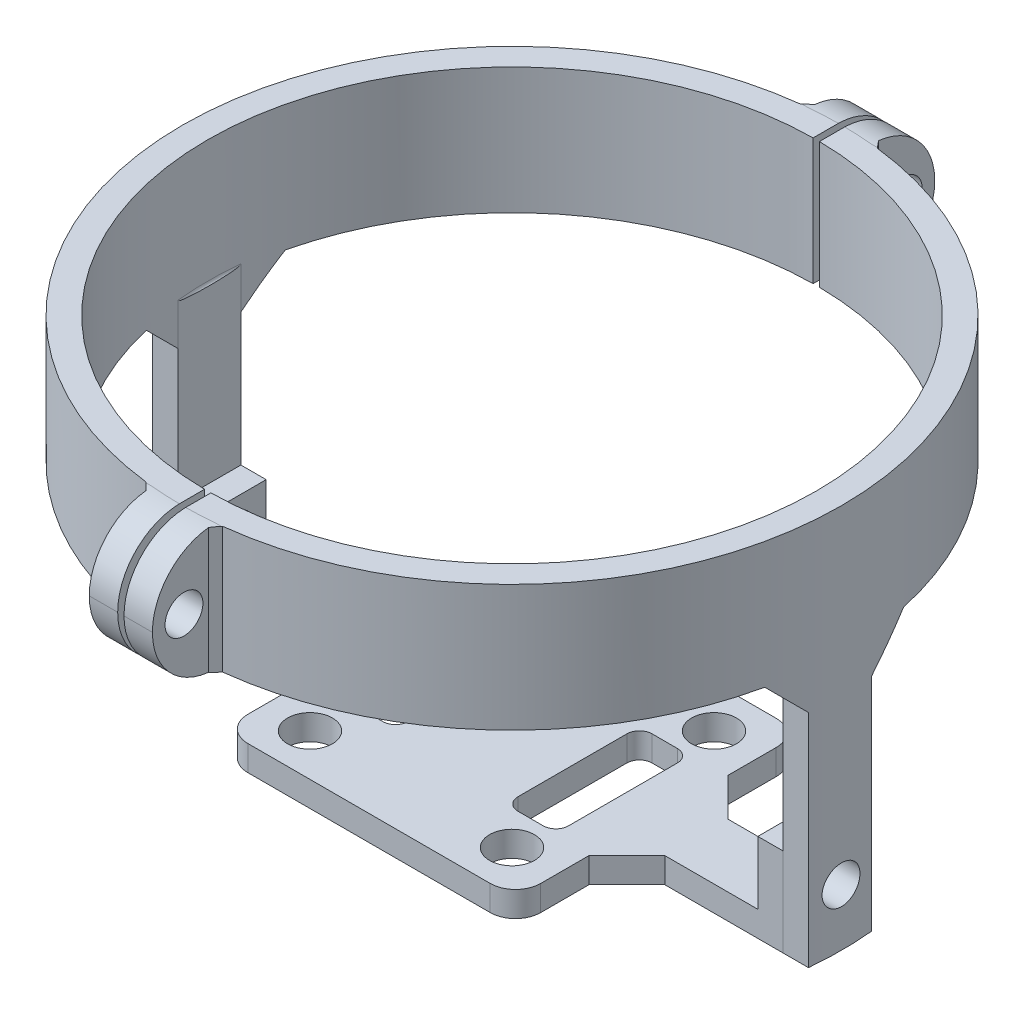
ISO-10303-21;
HEADER;
FILE_DESCRIPTION(('STEP AP214'),'2;1');
FILE_NAME('part.step','',(''),(''),'','','');
FILE_SCHEMA(('AUTOMOTIVE_DESIGN { 1 0 10303 214 1 1 1 1 }'));
ENDSEC;
DATA;
#1=APPLICATION_CONTEXT('core data for automotive mechanical design processes');
#2=APPLICATION_PROTOCOL_DEFINITION('international standard','automotive_design',2000,#1);
#3=PRODUCT_CONTEXT('',#1,'mechanical');
#4=PRODUCT('Part','Part','',(#3));
#5=PRODUCT_RELATED_PRODUCT_CATEGORY('part','',(#4));
#6=PRODUCT_DEFINITION_FORMATION('','',#4);
#7=PRODUCT_DEFINITION_CONTEXT('part definition',#1,'design');
#8=PRODUCT_DEFINITION('design','',#6,#7);
#9=PRODUCT_DEFINITION_SHAPE('','',#8);
#10=(LENGTH_UNIT() NAMED_UNIT(*) SI_UNIT(.MILLI.,.METRE.));
#11=(NAMED_UNIT(*) PLANE_ANGLE_UNIT() SI_UNIT($,.RADIAN.));
#12=(NAMED_UNIT(*) SI_UNIT($,.STERADIAN.) SOLID_ANGLE_UNIT());
#13=UNCERTAINTY_MEASURE_WITH_UNIT(LENGTH_MEASURE(1.E-05),#10,'distance_accuracy_value','');
#14=(GEOMETRIC_REPRESENTATION_CONTEXT(3) GLOBAL_UNCERTAINTY_ASSIGNED_CONTEXT((#13)) GLOBAL_UNIT_ASSIGNED_CONTEXT((#10,
#11,#12)) REPRESENTATION_CONTEXT('',''));
#15=CARTESIAN_POINT('',(0.,0.,0.));
#16=DIRECTION('',(0.,0.,1.));
#17=DIRECTION('',(1.,0.,0.));
#18=AXIS2_PLACEMENT_3D('',#15,#16,#17);
#19=CARTESIAN_POINT('',(-2.5,5.,-25.9799923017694));
#20=DIRECTION('',(-1.,0.,0.));
#21=DIRECTION('',(0.,0.,1.));
#22=AXIS2_PLACEMENT_3D('',#19,#20,#21);
#23=CYLINDRICAL_SURFACE('',#22,5.);
#24=CARTESIAN_POINT('',(-0.249999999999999,5.,-25.9799923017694));
#25=DIRECTION('',(-1.,0.,0.));
#26=DIRECTION('',(0.,-1.,0.));
#27=AXIS2_PLACEMENT_3D('',#24,#25,#26);
#28=CIRCLE('',#27,5.);
#29=CARTESIAN_POINT('',(-0.250000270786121,0.000708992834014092,-26.099068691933));
#30=VERTEX_POINT('',#29);
#31=CARTESIAN_POINT('',(-0.249999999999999,5.,-30.9799923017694));
#32=VERTEX_POINT('',#31);
#33=EDGE_CURVE('E203',#30,#32,#28,.F.);
#34=ORIENTED_EDGE('',*,*,#33,.F.);
#35=CARTESIAN_POINT('',(-2.50000000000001,0.,-25.9799923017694));
#36=CARTESIAN_POINT('',(0.,0.,-26.2205620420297));
#37=CARTESIAN_POINT('',(2.5,0.,-25.9799923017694));
#38=B_SPLINE_CURVE_WITH_KNOTS('',2,(#35,#36,#37),.UNSPECIFIED.,.F.,.F.,(3,3),(0.,1.),.UNSPECIFIED.);
#39=CARTESIAN_POINT('',(-2.50000000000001,0.,-25.9799923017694));
#40=VERTEX_POINT('',#39);
#41=EDGE_CURVE('E434',#40,#30,#38,.T.);
#42=ORIENTED_EDGE('',*,*,#41,.F.);
#43=DIRECTION('',(-1.,0.,0.));
#44=VECTOR('',#43,1.);
#45=CARTESIAN_POINT('',(0.,0.,-25.9799923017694));
#46=LINE('',#45,#44);
#47=CARTESIAN_POINT('',(-3.00000000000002,0.,-25.9799923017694));
#48=VERTEX_POINT('',#47);
#49=EDGE_CURVE('E331',#48,#40,#46,.F.);
#50=ORIENTED_EDGE('',*,*,#49,.F.);
#51=CARTESIAN_POINT('',(-3.00000000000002,5.,-25.9799923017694));
#52=DIRECTION('',(-0.707106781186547,0.,-0.707106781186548));
#53=DIRECTION('',(-0.707106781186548,0.,0.707106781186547));
#54=AXIS2_PLACEMENT_3D('',#51,#52,#53);
#55=ELLIPSE('',#54,7.07106781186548,5.);
#56=CARTESIAN_POINT('',(-2.5,0.0250628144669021,-26.4799923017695));
#57=VERTEX_POINT('',#56);
#58=EDGE_CURVE('E338',#48,#57,#55,.F.);
#59=ORIENTED_EDGE('',*,*,#58,.T.);
#60=CARTESIAN_POINT('',(-2.5,5.,-25.9799923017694));
#61=DIRECTION('',(1.,0.,0.));
#62=DIRECTION('',(0.,0.,-1.));
#63=AXIS2_PLACEMENT_3D('',#60,#61,#62);
#64=CIRCLE('',#63,5.);
#65=CARTESIAN_POINT('',(-2.5,5.,-30.9799923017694));
#66=VERTEX_POINT('',#65);
#67=EDGE_CURVE('E519',#66,#57,#64,.F.);
#68=ORIENTED_EDGE('',*,*,#67,.F.);
#69=DIRECTION('',(-1.,0.,0.));
#70=VECTOR('',#69,1.);
#71=CARTESIAN_POINT('',(-2.5,5.,-30.9799923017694));
#72=LINE('',#71,#70);
#73=EDGE_CURVE('E336',#32,#66,#72,.T.);
#74=ORIENTED_EDGE('',*,*,#73,.F.);
#75=EDGE_LOOP('',(#34,#42,#50,#59,#68,#74));
#76=FACE_BOUND('',#75,.T.);
#77=ADVANCED_FACE('F60',(#76),#23,.T.);
#78=CARTESIAN_POINT('',(0.,5.,-25.9799923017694));
#79=DIRECTION('',(1.,0.,0.));
#80=DIRECTION('',(0.,0.,-1.));
#81=AXIS2_PLACEMENT_3D('',#78,#79,#80);
#82=CYLINDRICAL_SURFACE('',#81,5.);
#83=CARTESIAN_POINT('',(-0.249999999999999,5.,-25.9799923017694));
#84=DIRECTION('',(-1.,0.,0.));
#85=DIRECTION('',(0.,-1.,0.));
#86=AXIS2_PLACEMENT_3D('',#83,#84,#85);
#87=CIRCLE('',#86,5.);
#88=CARTESIAN_POINT('',(-0.25000027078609,9.99929100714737,-26.0990686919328));
#89=VERTEX_POINT('',#88);
#90=EDGE_CURVE('E199',#32,#89,#87,.F.);
#91=ORIENTED_EDGE('',*,*,#90,.F.);
#92=ORIENTED_EDGE('',*,*,#73,.T.);
#93=CARTESIAN_POINT('',(-2.5,5.,-25.9799923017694));
#94=DIRECTION('',(1.,0.,0.));
#95=DIRECTION('',(0.,0.,-1.));
#96=AXIS2_PLACEMENT_3D('',#93,#94,#95);
#97=CIRCLE('',#96,5.);
#98=CARTESIAN_POINT('',(-2.5,9.9749371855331,-26.4799923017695));
#99=VERTEX_POINT('',#98);
#100=EDGE_CURVE('E403',#99,#66,#97,.F.);
#101=ORIENTED_EDGE('',*,*,#100,.F.);
#102=CARTESIAN_POINT('',(-3.00000000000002,5.,-25.9799923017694));
#103=DIRECTION('',(-0.707106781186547,0.,-0.707106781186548));
#104=DIRECTION('',(0.707106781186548,0.,-0.707106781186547));
#105=AXIS2_PLACEMENT_3D('',#102,#103,#104);
#106=ELLIPSE('',#105,7.07106781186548,5.);
#107=CARTESIAN_POINT('',(-3.00000000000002,10.,-25.9799923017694));
#108=VERTEX_POINT('',#107);
#109=EDGE_CURVE('E223',#99,#108,#106,.F.);
#110=ORIENTED_EDGE('',*,*,#109,.T.);
#111=DIRECTION('',(-1.,0.,0.));
#112=VECTOR('',#111,1.);
#113=CARTESIAN_POINT('',(-2.5,10.,-25.9799923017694));
#114=LINE('',#113,#112);
#115=CARTESIAN_POINT('',(-2.50000000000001,10.,-25.9799923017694));
#116=VERTEX_POINT('',#115);
#117=EDGE_CURVE('E221',#116,#108,#114,.T.);
#118=ORIENTED_EDGE('',*,*,#117,.F.);
#119=CARTESIAN_POINT('',(-2.49999999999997,10.,-25.9799923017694));
#120=CARTESIAN_POINT('',(-2.40629661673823,9.99999968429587,-25.989009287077));
#121=CARTESIAN_POINT('',(-2.31254485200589,9.99997559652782,-25.9975237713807));
#122=CARTESIAN_POINT('',(-2.12504124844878,9.99989396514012,-26.0135367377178));
#123=CARTESIAN_POINT('',(-2.03128948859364,9.99983645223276,-26.0210361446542));
#124=CARTESIAN_POINT('',(-1.84378588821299,9.99970206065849,-26.0350188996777));
#125=CARTESIAN_POINT('',(-1.75003410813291,9.99962519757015,-26.0415030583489));
#126=CARTESIAN_POINT('',(-1.56253049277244,9.9994638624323,-26.0534555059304));
#127=CARTESIAN_POINT('',(-1.46877870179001,9.99937939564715,-26.0589244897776));
#128=CARTESIAN_POINT('',(-1.28127507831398,9.99921288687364,-26.0688467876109));
#129=CARTESIAN_POINT('',(-1.18752327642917,9.99913084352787,-26.0733006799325));
#130=CARTESIAN_POINT('',(-1.00001964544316,9.9989772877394,-26.0811930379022));
#131=CARTESIAN_POINT('',(-0.906267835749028,9.99890577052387,-26.0846319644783));
#132=CARTESIAN_POINT('',(-0.718764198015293,9.99877965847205,-26.0904945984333));
#133=CARTESIAN_POINT('',(-0.625012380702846,9.9987250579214,-26.0929186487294));
#134=CARTESIAN_POINT('',(-0.437508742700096,9.99863681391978,-26.0967518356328));
#135=CARTESIAN_POINT('',(-0.34375692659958,9.99860316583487,-26.0981611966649));
#136=CARTESIAN_POINT('',(-0.250000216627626,9.99858201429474,-26.0990630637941));
#137=B_SPLINE_CURVE_WITH_KNOTS('',3,(#119,#120,#121,#122,#123,#124,#125,#126,#127,#128,#129,
#130,#131,#132,#133,#134,#135,#136),.UNSPECIFIED.,.F.,.F.,(4,2,2,2,2,2,2,2,4),(0.,
0.282407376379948,0.564555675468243,0.846477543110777,1.12820570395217,1.40977295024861,
1.69121213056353,1.97255613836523,2.25383790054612),.UNSPECIFIED.);
#138=EDGE_CURVE('E211',#116,#89,#137,.T.);
#139=ORIENTED_EDGE('',*,*,#138,.T.);
#140=EDGE_LOOP('',(#91,#92,#101,#110,#118,#139));
#141=FACE_BOUND('',#140,.T.);
#142=ADVANCED_FACE('F219',(#141),#82,.T.);
#143=CARTESIAN_POINT('',(0.,0.,0.));
#144=DIRECTION('',(0.,1.,0.));
#145=DIRECTION('',(0.,0.,1.));
#146=AXIS2_PLACEMENT_3D('',#143,#144,#145);
#147=PLANE('',#146);
#148=CARTESIAN_POINT('',(0.,0.,0.));
#149=DIRECTION('',(0.,1.,0.));
#150=DIRECTION('',(0.,0.,1.));
#151=AXIS2_PLACEMENT_3D('',#148,#149,#150);
#152=CIRCLE('',#151,24.1);
#153=CARTESIAN_POINT('',(-23.4640150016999,0.,5.5));
#154=VERTEX_POINT('',#153);
#155=CARTESIAN_POINT('',(-0.249999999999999,0.,24.0987032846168));
#156=VERTEX_POINT('',#155);
#157=EDGE_CURVE('E222',#154,#156,#152,.T.);
#158=ORIENTED_EDGE('',*,*,#157,.T.);
#159=DIRECTION('',(0.,0.,1.));
#160=VECTOR('',#159,1.);
#161=CARTESIAN_POINT('',(-0.249999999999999,0.,-30.9799923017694));
#162=LINE('',#161,#160);
#163=CARTESIAN_POINT('',(-0.250000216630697,0.000708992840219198,26.099068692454));
#164=VERTEX_POINT('',#163);
#165=EDGE_CURVE('E334',#156,#164,#162,.T.);
#166=ORIENTED_EDGE('',*,*,#165,.T.);
#167=CARTESIAN_POINT('',(2.5,0.,25.9799923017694));
#168=CARTESIAN_POINT('',(0.,0.,26.2205620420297));
#169=CARTESIAN_POINT('',(-2.50000000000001,0.,25.9799923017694));
#170=B_SPLINE_CURVE_WITH_KNOTS('',2,(#167,#168,#169),.UNSPECIFIED.,.F.,.F.,(3,3),(0.,1.),.UNSPECIFIED.);
#171=CARTESIAN_POINT('',(-2.50000000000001,0.,25.9799923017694));
#172=VERTEX_POINT('',#171);
#173=EDGE_CURVE('E422',#164,#172,#170,.T.);
#174=ORIENTED_EDGE('',*,*,#173,.T.);
#175=DIRECTION('',(-1.,0.,0.));
#176=VECTOR('',#175,1.);
#177=CARTESIAN_POINT('',(0.,0.,25.9799923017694));
#178=LINE('',#177,#176);
#179=CARTESIAN_POINT('',(-3.00000000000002,0.,25.9799923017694));
#180=VERTEX_POINT('',#179);
#181=EDGE_CURVE('E388',#180,#172,#178,.F.);
#182=ORIENTED_EDGE('',*,*,#181,.F.);
#183=DIRECTION('',(-0.707106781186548,0.,-0.707106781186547));
#184=VECTOR('',#183,1.);
#185=CARTESIAN_POINT('',(-14.4899961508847,0.,14.4899961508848));
#186=LINE('',#185,#184);
#187=CARTESIAN_POINT('',(-3.05999127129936,0.,25.9200010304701));
#188=VERTEX_POINT('',#187);
#189=EDGE_CURVE('E406',#188,#180,#186,.F.);
#190=ORIENTED_EDGE('',*,*,#189,.F.);
#191=CARTESIAN_POINT('',(0.,0.,0.));
#192=DIRECTION('',(0.,1.,0.));
#193=DIRECTION('',(0.,0.,1.));
#194=AXIS2_PLACEMENT_3D('',#191,#192,#193);
#195=CIRCLE('',#194,26.1);
#196=CARTESIAN_POINT('',(-25.5139177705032,0.,5.5));
#197=VERTEX_POINT('',#196);
#198=EDGE_CURVE('E324',#197,#188,#195,.T.);
#199=ORIENTED_EDGE('',*,*,#198,.F.);
#200=DIRECTION('',(1.,0.,0.));
#201=VECTOR('',#200,1.);
#202=CARTESIAN_POINT('',(-23.9699812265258,0.,5.5));
#203=LINE('',#202,#201);
#204=EDGE_CURVE('E433',#197,#154,#203,.T.);
#205=ORIENTED_EDGE('',*,*,#204,.T.);
#206=EDGE_LOOP('',(#158,#166,#174,#182,#190,#199,#205));
#207=FACE_BOUND('',#206,.T.);
#208=ADVANCED_FACE('F251',(#207),#147,.F.);
#209=ORIENTED_EDGE('',*,*,#41,.T.);
#210=CARTESIAN_POINT('',(-0.249999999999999,0.,-24.0987032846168));
#211=VERTEX_POINT('',#210);
#212=EDGE_CURVE('E76',#30,#211,#162,.T.);
#213=ORIENTED_EDGE('',*,*,#212,.T.);
#214=CARTESIAN_POINT('',(-23.4640150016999,0.,-5.5));
#215=VERTEX_POINT('',#214);
#216=EDGE_CURVE('E335',#211,#215,#152,.T.);
#217=ORIENTED_EDGE('',*,*,#216,.T.);
#218=DIRECTION('',(-1.,0.,0.));
#219=VECTOR('',#218,1.);
#220=CARTESIAN_POINT('',(-25.9799923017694,0.,-5.5));
#221=LINE('',#220,#219);
#222=CARTESIAN_POINT('',(-25.5139177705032,0.,-5.5));
#223=VERTEX_POINT('',#222);
#224=EDGE_CURVE('E437',#215,#223,#221,.T.);
#225=ORIENTED_EDGE('',*,*,#224,.T.);
#226=CARTESIAN_POINT('',(-3.05999127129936,0.,-25.9200010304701));
#227=VERTEX_POINT('',#226);
#228=EDGE_CURVE('E328',#227,#223,#195,.T.);
#229=ORIENTED_EDGE('',*,*,#228,.F.);
#230=DIRECTION('',(-0.707106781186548,0.,0.707106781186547));
#231=VECTOR('',#230,1.);
#232=CARTESIAN_POINT('',(-14.4899961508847,0.,-14.4899961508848));
#233=LINE('',#232,#231);
#234=EDGE_CURVE('E383',#227,#48,#233,.F.);
#235=ORIENTED_EDGE('',*,*,#234,.T.);
#236=ORIENTED_EDGE('',*,*,#49,.T.);
#237=EDGE_LOOP('',(#209,#213,#217,#225,#229,#235,#236));
#238=FACE_BOUND('',#237,.T.);
#239=ADVANCED_FACE('F706',(#238),#147,.F.);
#240=CARTESIAN_POINT('',(0.,10.,0.));
#241=DIRECTION('',(0.,-1.,0.));
#242=DIRECTION('',(0.,0.,-1.));
#243=AXIS2_PLACEMENT_3D('',#240,#241,#242);
#244=CYLINDRICAL_SURFACE('',#243,24.1);
#245=DIRECTION('',(0.,-1.,0.));
#246=VECTOR('',#245,1.);
#247=CARTESIAN_POINT('',(-0.25,10.,-24.0987032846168));
#248=LINE('',#247,#246);
#249=CARTESIAN_POINT('',(-0.25,10.,-24.0987032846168));
#250=VERTEX_POINT('',#249);
#251=EDGE_CURVE('E13',#250,#211,#248,.T.);
#252=ORIENTED_EDGE('',*,*,#251,.F.);
#253=CARTESIAN_POINT('',(0.,10.,0.));
#254=DIRECTION('',(0.,1.,0.));
#255=DIRECTION('',(0.,0.,1.));
#256=AXIS2_PLACEMENT_3D('',#253,#254,#255);
#257=CIRCLE('',#256,24.1);
#258=CARTESIAN_POINT('',(-0.25,10.,24.0987032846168));
#259=VERTEX_POINT('',#258);
#260=EDGE_CURVE('E216',#250,#259,#257,.T.);
#261=ORIENTED_EDGE('',*,*,#260,.T.);
#262=DIRECTION('',(0.,-1.,0.));
#263=VECTOR('',#262,1.);
#264=CARTESIAN_POINT('',(-0.25,10.,24.0987032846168));
#265=LINE('',#264,#263);
#266=EDGE_CURVE('E297',#156,#259,#265,.F.);
#267=ORIENTED_EDGE('',*,*,#266,.F.);
#268=ORIENTED_EDGE('',*,*,#157,.F.);
#269=CARTESIAN_POINT('',(0.,-5.50000000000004,0.));
#270=DIRECTION('',(0.,-0.707106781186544,0.707106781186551));
#271=DIRECTION('',(0.,-0.707106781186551,-0.707106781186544));
#272=AXIS2_PLACEMENT_3D('',#269,#270,#271);
#273=ELLIPSE('',#272,34.0825468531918,24.1);
#274=CARTESIAN_POINT('',(-23.9699812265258,-3.00000000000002,2.5));
#275=VERTEX_POINT('',#274);
#276=EDGE_CURVE('E330',#154,#275,#273,.T.);
#277=ORIENTED_EDGE('',*,*,#276,.T.);
#278=DIRECTION('',(0.,-1.,0.));
#279=VECTOR('',#278,1.);
#280=CARTESIAN_POINT('',(-23.9699812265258,0.,2.5));
#281=LINE('',#280,#279);
#282=CARTESIAN_POINT('',(-23.9699812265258,0.3,2.50000000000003));
#283=VERTEX_POINT('',#282);
#284=EDGE_CURVE('E466',#275,#283,#281,.F.);
#285=ORIENTED_EDGE('',*,*,#284,.T.);
#286=CARTESIAN_POINT('',(0.,0.3,0.));
#287=DIRECTION('',(0.,-1.,0.));
#288=DIRECTION('',(0.,0.,-1.));
#289=AXIS2_PLACEMENT_3D('',#286,#287,#288);
#290=CIRCLE('',#289,24.1);
#291=CARTESIAN_POINT('',(-23.9699812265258,0.3,-2.50000000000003));
#292=VERTEX_POINT('',#291);
#293=EDGE_CURVE('E771',#283,#292,#290,.T.);
#294=ORIENTED_EDGE('',*,*,#293,.T.);
#295=DIRECTION('',(0.,-1.,0.));
#296=VECTOR('',#295,1.);
#297=CARTESIAN_POINT('',(-23.9699812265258,0.3,-2.50000000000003));
#298=LINE('',#297,#296);
#299=CARTESIAN_POINT('',(-23.9699812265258,-3.00000000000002,-2.50000000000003));
#300=VERTEX_POINT('',#299);
#301=EDGE_CURVE('E532',#292,#300,#298,.T.);
#302=ORIENTED_EDGE('',*,*,#301,.T.);
#303=CARTESIAN_POINT('',(0.,-5.50000000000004,0.));
#304=DIRECTION('',(0.,-0.707106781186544,-0.707106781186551));
#305=DIRECTION('',(0.,-0.707106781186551,0.707106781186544));
#306=AXIS2_PLACEMENT_3D('',#303,#304,#305);
#307=ELLIPSE('',#306,34.0825468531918,24.1);
#308=EDGE_CURVE('E529',#300,#215,#307,.T.);
#309=ORIENTED_EDGE('',*,*,#308,.T.);
#310=ORIENTED_EDGE('',*,*,#216,.F.);
#311=EDGE_LOOP('',(#252,#261,#267,#268,#277,#285,#294,#302,#309,#310));
#312=FACE_BOUND('',#311,.T.);
#313=ADVANCED_FACE('F362',(#312),#244,.F.);
#314=CARTESIAN_POINT('',(0.,10.,0.));
#315=DIRECTION('',(0.,1.,0.));
#316=DIRECTION('',(0.,0.,1.));
#317=AXIS2_PLACEMENT_3D('',#314,#315,#316);
#318=PLANE('',#317);
#319=DIRECTION('',(0.,0.,1.));
#320=VECTOR('',#319,1.);
#321=CARTESIAN_POINT('',(-0.25,10.,-30.9799923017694));
#322=LINE('',#321,#320);
#323=EDGE_CURVE('E69',#89,#250,#322,.T.);
#324=ORIENTED_EDGE('',*,*,#323,.F.);
#325=ORIENTED_EDGE('',*,*,#138,.F.);
#326=ORIENTED_EDGE('',*,*,#117,.T.);
#327=DIRECTION('',(0.707106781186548,0.,-0.707106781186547));
#328=VECTOR('',#327,1.);
#329=CARTESIAN_POINT('',(-3.05999127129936,10.,-25.9200010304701));
#330=LINE('',#329,#328);
#331=CARTESIAN_POINT('',(-3.05999127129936,10.,-25.9200010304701));
#332=VERTEX_POINT('',#331);
#333=EDGE_CURVE('E229',#108,#332,#330,.F.);
#334=ORIENTED_EDGE('',*,*,#333,.T.);
#335=CARTESIAN_POINT('',(0.,10.,0.));
#336=DIRECTION('',(0.,1.,0.));
#337=DIRECTION('',(0.,0.,1.));
#338=AXIS2_PLACEMENT_3D('',#335,#336,#337);
#339=CIRCLE('',#338,26.1);
#340=CARTESIAN_POINT('',(-3.05999127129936,10.,25.9200010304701));
#341=VERTEX_POINT('',#340);
#342=EDGE_CURVE('E320',#332,#341,#339,.T.);
#343=ORIENTED_EDGE('',*,*,#342,.T.);
#344=DIRECTION('',(0.707106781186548,0.,0.707106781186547));
#345=VECTOR('',#344,1.);
#346=CARTESIAN_POINT('',(-3.05999127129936,10.,25.9200010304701));
#347=LINE('',#346,#345);
#348=CARTESIAN_POINT('',(-3.00000000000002,10.,25.9799923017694));
#349=VERTEX_POINT('',#348);
#350=EDGE_CURVE('E396',#349,#341,#347,.F.);
#351=ORIENTED_EDGE('',*,*,#350,.F.);
#352=DIRECTION('',(-1.,0.,0.));
#353=VECTOR('',#352,1.);
#354=CARTESIAN_POINT('',(-2.5,10.,25.9799923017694));
#355=LINE('',#354,#353);
#356=CARTESIAN_POINT('',(-2.50000000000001,10.,25.9799923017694));
#357=VERTEX_POINT('',#356);
#358=EDGE_CURVE('E392',#357,#349,#355,.T.);
#359=ORIENTED_EDGE('',*,*,#358,.F.);
#360=CARTESIAN_POINT('',(-2.50000000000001,10.,25.9799923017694));
#361=CARTESIAN_POINT('',(0.,10.,26.2205620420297));
#362=CARTESIAN_POINT('',(2.5,10.,25.9799923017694));
#363=B_SPLINE_CURVE_WITH_KNOTS('',2,(#360,#361,#362),.UNSPECIFIED.,.F.,.F.,(3,3),(0.,1.),.UNSPECIFIED.);
#364=CARTESIAN_POINT('',(-0.250000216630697,9.99929100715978,26.099068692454));
#365=VERTEX_POINT('',#364);
#366=EDGE_CURVE('E305',#357,#365,#363,.T.);
#367=ORIENTED_EDGE('',*,*,#366,.T.);
#368=EDGE_CURVE('E299',#259,#365,#322,.T.);
#369=ORIENTED_EDGE('',*,*,#368,.F.);
#370=ORIENTED_EDGE('',*,*,#260,.F.);
#371=EDGE_LOOP('',(#324,#325,#326,#334,#343,#351,#359,#367,#369,#370));
#372=FACE_BOUND('',#371,.T.);
#373=ADVANCED_FACE('F210',(#372),#318,.T.);
#374=CARTESIAN_POINT('',(26.1,5.,-28.4799923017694));
#375=DIRECTION('',(-1.,0.,0.));
#376=DIRECTION('',(0.,0.,1.));
#377=AXIS2_PLACEMENT_3D('',#374,#375,#376);
#378=CYLINDRICAL_SURFACE('',#377,1.5);
#379=CARTESIAN_POINT('',(-0.25,5.,-28.4799923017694));
#380=DIRECTION('',(-1.,0.,0.));
#381=DIRECTION('',(0.,-1.,0.));
#382=AXIS2_PLACEMENT_3D('',#379,#380,#381);
#383=CIRCLE('',#382,1.5);
#384=CARTESIAN_POINT('',(-0.249999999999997,5.,-26.9799923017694));
#385=VERTEX_POINT('',#384);
#386=EDGE_CURVE('E301',#385,#385,#383,.F.);
#387=CARTESIAN_POINT('',(-2.5,5.,-28.4799923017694));
#388=DIRECTION('',(1.,0.,0.));
#389=DIRECTION('',(0.,0.,-1.));
#390=AXIS2_PLACEMENT_3D('',#387,#388,#389);
#391=CIRCLE('',#390,1.5);
#392=CARTESIAN_POINT('',(-2.5,5.,-26.9799923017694));
#393=VERTEX_POINT('',#392);
#394=EDGE_CURVE('E393',#393,#393,#391,.T.);
#395=CARTESIAN_POINT('',(-0.249999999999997,5.,-26.9799923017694));
#396=CARTESIAN_POINT('',(-0.273437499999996,5.,-26.9799923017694));
#397=CARTESIAN_POINT('',(-0.296874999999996,5.,-26.9799923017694));
#398=CARTESIAN_POINT('',(-0.343749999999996,5.,-26.9799923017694));
#399=CARTESIAN_POINT('',(-0.367187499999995,5.,-26.9799923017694));
#400=CARTESIAN_POINT('',(-0.414062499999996,5.,-26.9799923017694));
#401=CARTESIAN_POINT('',(-0.437499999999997,5.,-26.9799923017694));
#402=CARTESIAN_POINT('',(-0.484374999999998,5.,-26.9799923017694));
#403=CARTESIAN_POINT('',(-0.507812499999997,5.,-26.9799923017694));
#404=CARTESIAN_POINT('',(-0.554687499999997,5.,-26.9799923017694));
#405=CARTESIAN_POINT('',(-0.578124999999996,5.,-26.9799923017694));
#406=CARTESIAN_POINT('',(-0.624999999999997,5.,-26.9799923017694));
#407=CARTESIAN_POINT('',(-0.648437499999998,5.,-26.9799923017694));
#408=CARTESIAN_POINT('',(-0.695312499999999,5.,-26.9799923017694));
#409=CARTESIAN_POINT('',(-0.718749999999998,5.,-26.9799923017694));
#410=CARTESIAN_POINT('',(-0.765624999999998,5.,-26.9799923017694));
#411=CARTESIAN_POINT('',(-0.789062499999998,5.,-26.9799923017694));
#412=CARTESIAN_POINT('',(-0.835937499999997,5.,-26.9799923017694));
#413=CARTESIAN_POINT('',(-0.859374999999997,5.,-26.9799923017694));
#414=CARTESIAN_POINT('',(-0.906249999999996,5.,-26.9799923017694));
#415=CARTESIAN_POINT('',(-0.929687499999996,5.,-26.9799923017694));
#416=CARTESIAN_POINT('',(-0.976562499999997,5.,-26.9799923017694));
#417=CARTESIAN_POINT('',(-0.999999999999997,5.,-26.9799923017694));
#418=CARTESIAN_POINT('',(-1.046875,5.,-26.9799923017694));
#419=CARTESIAN_POINT('',(-1.0703125,5.,-26.9799923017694));
#420=CARTESIAN_POINT('',(-1.1171875,5.,-26.9799923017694));
#421=CARTESIAN_POINT('',(-1.140625,5.,-26.9799923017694));
#422=CARTESIAN_POINT('',(-1.1875,5.,-26.9799923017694));
#423=CARTESIAN_POINT('',(-1.2109375,5.,-26.9799923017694));
#424=CARTESIAN_POINT('',(-1.2578125,5.,-26.9799923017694));
#425=CARTESIAN_POINT('',(-1.28125,5.,-26.9799923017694));
#426=CARTESIAN_POINT('',(-1.328125,5.,-26.9799923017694));
#427=CARTESIAN_POINT('',(-1.3515625,5.,-26.9799923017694));
#428=CARTESIAN_POINT('',(-1.3984375,5.,-26.9799923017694));
#429=CARTESIAN_POINT('',(-1.421875,5.,-26.9799923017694));
#430=CARTESIAN_POINT('',(-1.46875,5.,-26.9799923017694));
#431=CARTESIAN_POINT('',(-1.4921875,5.,-26.9799923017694));
#432=CARTESIAN_POINT('',(-1.5390625,5.,-26.9799923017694));
#433=CARTESIAN_POINT('',(-1.5625,5.,-26.9799923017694));
#434=CARTESIAN_POINT('',(-1.609375,5.,-26.9799923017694));
#435=CARTESIAN_POINT('',(-1.6328125,5.,-26.9799923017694));
#436=CARTESIAN_POINT('',(-1.6796875,5.,-26.9799923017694));
#437=CARTESIAN_POINT('',(-1.703125,5.,-26.9799923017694));
#438=CARTESIAN_POINT('',(-1.75,5.,-26.9799923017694));
#439=CARTESIAN_POINT('',(-1.7734375,5.,-26.9799923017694));
#440=CARTESIAN_POINT('',(-1.8203125,5.,-26.9799923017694));
#441=CARTESIAN_POINT('',(-1.84375,5.,-26.9799923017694));
#442=CARTESIAN_POINT('',(-1.890625,5.,-26.9799923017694));
#443=CARTESIAN_POINT('',(-1.9140625,5.,-26.9799923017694));
#444=CARTESIAN_POINT('',(-1.9609375,5.,-26.9799923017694));
#445=CARTESIAN_POINT('',(-1.984375,5.,-26.9799923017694));
#446=CARTESIAN_POINT('',(-2.03125,5.,-26.9799923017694));
#447=CARTESIAN_POINT('',(-2.0546875,5.,-26.9799923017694));
#448=CARTESIAN_POINT('',(-2.1015625,5.,-26.9799923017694));
#449=CARTESIAN_POINT('',(-2.125,5.,-26.9799923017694));
#450=CARTESIAN_POINT('',(-2.171875,5.,-26.9799923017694));
#451=CARTESIAN_POINT('',(-2.1953125,5.,-26.9799923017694));
#452=CARTESIAN_POINT('',(-2.2421875,5.,-26.9799923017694));
#453=CARTESIAN_POINT('',(-2.265625,5.,-26.9799923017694));
#454=CARTESIAN_POINT('',(-2.3125,5.,-26.9799923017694));
#455=CARTESIAN_POINT('',(-2.3359375,5.,-26.9799923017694));
#456=CARTESIAN_POINT('',(-2.3828125,5.,-26.9799923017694));
#457=CARTESIAN_POINT('',(-2.40625,5.,-26.9799923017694));
#458=CARTESIAN_POINT('',(-2.453125,5.,-26.9799923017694));
#459=CARTESIAN_POINT('',(-2.4765625,5.,-26.9799923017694));
#460=CARTESIAN_POINT('',(-2.5,5.,-26.9799923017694));
#461=B_SPLINE_CURVE_WITH_KNOTS('',3,(#395,#396,#397,#398,#399,#400,#401,#402,#403,#404,#405,
#406,#407,#408,#409,#410,#411,#412,#413,#414,#415,#416,#417,#418,#419,#420,#421,#422,#423,#424,
#425,#426,#427,#428,#429,#430,#431,#432,#433,#434,#435,#436,#437,#438,#439,#440,#441,#442,#443,
#444,#445,#446,#447,#448,#449,#450,#451,#452,#453,#454,#455,#456,#457,#458,#459,#460),
.UNSPECIFIED.,.F.,.F.,(4,2,2,2,2,2,2,2,2,2,2,2,2,2,2,2,2,2,2,2,2,2,2,2,2,2,2,2,2,2,2,2,4),(0.,
0.0703124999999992,0.140624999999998,0.210937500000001,0.28125,0.351562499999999,
0.421875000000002,0.492187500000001,0.5625,0.6328125,0.703124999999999,0.773437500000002,
0.843750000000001,0.9140625,0.984375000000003,1.0546875,1.125,1.1953125,1.265625,1.3359375,
1.40625,1.4765625,1.546875,1.6171875,1.6875,1.7578125,1.828125,1.8984375,1.96875,2.0390625,
2.109375,2.1796875,2.25),.UNSPECIFIED.);
#462=EDGE_CURVE('BSEAM62',#385,#393,#461,.T.);
#463=ORIENTED_EDGE('',*,*,#386,.T.);
#464=ORIENTED_EDGE('',*,*,#394,.F.);
#465=ORIENTED_EDGE('',*,*,#462,.T.);
#466=ORIENTED_EDGE('',*,*,#462,.F.);
#467=EDGE_LOOP('',(#463,#465,#464,#466));
#468=FACE_BOUND('',#467,.T.);
#469=ADVANCED_FACE('F62',(#468),#378,.F.);
#470=CARTESIAN_POINT('',(-2.5,5.,25.9799923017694));
#471=DIRECTION('',(-1.,0.,0.));
#472=DIRECTION('',(0.,0.,-1.));
#473=AXIS2_PLACEMENT_3D('',#470,#471,#472);
#474=CYLINDRICAL_SURFACE('',#473,5.);
#475=CARTESIAN_POINT('',(-0.249999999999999,5.,25.9799923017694));
#476=DIRECTION('',(-1.,0.,0.));
#477=DIRECTION('',(0.,-1.,0.));
#478=AXIS2_PLACEMENT_3D('',#475,#476,#477);
#479=CIRCLE('',#478,5.);
#480=CARTESIAN_POINT('',(-0.249999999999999,5.,30.9799923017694));
#481=VERTEX_POINT('',#480);
#482=EDGE_CURVE('E294',#481,#164,#479,.F.);
#483=ORIENTED_EDGE('',*,*,#482,.F.);
#484=DIRECTION('',(-1.,0.,0.));
#485=VECTOR('',#484,1.);
#486=CARTESIAN_POINT('',(-2.5,5.,30.9799923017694));
#487=LINE('',#486,#485);
#488=CARTESIAN_POINT('',(-2.5,5.,30.9799923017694));
#489=VERTEX_POINT('',#488);
#490=EDGE_CURVE('E304',#481,#489,#487,.T.);
#491=ORIENTED_EDGE('',*,*,#490,.T.);
#492=CARTESIAN_POINT('',(-2.5,5.,25.9799923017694));
#493=DIRECTION('',(-1.,0.,0.));
#494=DIRECTION('',(0.,0.,1.));
#495=AXIS2_PLACEMENT_3D('',#492,#493,#494);
#496=CIRCLE('',#495,5.);
#497=CARTESIAN_POINT('',(-2.5,0.0250628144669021,26.4799923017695));
#498=VERTEX_POINT('',#497);
#499=EDGE_CURVE('E289',#489,#498,#496,.F.);
#500=ORIENTED_EDGE('',*,*,#499,.T.);
#501=CARTESIAN_POINT('',(-3.00000000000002,5.,25.9799923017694));
#502=DIRECTION('',(0.707106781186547,0.,-0.707106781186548));
#503=DIRECTION('',(-0.707106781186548,0.,-0.707106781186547));
#504=AXIS2_PLACEMENT_3D('',#501,#502,#503);
#505=ELLIPSE('',#504,7.07106781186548,5.);
#506=EDGE_CURVE('E404',#180,#498,#505,.F.);
#507=ORIENTED_EDGE('',*,*,#506,.F.);
#508=ORIENTED_EDGE('',*,*,#181,.T.);
#509=ORIENTED_EDGE('',*,*,#173,.F.);
#510=EDGE_LOOP('',(#483,#491,#500,#507,#508,#509));
#511=FACE_BOUND('',#510,.T.);
#512=ADVANCED_FACE('F269',(#511),#474,.T.);
#513=CARTESIAN_POINT('',(0.,5.,25.9799923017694));
#514=DIRECTION('',(1.,0.,0.));
#515=DIRECTION('',(0.,0.,1.));
#516=AXIS2_PLACEMENT_3D('',#513,#514,#515);
#517=CYLINDRICAL_SURFACE('',#516,5.);
#518=CARTESIAN_POINT('',(-0.249999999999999,5.,25.9799923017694));
#519=DIRECTION('',(-1.,0.,0.));
#520=DIRECTION('',(0.,-1.,0.));
#521=AXIS2_PLACEMENT_3D('',#518,#519,#520);
#522=CIRCLE('',#521,5.);
#523=EDGE_CURVE('E309',#365,#481,#522,.F.);
#524=ORIENTED_EDGE('',*,*,#523,.F.);
#525=ORIENTED_EDGE('',*,*,#366,.F.);
#526=ORIENTED_EDGE('',*,*,#358,.T.);
#527=CARTESIAN_POINT('',(-3.00000000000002,5.,25.9799923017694));
#528=DIRECTION('',(0.707106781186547,0.,-0.707106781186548));
#529=DIRECTION('',(0.707106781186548,0.,0.707106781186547));
#530=AXIS2_PLACEMENT_3D('',#527,#528,#529);
#531=ELLIPSE('',#530,7.07106781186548,5.);
#532=CARTESIAN_POINT('',(-2.5,9.9749371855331,26.4799923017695));
#533=VERTEX_POINT('',#532);
#534=EDGE_CURVE('E400',#533,#349,#531,.F.);
#535=ORIENTED_EDGE('',*,*,#534,.F.);
#536=CARTESIAN_POINT('',(-2.5,5.,25.9799923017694));
#537=DIRECTION('',(-1.,0.,0.));
#538=DIRECTION('',(0.,0.,1.));
#539=AXIS2_PLACEMENT_3D('',#536,#537,#538);
#540=CIRCLE('',#539,5.);
#541=EDGE_CURVE('E285',#533,#489,#540,.F.);
#542=ORIENTED_EDGE('',*,*,#541,.T.);
#543=ORIENTED_EDGE('',*,*,#490,.F.);
#544=EDGE_LOOP('',(#524,#525,#526,#535,#542,#543));
#545=FACE_BOUND('',#544,.T.);
#546=ADVANCED_FACE('F260',(#545),#517,.T.);
#547=CARTESIAN_POINT('',(26.1,5.,28.4799923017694));
#548=DIRECTION('',(-1.,0.,0.));
#549=DIRECTION('',(0.,0.,-1.));
#550=AXIS2_PLACEMENT_3D('',#547,#548,#549);
#551=CYLINDRICAL_SURFACE('',#550,1.5);
#552=CARTESIAN_POINT('',(-0.25,5.,28.4799923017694));
#553=DIRECTION('',(-1.,0.,0.));
#554=DIRECTION('',(0.,-1.,0.));
#555=AXIS2_PLACEMENT_3D('',#552,#553,#554);
#556=CIRCLE('',#555,1.5);
#557=CARTESIAN_POINT('',(-0.249999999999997,5.,26.9799923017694));
#558=VERTEX_POINT('',#557);
#559=EDGE_CURVE('E275',#558,#558,#556,.F.);
#560=CARTESIAN_POINT('',(-2.5,5.,28.4799923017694));
#561=DIRECTION('',(-1.,0.,0.));
#562=DIRECTION('',(0.,0.,1.));
#563=AXIS2_PLACEMENT_3D('',#560,#561,#562);
#564=CIRCLE('',#563,1.5);
#565=CARTESIAN_POINT('',(-2.5,5.,26.9799923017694));
#566=VERTEX_POINT('',#565);
#567=EDGE_CURVE('E278',#566,#566,#564,.T.);
#568=CARTESIAN_POINT('',(-0.249999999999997,5.,26.9799923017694));
#569=CARTESIAN_POINT('',(-0.273437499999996,5.,26.9799923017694));
#570=CARTESIAN_POINT('',(-0.296874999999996,5.,26.9799923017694));
#571=CARTESIAN_POINT('',(-0.343749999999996,5.,26.9799923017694));
#572=CARTESIAN_POINT('',(-0.367187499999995,5.,26.9799923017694));
#573=CARTESIAN_POINT('',(-0.414062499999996,5.,26.9799923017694));
#574=CARTESIAN_POINT('',(-0.437499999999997,5.,26.9799923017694));
#575=CARTESIAN_POINT('',(-0.484374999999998,5.,26.9799923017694));
#576=CARTESIAN_POINT('',(-0.507812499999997,5.,26.9799923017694));
#577=CARTESIAN_POINT('',(-0.554687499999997,5.,26.9799923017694));
#578=CARTESIAN_POINT('',(-0.578124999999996,5.,26.9799923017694));
#579=CARTESIAN_POINT('',(-0.624999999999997,5.,26.9799923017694));
#580=CARTESIAN_POINT('',(-0.648437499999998,5.,26.9799923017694));
#581=CARTESIAN_POINT('',(-0.695312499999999,5.,26.9799923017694));
#582=CARTESIAN_POINT('',(-0.718749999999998,5.,26.9799923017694));
#583=CARTESIAN_POINT('',(-0.765624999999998,5.,26.9799923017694));
#584=CARTESIAN_POINT('',(-0.789062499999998,5.,26.9799923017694));
#585=CARTESIAN_POINT('',(-0.835937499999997,5.,26.9799923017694));
#586=CARTESIAN_POINT('',(-0.859374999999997,5.,26.9799923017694));
#587=CARTESIAN_POINT('',(-0.906249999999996,5.,26.9799923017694));
#588=CARTESIAN_POINT('',(-0.929687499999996,5.,26.9799923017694));
#589=CARTESIAN_POINT('',(-0.976562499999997,5.,26.9799923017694));
#590=CARTESIAN_POINT('',(-0.999999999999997,5.,26.9799923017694));
#591=CARTESIAN_POINT('',(-1.046875,5.,26.9799923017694));
#592=CARTESIAN_POINT('',(-1.0703125,5.,26.9799923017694));
#593=CARTESIAN_POINT('',(-1.1171875,5.,26.9799923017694));
#594=CARTESIAN_POINT('',(-1.140625,5.,26.9799923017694));
#595=CARTESIAN_POINT('',(-1.1875,5.,26.9799923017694));
#596=CARTESIAN_POINT('',(-1.2109375,5.,26.9799923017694));
#597=CARTESIAN_POINT('',(-1.2578125,5.,26.9799923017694));
#598=CARTESIAN_POINT('',(-1.28125,5.,26.9799923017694));
#599=CARTESIAN_POINT('',(-1.328125,5.,26.9799923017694));
#600=CARTESIAN_POINT('',(-1.3515625,5.,26.9799923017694));
#601=CARTESIAN_POINT('',(-1.3984375,5.,26.9799923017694));
#602=CARTESIAN_POINT('',(-1.421875,5.,26.9799923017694));
#603=CARTESIAN_POINT('',(-1.46875,5.,26.9799923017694));
#604=CARTESIAN_POINT('',(-1.4921875,5.,26.9799923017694));
#605=CARTESIAN_POINT('',(-1.5390625,5.,26.9799923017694));
#606=CARTESIAN_POINT('',(-1.5625,5.,26.9799923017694));
#607=CARTESIAN_POINT('',(-1.609375,5.,26.9799923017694));
#608=CARTESIAN_POINT('',(-1.6328125,5.,26.9799923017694));
#609=CARTESIAN_POINT('',(-1.6796875,5.,26.9799923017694));
#610=CARTESIAN_POINT('',(-1.703125,5.,26.9799923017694));
#611=CARTESIAN_POINT('',(-1.75,5.,26.9799923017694));
#612=CARTESIAN_POINT('',(-1.7734375,5.,26.9799923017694));
#613=CARTESIAN_POINT('',(-1.8203125,5.,26.9799923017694));
#614=CARTESIAN_POINT('',(-1.84375,5.,26.9799923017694));
#615=CARTESIAN_POINT('',(-1.890625,5.,26.9799923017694));
#616=CARTESIAN_POINT('',(-1.9140625,5.,26.9799923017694));
#617=CARTESIAN_POINT('',(-1.9609375,5.,26.9799923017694));
#618=CARTESIAN_POINT('',(-1.984375,5.,26.9799923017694));
#619=CARTESIAN_POINT('',(-2.03125,5.,26.9799923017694));
#620=CARTESIAN_POINT('',(-2.0546875,5.,26.9799923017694));
#621=CARTESIAN_POINT('',(-2.1015625,5.,26.9799923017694));
#622=CARTESIAN_POINT('',(-2.125,5.,26.9799923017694));
#623=CARTESIAN_POINT('',(-2.171875,5.,26.9799923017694));
#624=CARTESIAN_POINT('',(-2.1953125,5.,26.9799923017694));
#625=CARTESIAN_POINT('',(-2.2421875,5.,26.9799923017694));
#626=CARTESIAN_POINT('',(-2.265625,5.,26.9799923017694));
#627=CARTESIAN_POINT('',(-2.3125,5.,26.9799923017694));
#628=CARTESIAN_POINT('',(-2.3359375,5.,26.9799923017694));
#629=CARTESIAN_POINT('',(-2.3828125,5.,26.9799923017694));
#630=CARTESIAN_POINT('',(-2.40625,5.,26.9799923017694));
#631=CARTESIAN_POINT('',(-2.453125,5.,26.9799923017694));
#632=CARTESIAN_POINT('',(-2.4765625,5.,26.9799923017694));
#633=CARTESIAN_POINT('',(-2.5,5.,26.9799923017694));
#634=B_SPLINE_CURVE_WITH_KNOTS('',3,(#568,#569,#570,#571,#572,#573,#574,#575,#576,#577,#578,
#579,#580,#581,#582,#583,#584,#585,#586,#587,#588,#589,#590,#591,#592,#593,#594,#595,#596,#597,
#598,#599,#600,#601,#602,#603,#604,#605,#606,#607,#608,#609,#610,#611,#612,#613,#614,#615,#616,
#617,#618,#619,#620,#621,#622,#623,#624,#625,#626,#627,#628,#629,#630,#631,#632,#633),
.UNSPECIFIED.,.F.,.F.,(4,2,2,2,2,2,2,2,2,2,2,2,2,2,2,2,2,2,2,2,2,2,2,2,2,2,2,2,2,2,2,2,4),(0.,
0.0703124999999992,0.140624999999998,0.210937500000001,0.28125,0.351562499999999,
0.421875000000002,0.492187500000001,0.5625,0.6328125,0.703124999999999,0.773437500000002,
0.843750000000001,0.9140625,0.984375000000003,1.0546875,1.125,1.1953125,1.265625,1.3359375,
1.40625,1.4765625,1.546875,1.6171875,1.6875,1.7578125,1.828125,1.8984375,1.96875,2.0390625,
2.109375,2.1796875,2.25),.UNSPECIFIED.);
#635=EDGE_CURVE('BSEAM257',#558,#566,#634,.T.);
#636=ORIENTED_EDGE('',*,*,#559,.T.);
#637=ORIENTED_EDGE('',*,*,#567,.T.);
#638=ORIENTED_EDGE('',*,*,#635,.T.);
#639=ORIENTED_EDGE('',*,*,#635,.F.);
#640=EDGE_LOOP('',(#636,#638,#637,#639));
#641=FACE_BOUND('',#640,.T.);
#642=ADVANCED_FACE('F257',(#641),#551,.F.);
#643=CARTESIAN_POINT('',(0.,-25.9347934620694,0.));
#644=DIRECTION('',(0.,1.,0.));
#645=DIRECTION('',(0.,0.,1.));
#646=AXIS2_PLACEMENT_3D('',#643,#644,#645);
#647=CYLINDRICAL_SURFACE('',#646,26.1);
#648=CARTESIAN_POINT('',(-26.1,-14.5,0.));
#649=CARTESIAN_POINT('',(-26.0999994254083,-14.5000037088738,0.0841811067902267));
#650=CARTESIAN_POINT('',(-26.0995883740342,-14.5071102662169,0.168421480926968));
#651=CARTESIAN_POINT('',(-26.0979881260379,-14.53535825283,0.334577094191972));
#652=CARTESIAN_POINT('',(-26.0967980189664,-14.5565161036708,0.416489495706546));
#653=CARTESIAN_POINT('',(-26.0937743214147,-14.6122577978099,0.575558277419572));
#654=CARTESIAN_POINT('',(-26.0919410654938,-14.6468346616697,0.65271710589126));
#655=CARTESIAN_POINT('',(-26.0878373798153,-14.7284218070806,0.800115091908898));
#656=CARTESIAN_POINT('',(-26.0855670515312,-14.7754292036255,0.870355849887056));
#657=CARTESIAN_POINT('',(-26.0808412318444,-14.8806097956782,1.00203482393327));
#658=CARTESIAN_POINT('',(-26.0783855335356,-14.9387955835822,1.06346297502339));
#659=CARTESIAN_POINT('',(-26.0735675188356,-15.0646556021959,1.17568704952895));
#660=CARTESIAN_POINT('',(-26.0712052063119,-15.1323302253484,1.22648253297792));
#661=CARTESIAN_POINT('',(-26.0668388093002,-15.2753024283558,1.31602926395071));
#662=CARTESIAN_POINT('',(-26.0648349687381,-15.3506051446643,1.35477232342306));
#663=CARTESIAN_POINT('',(-26.061414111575,-15.5066599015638,1.41906199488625));
#664=CARTESIAN_POINT('',(-26.0599970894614,-15.587411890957,1.44460873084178));
#665=CARTESIAN_POINT('',(-26.057911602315,-15.7519774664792,1.48175310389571));
#666=CARTESIAN_POINT('',(-26.05724230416,-15.8357875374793,1.49336626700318));
#667=CARTESIAN_POINT('',(-26.0567252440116,-16.0041699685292,1.50236175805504));
#668=CARTESIAN_POINT('',(-26.0568774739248,-16.0887423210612,1.4997442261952));
#669=CARTESIAN_POINT('',(-26.0579855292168,-16.2561429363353,1.48036553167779));
#670=CARTESIAN_POINT('',(-26.058940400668,-16.3389731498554,1.46362115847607));
#671=CARTESIAN_POINT('',(-26.0615446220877,-16.5006452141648,1.41649012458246));
#672=CARTESIAN_POINT('',(-26.0631939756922,-16.5794870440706,1.38610339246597));
#673=CARTESIAN_POINT('',(-26.0670023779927,-16.730998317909,1.31253109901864));
#674=CARTESIAN_POINT('',(-26.0691617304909,-16.8036640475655,1.26933790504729));
#675=CARTESIAN_POINT('',(-26.0737464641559,-16.9407197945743,1.17138432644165));
#676=CARTESIAN_POINT('',(-26.0761718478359,-17.005109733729,1.11662383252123));
#677=CARTESIAN_POINT('',(-26.0810195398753,-17.1238838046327,0.996995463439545));
#678=CARTESIAN_POINT('',(-26.0834418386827,-17.1782532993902,0.932113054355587));
#679=CARTESIAN_POINT('',(-26.088006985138,-17.2753302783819,0.794133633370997));
#680=CARTESIAN_POINT('',(-26.0901498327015,-17.3180377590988,0.721036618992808));
#681=CARTESIAN_POINT('',(-26.0939147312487,-17.3905770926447,0.568694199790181));
#682=CARTESIAN_POINT('',(-26.0955367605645,-17.4204084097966,0.489448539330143));
#683=CARTESIAN_POINT('',(-26.0980769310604,-17.4663389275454,0.327062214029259));
#684=CARTESIAN_POINT('',(-26.0989950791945,-17.4824382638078,0.243921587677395));
#685=CARTESIAN_POINT('',(-26.1000231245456,-17.5004297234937,0.0762324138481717));
#686=CARTESIAN_POINT('',(-26.1001341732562,-17.5023420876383,-0.0083139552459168));
#687=CARTESIAN_POINT('',(-26.0995385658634,-17.4919581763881,-0.176526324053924));
#688=CARTESIAN_POINT('',(-26.0988319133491,-17.4796619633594,-0.260192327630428));
#689=CARTESIAN_POINT('',(-26.0966812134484,-17.4412266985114,-0.424212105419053));
#690=CARTESIAN_POINT('',(-26.0952376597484,-17.4150969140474,-0.504568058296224));
#691=CARTESIAN_POINT('',(-26.0917756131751,-17.3497456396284,-0.659753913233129));
#692=CARTESIAN_POINT('',(-26.0897571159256,-17.3105240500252,-0.734583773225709));
#693=CARTESIAN_POINT('',(-26.0853692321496,-17.2200508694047,-0.876686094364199));
#694=CARTESIAN_POINT('',(-26.0829994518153,-17.1687857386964,-0.943949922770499));
#695=CARTESIAN_POINT('',(-26.0781770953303,-17.0557004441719,-1.06892394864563));
#696=CARTESIAN_POINT('',(-26.0757245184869,-16.9938801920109,-1.12663406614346));
#697=CARTESIAN_POINT('',(-26.0710096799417,-16.8613522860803,-1.2309308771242));
#698=CARTESIAN_POINT('',(-26.0687476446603,-16.7906343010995,-1.27750445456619));
#699=CARTESIAN_POINT('',(-26.0646725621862,-16.642370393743,-1.35811644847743));
#700=CARTESIAN_POINT('',(-26.0628595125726,-16.5648245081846,-1.39215493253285));
#701=CARTESIAN_POINT('',(-26.0598884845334,-16.4051542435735,-1.44670773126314));
#702=CARTESIAN_POINT('',(-26.0587301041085,-16.3230327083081,-1.46723034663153));
#703=CARTESIAN_POINT('',(-26.0571979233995,-16.1565026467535,-1.49419597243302));
#704=CARTESIAN_POINT('',(-26.0568241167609,-16.0720941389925,-1.50063909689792));
#705=CARTESIAN_POINT('',(-26.0569033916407,-15.903516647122,-1.49926176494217));
#706=CARTESIAN_POINT('',(-26.057355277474,-15.819347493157,-1.49146193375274));
#707=CARTESIAN_POINT('',(-26.0590324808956,-15.6535159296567,-1.4618628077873));
#708=CARTESIAN_POINT('',(-26.0602577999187,-15.5718535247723,-1.44006348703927));
#709=CARTESIAN_POINT('',(-26.0633434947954,-15.4133499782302,-1.3830886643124));
#710=CARTESIAN_POINT('',(-26.0652038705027,-15.3365088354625,-1.34791316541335));
#711=CARTESIAN_POINT('',(-26.0693499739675,-15.1898207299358,-1.26518756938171));
#712=CARTESIAN_POINT('',(-26.0716356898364,-15.1199735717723,-1.21763781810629));
#713=CARTESIAN_POINT('',(-26.0763787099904,-14.9891520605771,-1.11143799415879));
#714=CARTESIAN_POINT('',(-26.0788362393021,-14.928189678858,-1.05277318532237));
#715=CARTESIAN_POINT('',(-26.0836441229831,-14.816958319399,-0.926025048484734));
#716=CARTESIAN_POINT('',(-26.0859944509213,-14.7666919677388,-0.857939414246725));
#717=CARTESIAN_POINT('',(-26.0903251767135,-14.6782483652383,-0.714215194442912));
#718=CARTESIAN_POINT('',(-26.0923051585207,-14.6400846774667,-0.638568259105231));
#719=CARTESIAN_POINT('',(-26.0956662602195,-14.5770461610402,-0.481984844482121));
#720=CARTESIAN_POINT('',(-26.0970480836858,-14.552155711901,-0.401054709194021));
#721=CARTESIAN_POINT('',(-26.0986936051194,-14.5228650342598,-0.26635510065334));
#722=CARTESIAN_POINT('',(-26.0991813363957,-14.5143016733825,-0.213457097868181));
#723=CARTESIAN_POINT('',(-26.0998347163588,-14.5028679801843,-0.107047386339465));
#724=CARTESIAN_POINT('',(-26.1000003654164,-14.4999976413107,-0.0535356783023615));
#725=CARTESIAN_POINT('',(-26.1,-14.5,0.));
#726=B_SPLINE_CURVE_WITH_KNOTS('',3,(#648,#649,#650,#651,#652,#653,#654,#655,#656,#657,#658,
#659,#660,#661,#662,#663,#664,#665,#666,#667,#668,#669,#670,#671,#672,#673,#674,#675,#676,#677,
#678,#679,#680,#681,#682,#683,#684,#685,#686,#687,#688,#689,#690,#691,#692,#693,#694,#695,#696,
#697,#698,#699,#700,#701,#702,#703,#704,#705,#706,#707,#708,#709,#710,#711,#712,#713,#714,#715,
#716,#717,#718,#719,#720,#721,#722,#723,#724,#725),.UNSPECIFIED.,.T.,.F.,(4,2,2,2,2,2,2,2,2,2,2,
2,2,2,2,2,2,2,2,2,2,2,2,2,2,2,2,2,2,2,2,2,2,2,2,2,2,2,4),(0.,0.252347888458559,
0.504991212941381,0.757503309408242,1.0099568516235,1.26269646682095,1.51544653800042,
1.76836794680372,2.02128697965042,2.27392392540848,2.52655838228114,2.7788930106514,
3.03122896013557,3.28371560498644,3.53620463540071,3.78905960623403,4.0419146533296,
4.29478021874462,4.54764328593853,4.80014552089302,5.05264664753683,5.30497883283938,
5.55731293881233,5.80993209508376,6.06255336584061,6.31547071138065,6.56838669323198,
6.82114720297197,7.07390566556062,7.32629839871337,7.5786916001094,7.83108474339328,
8.08347083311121,8.33619390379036,8.58897895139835,8.84204629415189,9.09481515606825,
9.25529808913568,9.41578083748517),.UNSPECIFIED.);
#727=CARTESIAN_POINT('',(-26.1,-14.5,0.));
#728=VERTEX_POINT('',#727);
#729=EDGE_CURVE('E280',#728,#728,#726,.T.);
#730=ORIENTED_EDGE('',*,*,#729,.T.);
#731=EDGE_LOOP('',(#730));
#732=FACE_BOUND('',#731,.T.);
#733=DIRECTION('',(0.,1.,0.));
#734=VECTOR('',#733,1.);
#735=CARTESIAN_POINT('',(-3.05999127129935,-25.9347934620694,25.9200010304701));
#736=LINE('',#735,#734);
#737=EDGE_CURVE('E399',#341,#188,#736,.F.);
#738=ORIENTED_EDGE('',*,*,#737,.F.);
#739=ORIENTED_EDGE('',*,*,#342,.F.);
#740=DIRECTION('',(0.,1.,0.));
#741=VECTOR('',#740,1.);
#742=CARTESIAN_POINT('',(-3.05999127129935,-25.9347934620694,-25.9200010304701));
#743=LINE('',#742,#741);
#744=EDGE_CURVE('E283',#332,#227,#743,.F.);
#745=ORIENTED_EDGE('',*,*,#744,.T.);
#746=ORIENTED_EDGE('',*,*,#228,.T.);
#747=CARTESIAN_POINT('',(0.,-5.50000000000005,0.));
#748=DIRECTION('',(0.,-0.707106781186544,-0.707106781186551));
#749=DIRECTION('',(0.,0.707106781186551,-0.707106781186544));
#750=AXIS2_PLACEMENT_3D('',#747,#748,#749);
#751=ELLIPSE('',#750,36.9109739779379,26.1);
#752=CARTESIAN_POINT('',(-25.9799923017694,-3.00000000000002,-2.5));
#753=VERTEX_POINT('',#752);
#754=EDGE_CURVE('E526',#223,#753,#751,.F.);
#755=ORIENTED_EDGE('',*,*,#754,.T.);
#756=DIRECTION('',(0.,1.,0.));
#757=VECTOR('',#756,1.);
#758=CARTESIAN_POINT('',(-25.9799923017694,-25.9347934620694,-2.5));
#759=LINE('',#758,#757);
#760=CARTESIAN_POINT('',(-25.9799923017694,-20.5,-2.5));
#761=VERTEX_POINT('',#760);
#762=EDGE_CURVE('E326',#761,#753,#759,.T.);
#763=ORIENTED_EDGE('',*,*,#762,.F.);
#764=CARTESIAN_POINT('',(0.,-20.5,0.));
#765=DIRECTION('',(0.,1.,0.));
#766=DIRECTION('',(0.,0.,1.));
#767=AXIS2_PLACEMENT_3D('',#764,#765,#766);
#768=CIRCLE('',#767,26.1);
#769=CARTESIAN_POINT('',(-25.9799923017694,-20.5,2.5));
#770=VERTEX_POINT('',#769);
#771=EDGE_CURVE('E528',#761,#770,#768,.T.);
#772=ORIENTED_EDGE('',*,*,#771,.T.);
#773=DIRECTION('',(0.,1.,0.));
#774=VECTOR('',#773,1.);
#775=CARTESIAN_POINT('',(-25.9799923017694,-25.9347934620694,2.5));
#776=LINE('',#775,#774);
#777=CARTESIAN_POINT('',(-25.9799923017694,-3.00000000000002,2.5));
#778=VERTEX_POINT('',#777);
#779=EDGE_CURVE('E534',#770,#778,#776,.T.);
#780=ORIENTED_EDGE('',*,*,#779,.T.);
#781=CARTESIAN_POINT('',(0.,-5.50000000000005,0.));
#782=DIRECTION('',(0.,-0.707106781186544,0.707106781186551));
#783=DIRECTION('',(0.,0.707106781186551,0.707106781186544));
#784=AXIS2_PLACEMENT_3D('',#781,#782,#783);
#785=ELLIPSE('',#784,36.9109739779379,26.1);
#786=EDGE_CURVE('E327',#778,#197,#785,.F.);
#787=ORIENTED_EDGE('',*,*,#786,.T.);
#788=ORIENTED_EDGE('',*,*,#198,.T.);
#789=EDGE_LOOP('',(#738,#739,#745,#746,#755,#763,#772,#780,#787,#788));
#790=FACE_BOUND('',#789,.T.);
#791=ADVANCED_FACE('F259',(#732,#790),#647,.T.);
#792=CARTESIAN_POINT('',(-23.9699812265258,-25.9347934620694,-2.5));
#793=DIRECTION('',(0.,0.,1.));
#794=DIRECTION('',(1.,0.,0.));
#795=AXIS2_PLACEMENT_3D('',#792,#793,#794);
#796=PLANE('',#795);
#797=ORIENTED_EDGE('',*,*,#762,.T.);
#798=DIRECTION('',(1.,0.,0.));
#799=VECTOR('',#798,1.);
#800=CARTESIAN_POINT('',(-23.9699812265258,-3.00000000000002,-2.5));
#801=LINE('',#800,#799);
#802=EDGE_CURVE('E443',#753,#300,#801,.T.);
#803=ORIENTED_EDGE('',*,*,#802,.T.);
#804=DIRECTION('',(0.,1.,0.));
#805=VECTOR('',#804,1.);
#806=CARTESIAN_POINT('',(-23.9699812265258,-25.9347934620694,-2.5));
#807=LINE('',#806,#805);
#808=CARTESIAN_POINT('',(-23.9699812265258,-20.5,-2.5));
#809=VERTEX_POINT('',#808);
#810=EDGE_CURVE('E465',#809,#300,#807,.T.);
#811=ORIENTED_EDGE('',*,*,#810,.F.);
#812=DIRECTION('',(-1.,0.,0.));
#813=VECTOR('',#812,1.);
#814=CARTESIAN_POINT('',(-23.9699812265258,-20.5,-2.5));
#815=LINE('',#814,#813);
#816=EDGE_CURVE('E768',#809,#761,#815,.T.);
#817=ORIENTED_EDGE('',*,*,#816,.T.);
#818=EDGE_LOOP('',(#797,#803,#811,#817));
#819=FACE_BOUND('',#818,.T.);
#820=ADVANCED_FACE('F266',(#819),#796,.F.);
#821=CARTESIAN_POINT('',(-23.9699812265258,-25.9347934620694,2.5));
#822=DIRECTION('',(0.,0.,-1.));
#823=DIRECTION('',(-1.,0.,0.));
#824=AXIS2_PLACEMENT_3D('',#821,#822,#823);
#825=PLANE('',#824);
#826=DIRECTION('',(0.,1.,0.));
#827=VECTOR('',#826,1.);
#828=CARTESIAN_POINT('',(-23.9699812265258,-25.9347934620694,2.5));
#829=LINE('',#828,#827);
#830=CARTESIAN_POINT('',(-23.9699812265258,-20.5,2.5));
#831=VERTEX_POINT('',#830);
#832=EDGE_CURVE('E451',#831,#275,#829,.T.);
#833=ORIENTED_EDGE('',*,*,#832,.T.);
#834=DIRECTION('',(-1.,0.,0.));
#835=VECTOR('',#834,1.);
#836=CARTESIAN_POINT('',(-25.9799923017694,-3.00000000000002,2.5));
#837=LINE('',#836,#835);
#838=EDGE_CURVE('E447',#275,#778,#837,.T.);
#839=ORIENTED_EDGE('',*,*,#838,.T.);
#840=ORIENTED_EDGE('',*,*,#779,.F.);
#841=DIRECTION('',(1.,0.,0.));
#842=VECTOR('',#841,1.);
#843=CARTESIAN_POINT('',(-23.9699812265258,-20.5,2.5));
#844=LINE('',#843,#842);
#845=EDGE_CURVE('E450',#770,#831,#844,.T.);
#846=ORIENTED_EDGE('',*,*,#845,.T.);
#847=EDGE_LOOP('',(#833,#839,#840,#846));
#848=FACE_BOUND('',#847,.T.);
#849=ADVANCED_FACE('F630',(#848),#825,.F.);
#850=CARTESIAN_POINT('',(-23.9699812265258,-25.9347934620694,2.5));
#851=DIRECTION('',(-1.,0.,0.));
#852=DIRECTION('',(0.,0.,1.));
#853=AXIS2_PLACEMENT_3D('',#850,#851,#852);
#854=PLANE('',#853);
#855=CARTESIAN_POINT('',(-23.9699812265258,-16.,0.));
#856=DIRECTION('',(-1.,0.,0.));
#857=DIRECTION('',(0.,0.,1.));
#858=AXIS2_PLACEMENT_3D('',#855,#856,#857);
#859=CIRCLE('',#858,1.5);
#860=CARTESIAN_POINT('',(-23.9699812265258,-16.,1.5));
#861=VERTEX_POINT('',#860);
#862=EDGE_CURVE('E452',#861,#861,#859,.T.);
#863=ORIENTED_EDGE('',*,*,#862,.T.);
#864=EDGE_LOOP('',(#863));
#865=FACE_BOUND('',#864,.T.);
#866=ORIENTED_EDGE('',*,*,#832,.F.);
#867=DIRECTION('',(0.,0.,-1.));
#868=VECTOR('',#867,1.);
#869=CARTESIAN_POINT('',(-23.9699812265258,-20.5,2.5));
#870=LINE('',#869,#868);
#871=EDGE_CURVE('E455',#831,#809,#870,.T.);
#872=ORIENTED_EDGE('',*,*,#871,.T.);
#873=ORIENTED_EDGE('',*,*,#810,.T.);
#874=ORIENTED_EDGE('',*,*,#301,.F.);
#875=CARTESIAN_POINT('',(-23.9699812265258,0.3,-2.50000000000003));
#876=CARTESIAN_POINT('',(-23.9699812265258,0.297910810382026,-2.50000739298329));
#877=CARTESIAN_POINT('',(-23.9699812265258,0.295832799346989,-2.4997899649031));
#878=CARTESIAN_POINT('',(-23.9699812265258,0.291784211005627,-2.49897797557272));
#879=CARTESIAN_POINT('',(-23.9699812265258,0.289812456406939,-2.4983894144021));
#880=CARTESIAN_POINT('',(-23.9699812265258,0.285469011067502,-2.49670017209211));
#881=CARTESIAN_POINT('',(-23.9699812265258,0.283135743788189,-2.49550336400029));
#882=CARTESIAN_POINT('',(-23.9699812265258,0.278675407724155,-2.49275539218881));
#883=CARTESIAN_POINT('',(-23.9699812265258,0.276549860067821,-2.49120185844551));
#884=CARTESIAN_POINT('',(-23.9699812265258,0.270781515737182,-2.48644648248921));
#885=CARTESIAN_POINT('',(-23.9699812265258,0.267375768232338,-2.48296175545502));
#886=CARTESIAN_POINT('',(-23.9699812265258,0.261061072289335,-2.47557984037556));
#887=CARTESIAN_POINT('',(-23.9699812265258,0.258153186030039,-2.47168179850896));
#888=CARTESIAN_POINT('',(-23.9699812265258,0.245976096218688,-2.45387302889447));
#889=CARTESIAN_POINT('',(-23.9699812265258,0.238521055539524,-2.43876564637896));
#890=CARTESIAN_POINT('',(-23.9699812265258,0.225254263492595,-2.40785770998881));
#891=CARTESIAN_POINT('',(-23.9699812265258,0.219454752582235,-2.39205294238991));
#892=CARTESIAN_POINT('',(-23.9699812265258,0.207891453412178,-2.35708939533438));
#893=CARTESIAN_POINT('',(-23.9699812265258,0.202338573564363,-2.33785774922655));
#894=CARTESIAN_POINT('',(-23.9699812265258,0.19212900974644,-2.29915524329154));
#895=CARTESIAN_POINT('',(-23.9699812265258,0.187473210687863,-2.27968416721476));
#896=CARTESIAN_POINT('',(-23.9699812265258,0.174433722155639,-2.22098334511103));
#897=CARTESIAN_POINT('',(-23.9699812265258,0.167000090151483,-2.18154215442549));
#898=CARTESIAN_POINT('',(-23.9699812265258,0.153633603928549,-2.10244770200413));
#899=CARTESIAN_POINT('',(-23.9699812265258,0.147699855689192,-2.06279458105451));
#900=CARTESIAN_POINT('',(-23.9699812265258,0.136895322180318,-1.98339933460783));
#901=CARTESIAN_POINT('',(-23.9699812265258,0.132023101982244,-1.94365740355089));
#902=CARTESIAN_POINT('',(-23.9699812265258,0.118640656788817,-1.82497097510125));
#903=CARTESIAN_POINT('',(-23.9699812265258,0.11126348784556,-1.74590068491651));
#904=CARTESIAN_POINT('',(-23.9699812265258,0.0984553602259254,-1.58759815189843));
#905=CARTESIAN_POINT('',(-23.9699812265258,0.0930247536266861,-1.5083658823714));
#906=CARTESIAN_POINT('',(-23.9699812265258,0.0787859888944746,-1.27039596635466));
#907=CARTESIAN_POINT('',(-23.9699812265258,0.0720452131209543,-1.11153645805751));
#908=CARTESIAN_POINT('',(-23.9699812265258,0.0618467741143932,-0.793883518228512));
#909=CARTESIAN_POINT('',(-23.9699812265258,0.0583859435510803,-0.635090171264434));
#910=CARTESIAN_POINT('',(-23.9699812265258,0.0538628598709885,-0.317530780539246));
#911=CARTESIAN_POINT('',(-23.9699812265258,0.052799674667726,-0.158764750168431));
#912=CARTESIAN_POINT('',(-23.9699812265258,0.0528050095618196,0.100008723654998));
#913=CARTESIAN_POINT('',(-23.9699812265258,0.053230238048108,0.200016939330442));
#914=CARTESIAN_POINT('',(-23.9699812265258,0.0549788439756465,0.400019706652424));
#915=CARTESIAN_POINT('',(-23.9699812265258,0.056302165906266,0.500014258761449));
#916=CARTESIAN_POINT('',(-23.9699812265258,0.0600657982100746,0.705056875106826));
#917=CARTESIAN_POINT('',(-23.9699812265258,0.0625593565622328,0.810104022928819));
#918=CARTESIAN_POINT('',(-23.9699812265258,0.06897591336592,1.02015579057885));
#919=CARTESIAN_POINT('',(-23.9699812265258,0.0728989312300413,1.12516040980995));
#920=CARTESIAN_POINT('',(-23.9699812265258,0.0843113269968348,1.37124697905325));
#921=CARTESIAN_POINT('',(-23.9699812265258,0.0925636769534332,1.51229787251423));
#922=CARTESIAN_POINT('',(-23.9699812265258,0.111313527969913,1.74801326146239));
#923=CARTESIAN_POINT('',(-23.9699812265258,0.120200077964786,1.84279740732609));
#924=CARTESIAN_POINT('',(-23.9699812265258,0.138972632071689,2.00118000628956));
#925=CARTESIAN_POINT('',(-23.9699812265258,0.147599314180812,2.06492081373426));
#926=CARTESIAN_POINT('',(-23.9699812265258,0.165125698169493,2.17140147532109));
#927=CARTESIAN_POINT('',(-23.9699812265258,0.173042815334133,2.21429396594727));
#928=CARTESIAN_POINT('',(-23.9699812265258,0.188789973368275,2.28587461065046));
#929=CARTESIAN_POINT('',(-23.9699812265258,0.195842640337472,2.31473049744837));
#930=CARTESIAN_POINT('',(-23.9699812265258,0.209701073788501,2.36285034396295));
#931=CARTESIAN_POINT('',(-23.9699812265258,0.215887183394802,2.38227738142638));
#932=CARTESIAN_POINT('',(-23.9699812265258,0.228009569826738,2.41450259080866));
#933=CARTESIAN_POINT('',(-23.9699812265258,0.233436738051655,2.42750069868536));
#934=CARTESIAN_POINT('',(-23.9699812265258,0.246030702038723,2.45318154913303));
#935=CARTESIAN_POINT('',(-23.9699812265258,0.253235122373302,2.46584986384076));
#936=CARTESIAN_POINT('',(-23.9699812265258,0.264221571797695,2.4793260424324));
#937=CARTESIAN_POINT('',(-23.9699812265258,0.266177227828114,2.48156266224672));
#938=CARTESIAN_POINT('',(-23.9699812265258,0.270311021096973,2.48583651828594));
#939=CARTESIAN_POINT('',(-23.9699812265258,0.272489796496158,2.48787314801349));
#940=CARTESIAN_POINT('',(-23.9699812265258,0.277145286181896,2.49167189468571));
#941=CARTESIAN_POINT('',(-23.9699812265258,0.279626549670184,2.49342858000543));
#942=CARTESIAN_POINT('',(-23.9699812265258,0.284871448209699,2.49642722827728));
#943=CARTESIAN_POINT('',(-23.9699812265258,0.287632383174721,2.49767361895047));
#944=CARTESIAN_POINT('',(-23.9699812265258,0.292034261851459,2.49901766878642));
#945=CARTESIAN_POINT('',(-23.9699812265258,0.293594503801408,2.49937994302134));
#946=CARTESIAN_POINT('',(-23.9699812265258,0.296768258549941,2.49987385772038));
#947=CARTESIAN_POINT('',(-23.9699812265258,0.298382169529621,2.50000290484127));
#948=CARTESIAN_POINT('',(-23.9699812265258,0.299999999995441,2.50000000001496));
#949=B_SPLINE_CURVE_WITH_KNOTS('',3,(#875,#876,#877,#878,#879,#880,#881,#882,#883,#884,#885,
#886,#887,#888,#889,#890,#891,#892,#893,#894,#895,#896,#897,#898,#899,#900,#901,#902,#903,#904,
#905,#906,#907,#908,#909,#910,#911,#912,#913,#914,#915,#916,#917,#918,#919,#920,#921,#922,#923,
#924,#925,#926,#927,#928,#929,#930,#931,#932,#933,#934,#935,#936,#937,#938,#939,#940,#941,#942,
#943,#944,#945,#946,#947,#948),.UNSPECIFIED.,.F.,.F.,(4,2,2,2,2,2,2,2,2,2,2,2,2,2,2,2,2,2,2,2,2,
2,2,2,2,2,2,2,2,2,2,2,2,2,2,2,4),(0.,0.00623839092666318,0.0123784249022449,0.020200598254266,
0.0280763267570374,0.04261247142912,0.0571792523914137,0.107332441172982,0.157847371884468,
0.217841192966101,0.277893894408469,0.398236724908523,0.518507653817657,0.638614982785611,
0.876812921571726,1.11505392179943,1.59199139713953,2.06846783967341,2.54475901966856,
2.84478325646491,3.14478895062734,3.46001050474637,3.77523633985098,4.19903767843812,
4.48456838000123,4.67747630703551,4.80826048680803,4.8973377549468,4.95840604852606,
5.00067872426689,5.04393742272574,5.05283886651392,5.06176652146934,5.07085051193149,
5.07985392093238,5.08464283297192,5.08948467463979),.UNSPECIFIED.);
#950=EDGE_CURVE('E456',#292,#283,#949,.T.);
#951=ORIENTED_EDGE('',*,*,#950,.T.);
#952=ORIENTED_EDGE('',*,*,#284,.F.);
#953=EDGE_LOOP('',(#866,#872,#873,#874,#951,#952));
#954=FACE_BOUND('',#953,.T.);
#955=ADVANCED_FACE('F468',(#865,#954),#854,.F.);
#956=CARTESIAN_POINT('',(0.,-20.5,0.));
#957=DIRECTION('',(0.,1.,0.));
#958=DIRECTION('',(0.,0.,1.));
#959=AXIS2_PLACEMENT_3D('',#956,#957,#958);
#960=PLANE('',#959);
#961=ORIENTED_EDGE('',*,*,#845,.F.);
#962=ORIENTED_EDGE('',*,*,#771,.F.);
#963=ORIENTED_EDGE('',*,*,#816,.F.);
#964=ORIENTED_EDGE('',*,*,#871,.F.);
#965=EDGE_LOOP('',(#961,#962,#963,#964));
#966=FACE_BOUND('',#965,.T.);
#967=ADVANCED_FACE('F476',(#966),#960,.F.);
#968=CARTESIAN_POINT('',(0.,0.3,0.));
#969=DIRECTION('',(0.,-1.,0.));
#970=DIRECTION('',(0.,0.,-1.));
#971=AXIS2_PLACEMENT_3D('',#968,#969,#970);
#972=TOROIDAL_SURFACE('',#971,23.8,0.3);
#973=ORIENTED_EDGE('',*,*,#950,.F.);
#974=ORIENTED_EDGE('',*,*,#293,.F.);
#975=EDGE_LOOP('',(#973,#974));
#976=FACE_BOUND('',#975,.T.);
#977=ADVANCED_FACE('F471',(#976),#972,.F.);
#978=CARTESIAN_POINT('',(-26.1,-16.,0.));
#979=DIRECTION('',(1.,0.,0.));
#980=DIRECTION('',(0.,0.,-1.));
#981=AXIS2_PLACEMENT_3D('',#978,#979,#980);
#982=CYLINDRICAL_SURFACE('',#981,1.5);
#983=ORIENTED_EDGE('',*,*,#862,.F.);
#984=EDGE_LOOP('',(#983));
#985=FACE_BOUND('',#984,.T.);
#986=ORIENTED_EDGE('',*,*,#729,.F.);
#987=EDGE_LOOP('',(#986));
#988=FACE_BOUND('',#987,.T.);
#989=ADVANCED_FACE('F475',(#985,#988),#982,.F.);
#990=CARTESIAN_POINT('',(-23.9699812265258,-3.00000000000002,2.5));
#991=DIRECTION('',(0.,-0.707106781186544,0.707106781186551));
#992=DIRECTION('',(1.,0.,0.));
#993=AXIS2_PLACEMENT_3D('',#990,#991,#992);
#994=PLANE('',#993);
#995=ORIENTED_EDGE('',*,*,#276,.F.);
#996=ORIENTED_EDGE('',*,*,#204,.F.);
#997=ORIENTED_EDGE('',*,*,#786,.F.);
#998=ORIENTED_EDGE('',*,*,#838,.F.);
#999=EDGE_LOOP('',(#995,#996,#997,#998));
#1000=FACE_BOUND('',#999,.T.);
#1001=ADVANCED_FACE('F479',(#1000),#994,.T.);
#1002=CARTESIAN_POINT('',(-23.9699812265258,-3.00000000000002,-2.5));
#1003=DIRECTION('',(0.,-0.707106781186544,-0.707106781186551));
#1004=DIRECTION('',(-1.,0.,0.));
#1005=AXIS2_PLACEMENT_3D('',#1002,#1003,#1004);
#1006=PLANE('',#1005);
#1007=ORIENTED_EDGE('',*,*,#754,.F.);
#1008=ORIENTED_EDGE('',*,*,#224,.F.);
#1009=ORIENTED_EDGE('',*,*,#308,.F.);
#1010=ORIENTED_EDGE('',*,*,#802,.F.);
#1011=EDGE_LOOP('',(#1007,#1008,#1009,#1010));
#1012=FACE_BOUND('',#1011,.T.);
#1013=ADVANCED_FACE('F485',(#1012),#1006,.T.);
#1014=CARTESIAN_POINT('',(-2.5,17.0710678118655,-25.9799923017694));
#1015=DIRECTION('',(1.,0.,0.));
#1016=DIRECTION('',(0.,0.,-1.));
#1017=AXIS2_PLACEMENT_3D('',#1014,#1015,#1016);
#1018=PLANE('',#1017);
#1019=ORIENTED_EDGE('',*,*,#394,.T.);
#1020=EDGE_LOOP('',(#1019));
#1021=FACE_BOUND('',#1020,.T.);
#1022=ORIENTED_EDGE('',*,*,#67,.T.);
#1023=DIRECTION('',(0.,1.,0.));
#1024=VECTOR('',#1023,1.);
#1025=CARTESIAN_POINT('',(-2.5,10.,-26.4799923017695));
#1026=LINE('',#1025,#1024);
#1027=EDGE_CURVE('E511',#57,#99,#1026,.T.);
#1028=ORIENTED_EDGE('',*,*,#1027,.T.);
#1029=ORIENTED_EDGE('',*,*,#100,.T.);
#1030=EDGE_LOOP('',(#1022,#1028,#1029));
#1031=FACE_BOUND('',#1030,.T.);
#1032=ADVANCED_FACE('F492',(#1021,#1031),#1018,.F.);
#1033=CARTESIAN_POINT('',(-3.05999127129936,-25.9347934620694,-25.9200010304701));
#1034=DIRECTION('',(-0.707106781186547,0.,-0.707106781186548));
#1035=DIRECTION('',(0.,1.,0.));
#1036=AXIS2_PLACEMENT_3D('',#1033,#1034,#1035);
#1037=PLANE('',#1036);
#1038=ORIENTED_EDGE('',*,*,#109,.F.);
#1039=ORIENTED_EDGE('',*,*,#1027,.F.);
#1040=ORIENTED_EDGE('',*,*,#58,.F.);
#1041=ORIENTED_EDGE('',*,*,#234,.F.);
#1042=ORIENTED_EDGE('',*,*,#744,.F.);
#1043=ORIENTED_EDGE('',*,*,#333,.F.);
#1044=EDGE_LOOP('',(#1038,#1039,#1040,#1041,#1042,#1043));
#1045=FACE_BOUND('',#1044,.T.);
#1046=ADVANCED_FACE('F494',(#1045),#1037,.T.);
#1047=CARTESIAN_POINT('',(-2.5,17.0710678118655,25.9799923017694));
#1048=DIRECTION('',(1.,0.,0.));
#1049=DIRECTION('',(0.,0.,1.));
#1050=AXIS2_PLACEMENT_3D('',#1047,#1048,#1049);
#1051=PLANE('',#1050);
#1052=ORIENTED_EDGE('',*,*,#567,.F.);
#1053=EDGE_LOOP('',(#1052));
#1054=FACE_BOUND('',#1053,.T.);
#1055=ORIENTED_EDGE('',*,*,#499,.F.);
#1056=ORIENTED_EDGE('',*,*,#541,.F.);
#1057=DIRECTION('',(0.,1.,0.));
#1058=VECTOR('',#1057,1.);
#1059=CARTESIAN_POINT('',(-2.5,10.,26.4799923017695));
#1060=LINE('',#1059,#1058);
#1061=EDGE_CURVE('E300',#498,#533,#1060,.T.);
#1062=ORIENTED_EDGE('',*,*,#1061,.F.);
#1063=EDGE_LOOP('',(#1055,#1056,#1062));
#1064=FACE_BOUND('',#1063,.T.);
#1065=ADVANCED_FACE('F419',(#1054,#1064),#1051,.F.);
#1066=CARTESIAN_POINT('',(-3.05999127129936,-25.9347934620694,25.9200010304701));
#1067=DIRECTION('',(-0.707106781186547,0.,0.707106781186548));
#1068=DIRECTION('',(0.,1.,0.));
#1069=AXIS2_PLACEMENT_3D('',#1066,#1067,#1068);
#1070=PLANE('',#1069);
#1071=ORIENTED_EDGE('',*,*,#534,.T.);
#1072=ORIENTED_EDGE('',*,*,#350,.T.);
#1073=ORIENTED_EDGE('',*,*,#737,.T.);
#1074=ORIENTED_EDGE('',*,*,#189,.T.);
#1075=ORIENTED_EDGE('',*,*,#506,.T.);
#1076=ORIENTED_EDGE('',*,*,#1061,.T.);
#1077=EDGE_LOOP('',(#1071,#1072,#1073,#1074,#1075,#1076));
#1078=FACE_BOUND('',#1077,.T.);
#1079=ADVANCED_FACE('F503',(#1078),#1070,.T.);
#1080=CARTESIAN_POINT('',(-0.25,10.,-30.9799923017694));
#1081=DIRECTION('',(-1.,0.,0.));
#1082=DIRECTION('',(0.,-1.,0.));
#1083=AXIS2_PLACEMENT_3D('',#1080,#1081,#1082);
#1084=PLANE('',#1083);
#1085=ORIENTED_EDGE('',*,*,#266,.T.);
#1086=ORIENTED_EDGE('',*,*,#368,.T.);
#1087=ORIENTED_EDGE('',*,*,#523,.T.);
#1088=ORIENTED_EDGE('',*,*,#482,.T.);
#1089=ORIENTED_EDGE('',*,*,#165,.F.);
#1090=EDGE_LOOP('',(#1085,#1086,#1087,#1088,#1089));
#1091=FACE_BOUND('',#1090,.T.);
#1092=ORIENTED_EDGE('',*,*,#559,.F.);
#1093=EDGE_LOOP('',(#1092));
#1094=FACE_BOUND('',#1093,.T.);
#1095=ADVANCED_FACE('F426',(#1091,#1094),#1084,.F.);
#1096=ORIENTED_EDGE('',*,*,#33,.T.);
#1097=ORIENTED_EDGE('',*,*,#90,.T.);
#1098=ORIENTED_EDGE('',*,*,#323,.T.);
#1099=ORIENTED_EDGE('',*,*,#251,.T.);
#1100=ORIENTED_EDGE('',*,*,#212,.F.);
#1101=EDGE_LOOP('',(#1096,#1097,#1098,#1099,#1100));
#1102=FACE_BOUND('',#1101,.T.);
#1103=ORIENTED_EDGE('',*,*,#386,.F.);
#1104=EDGE_LOOP('',(#1103));
#1105=FACE_BOUND('',#1104,.T.);
#1106=ADVANCED_FACE('F201',(#1102,#1105),#1084,.F.);
#1107=CLOSED_SHELL('',(#77,#142,#208,#239,#313,#373,#469,#512,#546,#642,#791,#820,#849,#955,
#967,#977,#989,#1001,#1013,#1032,#1046,#1065,#1079,#1095,#1106));
#1108=MANIFOLD_SOLID_BREP('B2',#1107);
#1109=CARTESIAN_POINT('',(23.9699812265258,-25.9347934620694,-2.5));
#1110=DIRECTION('',(0.,0.,1.));
#1111=DIRECTION('',(-1.,0.,0.));
#1112=AXIS2_PLACEMENT_3D('',#1109,#1110,#1111);
#1113=PLANE('',#1112);
#1114=DIRECTION('',(0.,1.,0.));
#1115=VECTOR('',#1114,1.);
#1116=CARTESIAN_POINT('',(25.9799923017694,-25.9347934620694,-2.5));
#1117=LINE('',#1116,#1115);
#1118=CARTESIAN_POINT('',(25.9799923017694,-20.5,-2.5));
#1119=VERTEX_POINT('',#1118);
#1120=CARTESIAN_POINT('',(25.9799923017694,-3.00000000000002,-2.5));
#1121=VERTEX_POINT('',#1120);
#1122=EDGE_CURVE('E1348',#1119,#1121,#1117,.T.);
#1123=ORIENTED_EDGE('',*,*,#1122,.F.);
#1124=DIRECTION('',(1.,0.,0.));
#1125=VECTOR('',#1124,1.);
#1126=CARTESIAN_POINT('',(23.9699812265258,-20.5,-2.5));
#1127=LINE('',#1126,#1125);
#1128=CARTESIAN_POINT('',(23.9699812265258,-20.5,-2.5));
#1129=VERTEX_POINT('',#1128);
#1130=EDGE_CURVE('E1350',#1129,#1119,#1127,.T.);
#1131=ORIENTED_EDGE('',*,*,#1130,.F.);
#1132=DIRECTION('',(0.,1.,0.));
#1133=VECTOR('',#1132,1.);
#1134=CARTESIAN_POINT('',(23.9699812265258,-25.9347934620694,-2.5));
#1135=LINE('',#1134,#1133);
#1136=CARTESIAN_POINT('',(23.9699812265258,-3.00000000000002,-2.50000000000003));
#1137=VERTEX_POINT('',#1136);
#1138=EDGE_CURVE('E1352',#1129,#1137,#1135,.T.);
#1139=ORIENTED_EDGE('',*,*,#1138,.T.);
#1140=DIRECTION('',(-1.,0.,0.));
#1141=VECTOR('',#1140,1.);
#1142=CARTESIAN_POINT('',(23.9699812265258,-3.00000000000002,-2.5));
#1143=LINE('',#1142,#1141);
#1144=EDGE_CURVE('E1276',#1121,#1137,#1143,.T.);
#1145=ORIENTED_EDGE('',*,*,#1144,.F.);
#1146=EDGE_LOOP('',(#1123,#1131,#1139,#1145));
#1147=FACE_BOUND('',#1146,.T.);
#1148=ADVANCED_FACE('F839',(#1147),#1113,.F.);
#1149=CARTESIAN_POINT('',(0.,-20.5,0.));
#1150=DIRECTION('',(0.,1.,0.));
#1151=DIRECTION('',(0.,0.,1.));
#1152=AXIS2_PLACEMENT_3D('',#1149,#1150,#1151);
#1153=PLANE('',#1152);
#1154=DIRECTION('',(-1.,0.,0.));
#1155=VECTOR('',#1154,1.);
#1156=CARTESIAN_POINT('',(23.9699812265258,-20.5,2.5));
#1157=LINE('',#1156,#1155);
#1158=CARTESIAN_POINT('',(25.9799923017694,-20.5,2.5));
#1159=VERTEX_POINT('',#1158);
#1160=CARTESIAN_POINT('',(23.9699812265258,-20.5,2.5));
#1161=VERTEX_POINT('',#1160);
#1162=EDGE_CURVE('E1357',#1159,#1161,#1157,.T.);
#1163=ORIENTED_EDGE('',*,*,#1162,.T.);
#1164=DIRECTION('',(0.,0.,-1.));
#1165=VECTOR('',#1164,1.);
#1166=CARTESIAN_POINT('',(23.9699812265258,-20.5,2.5));
#1167=LINE('',#1166,#1165);
#1168=EDGE_CURVE('E1296',#1161,#1129,#1167,.T.);
#1169=ORIENTED_EDGE('',*,*,#1168,.T.);
#1170=ORIENTED_EDGE('',*,*,#1130,.T.);
#1171=CARTESIAN_POINT('',(0.,-20.5,0.));
#1172=DIRECTION('',(0.,-1.,0.));
#1173=DIRECTION('',(0.,0.,1.));
#1174=AXIS2_PLACEMENT_3D('',#1171,#1172,#1173);
#1175=CIRCLE('',#1174,26.1);
#1176=EDGE_CURVE('E1346',#1119,#1159,#1175,.T.);
#1177=ORIENTED_EDGE('',*,*,#1176,.T.);
#1178=EDGE_LOOP('',(#1163,#1169,#1170,#1177));
#1179=FACE_BOUND('',#1178,.T.);
#1180=ADVANCED_FACE('F1234',(#1179),#1153,.F.);
#1181=CARTESIAN_POINT('',(23.9699812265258,-25.9347934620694,2.5));
#1182=DIRECTION('',(0.,0.,-1.));
#1183=DIRECTION('',(1.,0.,0.));
#1184=AXIS2_PLACEMENT_3D('',#1181,#1182,#1183);
#1185=PLANE('',#1184);
#1186=DIRECTION('',(0.,1.,0.));
#1187=VECTOR('',#1186,1.);
#1188=CARTESIAN_POINT('',(23.9699812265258,-25.9347934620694,2.5));
#1189=LINE('',#1188,#1187);
#1190=CARTESIAN_POINT('',(23.9699812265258,-3.00000000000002,2.5));
#1191=VERTEX_POINT('',#1190);
#1192=EDGE_CURVE('E1301',#1161,#1191,#1189,.T.);
#1193=ORIENTED_EDGE('',*,*,#1192,.F.);
#1194=ORIENTED_EDGE('',*,*,#1162,.F.);
#1195=DIRECTION('',(0.,1.,0.));
#1196=VECTOR('',#1195,1.);
#1197=CARTESIAN_POINT('',(25.9799923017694,-25.9347934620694,2.5));
#1198=LINE('',#1197,#1196);
#1199=CARTESIAN_POINT('',(25.9799923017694,-3.00000000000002,2.5));
#1200=VERTEX_POINT('',#1199);
#1201=EDGE_CURVE('E1307',#1159,#1200,#1198,.T.);
#1202=ORIENTED_EDGE('',*,*,#1201,.T.);
#1203=DIRECTION('',(1.,0.,0.));
#1204=VECTOR('',#1203,1.);
#1205=CARTESIAN_POINT('',(25.9799923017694,-3.00000000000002,2.5));
#1206=LINE('',#1205,#1204);
#1207=EDGE_CURVE('E1266',#1191,#1200,#1206,.T.);
#1208=ORIENTED_EDGE('',*,*,#1207,.F.);
#1209=EDGE_LOOP('',(#1193,#1194,#1202,#1208));
#1210=FACE_BOUND('',#1209,.T.);
#1211=ADVANCED_FACE('F1241',(#1210),#1185,.F.);
#1212=CARTESIAN_POINT('',(26.1,-16.,0.));
#1213=DIRECTION('',(-1.,0.,0.));
#1214=DIRECTION('',(0.,0.,-1.));
#1215=AXIS2_PLACEMENT_3D('',#1212,#1213,#1214);
#1216=CYLINDRICAL_SURFACE('',#1215,1.5);
#1217=CARTESIAN_POINT('',(23.9699812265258,-16.,0.));
#1218=DIRECTION('',(-1.,0.,0.));
#1219=DIRECTION('',(0.,0.,1.));
#1220=AXIS2_PLACEMENT_3D('',#1217,#1218,#1219);
#1221=CIRCLE('',#1220,1.5);
#1222=CARTESIAN_POINT('',(23.9699812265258,-16.,1.5));
#1223=VERTEX_POINT('',#1222);
#1224=EDGE_CURVE('E1197',#1223,#1223,#1221,.T.);
#1225=ORIENTED_EDGE('',*,*,#1224,.T.);
#1226=EDGE_LOOP('',(#1225));
#1227=FACE_BOUND('',#1226,.T.);
#1228=CARTESIAN_POINT('',(26.1,-14.5,0.));
#1229=CARTESIAN_POINT('',(26.0999994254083,-14.5000037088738,0.0841811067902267));
#1230=CARTESIAN_POINT('',(26.0995883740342,-14.5071102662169,0.168421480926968));
#1231=CARTESIAN_POINT('',(26.0979881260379,-14.53535825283,0.334577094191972));
#1232=CARTESIAN_POINT('',(26.0967980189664,-14.5565161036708,0.416489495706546));
#1233=CARTESIAN_POINT('',(26.0937743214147,-14.6122577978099,0.575558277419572));
#1234=CARTESIAN_POINT('',(26.0919410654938,-14.6468346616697,0.65271710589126));
#1235=CARTESIAN_POINT('',(26.0878373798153,-14.7284218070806,0.800115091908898));
#1236=CARTESIAN_POINT('',(26.0855670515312,-14.7754292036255,0.870355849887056));
#1237=CARTESIAN_POINT('',(26.0808412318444,-14.8806097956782,1.00203482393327));
#1238=CARTESIAN_POINT('',(26.0783855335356,-14.9387955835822,1.06346297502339));
#1239=CARTESIAN_POINT('',(26.0735675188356,-15.0646556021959,1.17568704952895));
#1240=CARTESIAN_POINT('',(26.0712052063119,-15.1323302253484,1.22648253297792));
#1241=CARTESIAN_POINT('',(26.0668388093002,-15.2753024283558,1.31602926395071));
#1242=CARTESIAN_POINT('',(26.0648349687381,-15.3506051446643,1.35477232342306));
#1243=CARTESIAN_POINT('',(26.061414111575,-15.5066599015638,1.41906199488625));
#1244=CARTESIAN_POINT('',(26.0599970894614,-15.587411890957,1.44460873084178));
#1245=CARTESIAN_POINT('',(26.057911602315,-15.7519774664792,1.48175310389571));
#1246=CARTESIAN_POINT('',(26.05724230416,-15.8357875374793,1.49336626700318));
#1247=CARTESIAN_POINT('',(26.0567252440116,-16.0041699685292,1.50236175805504));
#1248=CARTESIAN_POINT('',(26.0568774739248,-16.0887423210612,1.4997442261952));
#1249=CARTESIAN_POINT('',(26.0579855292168,-16.2561429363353,1.48036553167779));
#1250=CARTESIAN_POINT('',(26.058940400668,-16.3389731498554,1.46362115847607));
#1251=CARTESIAN_POINT('',(26.0615446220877,-16.5006452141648,1.41649012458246));
#1252=CARTESIAN_POINT('',(26.0631939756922,-16.5794870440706,1.38610339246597));
#1253=CARTESIAN_POINT('',(26.0670023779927,-16.730998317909,1.31253109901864));
#1254=CARTESIAN_POINT('',(26.0691617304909,-16.8036640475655,1.26933790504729));
#1255=CARTESIAN_POINT('',(26.0737464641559,-16.9407197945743,1.17138432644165));
#1256=CARTESIAN_POINT('',(26.0761718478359,-17.005109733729,1.11662383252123));
#1257=CARTESIAN_POINT('',(26.0810195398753,-17.1238838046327,0.996995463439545));
#1258=CARTESIAN_POINT('',(26.0834418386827,-17.1782532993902,0.932113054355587));
#1259=CARTESIAN_POINT('',(26.088006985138,-17.2753302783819,0.794133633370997));
#1260=CARTESIAN_POINT('',(26.0901498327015,-17.3180377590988,0.721036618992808));
#1261=CARTESIAN_POINT('',(26.0939147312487,-17.3905770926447,0.568694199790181));
#1262=CARTESIAN_POINT('',(26.0955367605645,-17.4204084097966,0.489448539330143));
#1263=CARTESIAN_POINT('',(26.0980769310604,-17.4663389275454,0.327062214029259));
#1264=CARTESIAN_POINT('',(26.0989950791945,-17.4824382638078,0.243921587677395));
#1265=CARTESIAN_POINT('',(26.1000231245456,-17.5004297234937,0.0762324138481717));
#1266=CARTESIAN_POINT('',(26.1001341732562,-17.5023420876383,-0.0083139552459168));
#1267=CARTESIAN_POINT('',(26.0995385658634,-17.4919581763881,-0.176526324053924));
#1268=CARTESIAN_POINT('',(26.0988319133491,-17.4796619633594,-0.260192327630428));
#1269=CARTESIAN_POINT('',(26.0966812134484,-17.4412266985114,-0.424212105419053));
#1270=CARTESIAN_POINT('',(26.0952376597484,-17.4150969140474,-0.504568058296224));
#1271=CARTESIAN_POINT('',(26.0917756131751,-17.3497456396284,-0.659753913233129));
#1272=CARTESIAN_POINT('',(26.0897571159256,-17.3105240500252,-0.734583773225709));
#1273=CARTESIAN_POINT('',(26.0853692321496,-17.2200508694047,-0.876686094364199));
#1274=CARTESIAN_POINT('',(26.0829994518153,-17.1687857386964,-0.943949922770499));
#1275=CARTESIAN_POINT('',(26.0781770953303,-17.0557004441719,-1.06892394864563));
#1276=CARTESIAN_POINT('',(26.0757245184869,-16.9938801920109,-1.12663406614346));
#1277=CARTESIAN_POINT('',(26.0710096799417,-16.8613522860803,-1.2309308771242));
#1278=CARTESIAN_POINT('',(26.0687476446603,-16.7906343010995,-1.27750445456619));
#1279=CARTESIAN_POINT('',(26.0646725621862,-16.642370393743,-1.35811644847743));
#1280=CARTESIAN_POINT('',(26.0628595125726,-16.5648245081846,-1.39215493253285));
#1281=CARTESIAN_POINT('',(26.0598884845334,-16.4051542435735,-1.44670773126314));
#1282=CARTESIAN_POINT('',(26.0587301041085,-16.3230327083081,-1.46723034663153));
#1283=CARTESIAN_POINT('',(26.0571979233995,-16.1565026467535,-1.49419597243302));
#1284=CARTESIAN_POINT('',(26.0568241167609,-16.0720941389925,-1.50063909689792));
#1285=CARTESIAN_POINT('',(26.0569033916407,-15.903516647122,-1.49926176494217));
#1286=CARTESIAN_POINT('',(26.057355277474,-15.819347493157,-1.49146193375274));
#1287=CARTESIAN_POINT('',(26.0590324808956,-15.6535159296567,-1.4618628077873));
#1288=CARTESIAN_POINT('',(26.0602577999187,-15.5718535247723,-1.44006348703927));
#1289=CARTESIAN_POINT('',(26.0633434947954,-15.4133499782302,-1.3830886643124));
#1290=CARTESIAN_POINT('',(26.0652038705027,-15.3365088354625,-1.34791316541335));
#1291=CARTESIAN_POINT('',(26.0693499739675,-15.1898207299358,-1.26518756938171));
#1292=CARTESIAN_POINT('',(26.0716356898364,-15.1199735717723,-1.21763781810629));
#1293=CARTESIAN_POINT('',(26.0763787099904,-14.9891520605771,-1.11143799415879));
#1294=CARTESIAN_POINT('',(26.0788362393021,-14.928189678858,-1.05277318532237));
#1295=CARTESIAN_POINT('',(26.0836441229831,-14.816958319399,-0.926025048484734));
#1296=CARTESIAN_POINT('',(26.0859944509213,-14.7666919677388,-0.857939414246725));
#1297=CARTESIAN_POINT('',(26.0903251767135,-14.6782483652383,-0.714215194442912));
#1298=CARTESIAN_POINT('',(26.0923051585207,-14.6400846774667,-0.638568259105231));
#1299=CARTESIAN_POINT('',(26.0956662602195,-14.5770461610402,-0.481984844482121));
#1300=CARTESIAN_POINT('',(26.0970480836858,-14.552155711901,-0.401054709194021));
#1301=CARTESIAN_POINT('',(26.0986936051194,-14.5228650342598,-0.26635510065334));
#1302=CARTESIAN_POINT('',(26.0991813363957,-14.5143016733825,-0.213457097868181));
#1303=CARTESIAN_POINT('',(26.0998347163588,-14.5028679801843,-0.107047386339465));
#1304=CARTESIAN_POINT('',(26.1000003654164,-14.4999976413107,-0.0535356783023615));
#1305=CARTESIAN_POINT('',(26.1,-14.5,0.));
#1306=B_SPLINE_CURVE_WITH_KNOTS('',3,(#1228,#1229,#1230,#1231,#1232,#1233,#1234,#1235,#1236,
#1237,#1238,#1239,#1240,#1241,#1242,#1243,#1244,#1245,#1246,#1247,#1248,#1249,#1250,#1251,#1252,
#1253,#1254,#1255,#1256,#1257,#1258,#1259,#1260,#1261,#1262,#1263,#1264,#1265,#1266,#1267,#1268,
#1269,#1270,#1271,#1272,#1273,#1274,#1275,#1276,#1277,#1278,#1279,#1280,#1281,#1282,#1283,#1284,
#1285,#1286,#1287,#1288,#1289,#1290,#1291,#1292,#1293,#1294,#1295,#1296,#1297,#1298,#1299,#1300,
#1301,#1302,#1303,#1304,#1305),.UNSPECIFIED.,.T.,.F.,(4,2,2,2,2,2,2,2,2,2,2,2,2,2,2,2,2,2,2,2,2,
2,2,2,2,2,2,2,2,2,2,2,2,2,2,2,2,2,4),(0.,0.252347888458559,0.504991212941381,0.757503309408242,
1.0099568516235,1.26269646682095,1.51544653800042,1.76836794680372,2.02128697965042,
2.27392392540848,2.52655838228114,2.7788930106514,3.03122896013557,3.28371560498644,
3.53620463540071,3.78905960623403,4.0419146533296,4.29478021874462,4.54764328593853,
4.80014552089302,5.05264664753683,5.30497883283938,5.55731293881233,5.80993209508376,
6.06255336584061,6.31547071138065,6.56838669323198,6.82114720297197,7.07390566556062,
7.32629839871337,7.5786916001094,7.83108474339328,8.08347083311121,8.33619390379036,
8.58897895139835,8.84204629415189,9.09481515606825,9.25529808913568,9.41578083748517),.UNSPECIFIED.);
#1307=CARTESIAN_POINT('',(26.1,-14.5,0.));
#1308=VERTEX_POINT('',#1307);
#1309=EDGE_CURVE('E1104',#1308,#1308,#1306,.T.);
#1310=ORIENTED_EDGE('',*,*,#1309,.T.);
#1311=EDGE_LOOP('',(#1310));
#1312=FACE_BOUND('',#1311,.T.);
#1313=ADVANCED_FACE('F1247',(#1227,#1312),#1216,.F.);
#1314=CARTESIAN_POINT('',(23.9699812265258,-3.00000000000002,2.5));
#1315=DIRECTION('',(0.,-0.707106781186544,0.707106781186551));
#1316=DIRECTION('',(-1.,0.,0.));
#1317=AXIS2_PLACEMENT_3D('',#1314,#1315,#1316);
#1318=PLANE('',#1317);
#1319=CARTESIAN_POINT('',(0.,-5.50000000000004,0.));
#1320=DIRECTION('',(0.,0.707106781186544,-0.707106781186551));
#1321=DIRECTION('',(0.,-0.707106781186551,-0.707106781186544));
#1322=AXIS2_PLACEMENT_3D('',#1319,#1320,#1321);
#1323=ELLIPSE('',#1322,34.0825468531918,24.1);
#1324=CARTESIAN_POINT('',(23.4640150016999,0.,5.5));
#1325=VERTEX_POINT('',#1324);
#1326=EDGE_CURVE('E1282',#1325,#1191,#1323,.T.);
#1327=ORIENTED_EDGE('',*,*,#1326,.T.);
#1328=ORIENTED_EDGE('',*,*,#1207,.T.);
#1329=CARTESIAN_POINT('',(0.,-5.50000000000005,0.));
#1330=DIRECTION('',(0.,0.707106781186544,-0.707106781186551));
#1331=DIRECTION('',(0.,0.707106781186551,0.707106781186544));
#1332=AXIS2_PLACEMENT_3D('',#1329,#1330,#1331);
#1333=ELLIPSE('',#1332,36.9109739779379,26.1);
#1334=CARTESIAN_POINT('',(25.5139177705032,0.,5.5));
#1335=VERTEX_POINT('',#1334);
#1336=EDGE_CURVE('E1279',#1200,#1335,#1333,.F.);
#1337=ORIENTED_EDGE('',*,*,#1336,.T.);
#1338=DIRECTION('',(-1.,0.,0.));
#1339=VECTOR('',#1338,1.);
#1340=CARTESIAN_POINT('',(23.9699812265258,0.,5.5));
#1341=LINE('',#1340,#1339);
#1342=EDGE_CURVE('E1273',#1335,#1325,#1341,.T.);
#1343=ORIENTED_EDGE('',*,*,#1342,.T.);
#1344=EDGE_LOOP('',(#1327,#1328,#1337,#1343));
#1345=FACE_BOUND('',#1344,.T.);
#1346=ADVANCED_FACE('F1310',(#1345),#1318,.T.);
#1347=CARTESIAN_POINT('',(0.,0.3,0.));
#1348=DIRECTION('',(0.,-1.,0.));
#1349=DIRECTION('',(0.,0.,-1.));
#1350=AXIS2_PLACEMENT_3D('',#1347,#1348,#1349);
#1351=TOROIDAL_SURFACE('',#1350,23.8,0.3);
#1352=CARTESIAN_POINT('',(23.9699812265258,0.3,-2.50000000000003));
#1353=CARTESIAN_POINT('',(23.9699812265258,0.297910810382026,-2.50000739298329));
#1354=CARTESIAN_POINT('',(23.9699812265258,0.295832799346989,-2.4997899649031));
#1355=CARTESIAN_POINT('',(23.9699812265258,0.291784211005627,-2.49897797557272));
#1356=CARTESIAN_POINT('',(23.9699812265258,0.289812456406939,-2.4983894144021));
#1357=CARTESIAN_POINT('',(23.9699812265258,0.285469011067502,-2.49670017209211));
#1358=CARTESIAN_POINT('',(23.9699812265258,0.283135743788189,-2.49550336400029));
#1359=CARTESIAN_POINT('',(23.9699812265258,0.278675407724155,-2.49275539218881));
#1360=CARTESIAN_POINT('',(23.9699812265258,0.276549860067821,-2.49120185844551));
#1361=CARTESIAN_POINT('',(23.9699812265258,0.270781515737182,-2.48644648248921));
#1362=CARTESIAN_POINT('',(23.9699812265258,0.267375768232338,-2.48296175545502));
#1363=CARTESIAN_POINT('',(23.9699812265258,0.261061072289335,-2.47557984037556));
#1364=CARTESIAN_POINT('',(23.9699812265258,0.258153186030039,-2.47168179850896));
#1365=CARTESIAN_POINT('',(23.9699812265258,0.245976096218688,-2.45387302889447));
#1366=CARTESIAN_POINT('',(23.9699812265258,0.238521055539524,-2.43876564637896));
#1367=CARTESIAN_POINT('',(23.9699812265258,0.225254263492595,-2.40785770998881));
#1368=CARTESIAN_POINT('',(23.9699812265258,0.219454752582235,-2.39205294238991));
#1369=CARTESIAN_POINT('',(23.9699812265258,0.207891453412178,-2.35708939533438));
#1370=CARTESIAN_POINT('',(23.9699812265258,0.202338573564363,-2.33785774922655));
#1371=CARTESIAN_POINT('',(23.9699812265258,0.19212900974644,-2.29915524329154));
#1372=CARTESIAN_POINT('',(23.9699812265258,0.187473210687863,-2.27968416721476));
#1373=CARTESIAN_POINT('',(23.9699812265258,0.174433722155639,-2.22098334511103));
#1374=CARTESIAN_POINT('',(23.9699812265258,0.167000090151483,-2.18154215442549));
#1375=CARTESIAN_POINT('',(23.9699812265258,0.153633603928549,-2.10244770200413));
#1376=CARTESIAN_POINT('',(23.9699812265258,0.147699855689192,-2.06279458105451));
#1377=CARTESIAN_POINT('',(23.9699812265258,0.136895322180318,-1.98339933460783));
#1378=CARTESIAN_POINT('',(23.9699812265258,0.132023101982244,-1.94365740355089));
#1379=CARTESIAN_POINT('',(23.9699812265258,0.118640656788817,-1.82497097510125));
#1380=CARTESIAN_POINT('',(23.9699812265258,0.11126348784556,-1.74590068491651));
#1381=CARTESIAN_POINT('',(23.9699812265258,0.0984553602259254,-1.58759815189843));
#1382=CARTESIAN_POINT('',(23.9699812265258,0.0930247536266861,-1.5083658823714));
#1383=CARTESIAN_POINT('',(23.9699812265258,0.0787859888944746,-1.27039596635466));
#1384=CARTESIAN_POINT('',(23.9699812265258,0.0720452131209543,-1.11153645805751));
#1385=CARTESIAN_POINT('',(23.9699812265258,0.0618467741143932,-0.793883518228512));
#1386=CARTESIAN_POINT('',(23.9699812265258,0.0583859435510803,-0.635090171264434));
#1387=CARTESIAN_POINT('',(23.9699812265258,0.0538628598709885,-0.317530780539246));
#1388=CARTESIAN_POINT('',(23.9699812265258,0.052799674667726,-0.158764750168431));
#1389=CARTESIAN_POINT('',(23.9699812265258,0.0528050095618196,0.100008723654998));
#1390=CARTESIAN_POINT('',(23.9699812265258,0.053230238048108,0.200016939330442));
#1391=CARTESIAN_POINT('',(23.9699812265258,0.0549788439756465,0.400019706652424));
#1392=CARTESIAN_POINT('',(23.9699812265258,0.056302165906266,0.500014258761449));
#1393=CARTESIAN_POINT('',(23.9699812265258,0.0600657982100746,0.705056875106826));
#1394=CARTESIAN_POINT('',(23.9699812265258,0.0625593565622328,0.810104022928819));
#1395=CARTESIAN_POINT('',(23.9699812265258,0.06897591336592,1.02015579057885));
#1396=CARTESIAN_POINT('',(23.9699812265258,0.0728989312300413,1.12516040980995));
#1397=CARTESIAN_POINT('',(23.9699812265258,0.0843113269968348,1.37124697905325));
#1398=CARTESIAN_POINT('',(23.9699812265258,0.0925636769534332,1.51229787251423));
#1399=CARTESIAN_POINT('',(23.9699812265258,0.111313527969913,1.74801326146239));
#1400=CARTESIAN_POINT('',(23.9699812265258,0.120200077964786,1.84279740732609));
#1401=CARTESIAN_POINT('',(23.9699812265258,0.138972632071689,2.00118000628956));
#1402=CARTESIAN_POINT('',(23.9699812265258,0.147599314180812,2.06492081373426));
#1403=CARTESIAN_POINT('',(23.9699812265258,0.165125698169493,2.17140147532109));
#1404=CARTESIAN_POINT('',(23.9699812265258,0.173042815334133,2.21429396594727));
#1405=CARTESIAN_POINT('',(23.9699812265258,0.188789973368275,2.28587461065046));
#1406=CARTESIAN_POINT('',(23.9699812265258,0.195842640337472,2.31473049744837));
#1407=CARTESIAN_POINT('',(23.9699812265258,0.209701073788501,2.36285034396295));
#1408=CARTESIAN_POINT('',(23.9699812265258,0.215887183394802,2.38227738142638));
#1409=CARTESIAN_POINT('',(23.9699812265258,0.228009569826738,2.41450259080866));
#1410=CARTESIAN_POINT('',(23.9699812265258,0.233436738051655,2.42750069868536));
#1411=CARTESIAN_POINT('',(23.9699812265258,0.246030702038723,2.45318154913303));
#1412=CARTESIAN_POINT('',(23.9699812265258,0.253235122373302,2.46584986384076));
#1413=CARTESIAN_POINT('',(23.9699812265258,0.264221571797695,2.4793260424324));
#1414=CARTESIAN_POINT('',(23.9699812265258,0.266177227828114,2.48156266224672));
#1415=CARTESIAN_POINT('',(23.9699812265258,0.270311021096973,2.48583651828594));
#1416=CARTESIAN_POINT('',(23.9699812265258,0.272489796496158,2.48787314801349));
#1417=CARTESIAN_POINT('',(23.9699812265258,0.277145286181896,2.49167189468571));
#1418=CARTESIAN_POINT('',(23.9699812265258,0.279626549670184,2.49342858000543));
#1419=CARTESIAN_POINT('',(23.9699812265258,0.284871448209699,2.49642722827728));
#1420=CARTESIAN_POINT('',(23.9699812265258,0.287632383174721,2.49767361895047));
#1421=CARTESIAN_POINT('',(23.9699812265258,0.292034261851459,2.49901766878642));
#1422=CARTESIAN_POINT('',(23.9699812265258,0.293594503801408,2.49937994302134));
#1423=CARTESIAN_POINT('',(23.9699812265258,0.296768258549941,2.49987385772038));
#1424=CARTESIAN_POINT('',(23.9699812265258,0.298382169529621,2.50000290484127));
#1425=CARTESIAN_POINT('',(23.9699812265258,0.299999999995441,2.50000000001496));
#1426=B_SPLINE_CURVE_WITH_KNOTS('',3,(#1352,#1353,#1354,#1355,#1356,#1357,#1358,#1359,#1360,
#1361,#1362,#1363,#1364,#1365,#1366,#1367,#1368,#1369,#1370,#1371,#1372,#1373,#1374,#1375,#1376,
#1377,#1378,#1379,#1380,#1381,#1382,#1383,#1384,#1385,#1386,#1387,#1388,#1389,#1390,#1391,#1392,
#1393,#1394,#1395,#1396,#1397,#1398,#1399,#1400,#1401,#1402,#1403,#1404,#1405,#1406,#1407,#1408,
#1409,#1410,#1411,#1412,#1413,#1414,#1415,#1416,#1417,#1418,#1419,#1420,#1421,#1422,#1423,#1424,
#1425),.UNSPECIFIED.,.F.,.F.,(4,2,2,2,2,2,2,2,2,2,2,2,2,2,2,2,2,2,2,2,2,2,2,2,2,2,2,2,2,2,2,2,2,
2,2,2,4),(0.,0.00623839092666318,0.0123784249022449,0.020200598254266,0.0280763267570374,
0.04261247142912,0.0571792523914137,0.107332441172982,0.157847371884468,0.217841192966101,
0.277893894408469,0.398236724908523,0.518507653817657,0.638614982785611,0.876812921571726,
1.11505392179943,1.59199139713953,2.06846783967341,2.54475901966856,2.84478325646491,
3.14478895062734,3.46001050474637,3.77523633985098,4.19903767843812,4.48456838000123,
4.67747630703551,4.80826048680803,4.8973377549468,4.95840604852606,5.00067872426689,
5.04393742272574,5.05283886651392,5.06176652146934,5.07085051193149,5.07985392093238,
5.08464283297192,5.08948467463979),.UNSPECIFIED.);
#1427=CARTESIAN_POINT('',(23.9699812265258,0.3,-2.50000000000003));
#1428=VERTEX_POINT('',#1427);
#1429=CARTESIAN_POINT('',(23.9699812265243,0.3,2.5000000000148));
#1430=VERTEX_POINT('',#1429);
#1431=EDGE_CURVE('E1258',#1428,#1430,#1426,.T.);
#1432=ORIENTED_EDGE('',*,*,#1431,.T.);
#1433=CARTESIAN_POINT('',(0.,0.3,0.));
#1434=DIRECTION('',(0.,1.,0.));
#1435=DIRECTION('',(0.,0.,-1.));
#1436=AXIS2_PLACEMENT_3D('',#1433,#1434,#1435);
#1437=CIRCLE('',#1436,24.1);
#1438=EDGE_CURVE('E1292',#1430,#1428,#1437,.T.);
#1439=ORIENTED_EDGE('',*,*,#1438,.T.);
#1440=EDGE_LOOP('',(#1432,#1439));
#1441=FACE_BOUND('',#1440,.T.);
#1442=ADVANCED_FACE('F1253',(#1441),#1351,.F.);
#1443=CARTESIAN_POINT('',(23.9699812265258,-25.9347934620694,2.5));
#1444=DIRECTION('',(1.,0.,0.));
#1445=DIRECTION('',(0.,0.,1.));
#1446=AXIS2_PLACEMENT_3D('',#1443,#1444,#1445);
#1447=PLANE('',#1446);
#1448=ORIENTED_EDGE('',*,*,#1224,.F.);
#1449=EDGE_LOOP('',(#1448));
#1450=FACE_BOUND('',#1449,.T.);
#1451=ORIENTED_EDGE('',*,*,#1192,.T.);
#1452=DIRECTION('',(0.,-1.,0.));
#1453=VECTOR('',#1452,1.);
#1454=CARTESIAN_POINT('',(23.9699812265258,0.,2.5));
#1455=LINE('',#1454,#1453);
#1456=EDGE_CURVE('E1267',#1191,#1430,#1455,.F.);
#1457=ORIENTED_EDGE('',*,*,#1456,.T.);
#1458=ORIENTED_EDGE('',*,*,#1431,.F.);
#1459=DIRECTION('',(0.,-1.,0.));
#1460=VECTOR('',#1459,1.);
#1461=CARTESIAN_POINT('',(23.9699812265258,0.3,-2.50000000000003));
#1462=LINE('',#1461,#1460);
#1463=EDGE_CURVE('E1289',#1428,#1137,#1462,.T.);
#1464=ORIENTED_EDGE('',*,*,#1463,.T.);
#1465=ORIENTED_EDGE('',*,*,#1138,.F.);
#1466=ORIENTED_EDGE('',*,*,#1168,.F.);
#1467=EDGE_LOOP('',(#1451,#1457,#1458,#1464,#1465,#1466));
#1468=FACE_BOUND('',#1467,.T.);
#1469=ADVANCED_FACE('F1249',(#1450,#1468),#1447,.F.);
#1470=CARTESIAN_POINT('',(23.9699812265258,-3.00000000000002,-2.5));
#1471=DIRECTION('',(0.,-0.707106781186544,-0.707106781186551));
#1472=DIRECTION('',(1.,0.,0.));
#1473=AXIS2_PLACEMENT_3D('',#1470,#1471,#1472);
#1474=PLANE('',#1473);
#1475=CARTESIAN_POINT('',(0.,-5.50000000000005,0.));
#1476=DIRECTION('',(0.,0.707106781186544,0.707106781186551));
#1477=DIRECTION('',(0.,0.707106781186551,-0.707106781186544));
#1478=AXIS2_PLACEMENT_3D('',#1475,#1476,#1477);
#1479=ELLIPSE('',#1478,36.9109739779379,26.1);
#1480=CARTESIAN_POINT('',(25.5139177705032,0.,-5.5));
#1481=VERTEX_POINT('',#1480);
#1482=EDGE_CURVE('E1183',#1481,#1121,#1479,.F.);
#1483=ORIENTED_EDGE('',*,*,#1482,.T.);
#1484=ORIENTED_EDGE('',*,*,#1144,.T.);
#1485=CARTESIAN_POINT('',(0.,-5.50000000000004,0.));
#1486=DIRECTION('',(0.,0.707106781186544,0.707106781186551));
#1487=DIRECTION('',(0.,-0.707106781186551,0.707106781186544));
#1488=AXIS2_PLACEMENT_3D('',#1485,#1486,#1487);
#1489=ELLIPSE('',#1488,34.0825468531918,24.1);
#1490=CARTESIAN_POINT('',(23.4640150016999,0.,-5.5));
#1491=VERTEX_POINT('',#1490);
#1492=EDGE_CURVE('E1185',#1137,#1491,#1489,.T.);
#1493=ORIENTED_EDGE('',*,*,#1492,.T.);
#1494=DIRECTION('',(1.,0.,0.));
#1495=VECTOR('',#1494,1.);
#1496=CARTESIAN_POINT('',(25.9799923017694,0.,-5.5));
#1497=LINE('',#1496,#1495);
#1498=EDGE_CURVE('E1181',#1491,#1481,#1497,.T.);
#1499=ORIENTED_EDGE('',*,*,#1498,.T.);
#1500=EDGE_LOOP('',(#1483,#1484,#1493,#1499));
#1501=FACE_BOUND('',#1500,.T.);
#1502=ADVANCED_FACE('F1229',(#1501),#1474,.T.);
#1503=CARTESIAN_POINT('',(2.5,-25.9347934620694,-26.5357846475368));
#1504=DIRECTION('',(0.771586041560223,0.,-0.6361249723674));
#1505=DIRECTION('',(0.,1.,0.));
#1506=AXIS2_PLACEMENT_3D('',#1503,#1504,#1505);
#1507=PLANE('',#1506);
#1508=DIRECTION('',(0.6361249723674,0.,0.771586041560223));
#1509=VECTOR('',#1508,1.);
#1510=CARTESIAN_POINT('',(2.5,10.,-26.5357846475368));
#1511=LINE('',#1510,#1509);
#1512=CARTESIAN_POINT('',(3.002094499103,10.,-25.9267705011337));
#1513=VERTEX_POINT('',#1512);
#1514=CARTESIAN_POINT('',(2.95821641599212,10.,-25.9799923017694));
#1515=VERTEX_POINT('',#1514);
#1516=EDGE_CURVE('E850',#1513,#1515,#1511,.F.);
#1517=ORIENTED_EDGE('',*,*,#1516,.F.);
#1518=DIRECTION('',(0.,1.,0.));
#1519=VECTOR('',#1518,1.);
#1520=CARTESIAN_POINT('',(3.002094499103,-25.9347934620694,-25.9267705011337));
#1521=LINE('',#1520,#1519);
#1522=CARTESIAN_POINT('',(3.002094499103,0.,-25.9267705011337));
#1523=VERTEX_POINT('',#1522);
#1524=EDGE_CURVE('E1319',#1523,#1513,#1521,.T.);
#1525=ORIENTED_EDGE('',*,*,#1524,.F.);
#1526=DIRECTION('',(-0.6361249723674,0.,-0.771586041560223));
#1527=VECTOR('',#1526,1.);
#1528=CARTESIAN_POINT('',(14.5127930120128,0.,-11.9649002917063));
#1529=LINE('',#1528,#1527);
#1530=CARTESIAN_POINT('',(2.95821641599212,0.,-25.9799923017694));
#1531=VERTEX_POINT('',#1530);
#1532=EDGE_CURVE('E1323',#1531,#1523,#1529,.F.);
#1533=ORIENTED_EDGE('',*,*,#1532,.F.);
#1534=CARTESIAN_POINT('',(2.95821641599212,5.,-25.9799923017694));
#1535=DIRECTION('',(0.771586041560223,0.,-0.6361249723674));
#1536=DIRECTION('',(-0.6361249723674,0.,-0.771586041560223));
#1537=AXIS2_PLACEMENT_3D('',#1534,#1535,#1536);
#1538=ELLIPSE('',#1537,6.48015869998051,5.);
#1539=CARTESIAN_POINT('',(2.5,0.0309865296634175,-26.5357846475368));
#1540=VERTEX_POINT('',#1539);
#1541=EDGE_CURVE('E1328',#1540,#1531,#1538,.F.);
#1542=ORIENTED_EDGE('',*,*,#1541,.F.);
#1543=DIRECTION('',(0.,-1.,0.));
#1544=VECTOR('',#1543,1.);
#1545=CARTESIAN_POINT('',(2.5,0.,-26.5357846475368));
#1546=LINE('',#1545,#1544);
#1547=CARTESIAN_POINT('',(2.5,9.96901347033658,-26.5357846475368));
#1548=VERTEX_POINT('',#1547);
#1549=EDGE_CURVE('E1325',#1548,#1540,#1546,.T.);
#1550=ORIENTED_EDGE('',*,*,#1549,.F.);
#1551=CARTESIAN_POINT('',(2.95821641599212,5.,-25.9799923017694));
#1552=DIRECTION('',(0.771586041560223,0.,-0.6361249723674));
#1553=DIRECTION('',(0.6361249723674,0.,0.771586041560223));
#1554=AXIS2_PLACEMENT_3D('',#1551,#1552,#1553);
#1555=ELLIPSE('',#1554,6.48015869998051,5.);
#1556=EDGE_CURVE('E58',#1515,#1548,#1555,.F.);
#1557=ORIENTED_EDGE('',*,*,#1556,.F.);
#1558=EDGE_LOOP('',(#1517,#1525,#1533,#1542,#1550,#1557));
#1559=FACE_BOUND('',#1558,.T.);
#1560=ADVANCED_FACE('F842',(#1559),#1507,.T.);
#1561=CARTESIAN_POINT('',(0.,-25.9347934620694,0.));
#1562=DIRECTION('',(0.,1.,0.));
#1563=DIRECTION('',(0.,0.,1.));
#1564=AXIS2_PLACEMENT_3D('',#1561,#1562,#1563);
#1565=CYLINDRICAL_SURFACE('',#1564,26.1);
#1566=ORIENTED_EDGE('',*,*,#1309,.F.);
#1567=EDGE_LOOP('',(#1566));
#1568=FACE_BOUND('',#1567,.T.);
#1569=DIRECTION('',(0.,1.,0.));
#1570=VECTOR('',#1569,1.);
#1571=CARTESIAN_POINT('',(3.002094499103,-25.9347934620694,25.9267705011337));
#1572=LINE('',#1571,#1570);
#1573=CARTESIAN_POINT('',(3.002094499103,0.,25.9267705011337));
#1574=VERTEX_POINT('',#1573);
#1575=CARTESIAN_POINT('',(3.002094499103,10.,25.9267705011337));
#1576=VERTEX_POINT('',#1575);
#1577=EDGE_CURVE('E1102',#1574,#1576,#1572,.T.);
#1578=ORIENTED_EDGE('',*,*,#1577,.F.);
#1579=CARTESIAN_POINT('',(0.,0.,0.));
#1580=DIRECTION('',(0.,1.,0.));
#1581=DIRECTION('',(0.,0.,1.));
#1582=AXIS2_PLACEMENT_3D('',#1579,#1580,#1581);
#1583=CIRCLE('',#1582,26.1);
#1584=EDGE_CURVE('E1191',#1574,#1335,#1583,.T.);
#1585=ORIENTED_EDGE('',*,*,#1584,.T.);
#1586=ORIENTED_EDGE('',*,*,#1336,.F.);
#1587=ORIENTED_EDGE('',*,*,#1201,.F.);
#1588=ORIENTED_EDGE('',*,*,#1176,.F.);
#1589=ORIENTED_EDGE('',*,*,#1122,.T.);
#1590=ORIENTED_EDGE('',*,*,#1482,.F.);
#1591=EDGE_CURVE('E1193',#1481,#1523,#1583,.T.);
#1592=ORIENTED_EDGE('',*,*,#1591,.T.);
#1593=ORIENTED_EDGE('',*,*,#1524,.T.);
#1594=CARTESIAN_POINT('',(0.,10.,0.));
#1595=DIRECTION('',(0.,1.,0.));
#1596=DIRECTION('',(0.,0.,1.));
#1597=AXIS2_PLACEMENT_3D('',#1594,#1595,#1596);
#1598=CIRCLE('',#1597,26.1);
#1599=EDGE_CURVE('E1189',#1576,#1513,#1598,.T.);
#1600=ORIENTED_EDGE('',*,*,#1599,.F.);
#1601=EDGE_LOOP('',(#1578,#1585,#1586,#1587,#1588,#1589,#1590,#1592,#1593,#1600));
#1602=FACE_BOUND('',#1601,.T.);
#1603=ADVANCED_FACE('F1219',(#1568,#1602),#1565,.T.);
#1604=CARTESIAN_POINT('',(2.5,-25.9347934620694,26.5357846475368));
#1605=DIRECTION('',(0.771586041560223,0.,0.6361249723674));
#1606=DIRECTION('',(0.,1.,0.));
#1607=AXIS2_PLACEMENT_3D('',#1604,#1605,#1606);
#1608=PLANE('',#1607);
#1609=DIRECTION('',(0.6361249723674,0.,-0.771586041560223));
#1610=VECTOR('',#1609,1.);
#1611=CARTESIAN_POINT('',(2.5,10.,26.5357846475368));
#1612=LINE('',#1611,#1610);
#1613=CARTESIAN_POINT('',(2.95821641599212,10.,25.9799923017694));
#1614=VERTEX_POINT('',#1613);
#1615=EDGE_CURVE('E1128',#1576,#1614,#1612,.F.);
#1616=ORIENTED_EDGE('',*,*,#1615,.T.);
#1617=CARTESIAN_POINT('',(2.95821641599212,5.,25.9799923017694));
#1618=DIRECTION('',(-0.771586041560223,0.,-0.6361249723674));
#1619=DIRECTION('',(0.6361249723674,0.,-0.771586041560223));
#1620=AXIS2_PLACEMENT_3D('',#1617,#1618,#1619);
#1621=ELLIPSE('',#1620,6.48015869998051,5.);
#1622=CARTESIAN_POINT('',(2.5,9.96901347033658,26.5357846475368));
#1623=VERTEX_POINT('',#1622);
#1624=EDGE_CURVE('E1013',#1614,#1623,#1621,.F.);
#1625=ORIENTED_EDGE('',*,*,#1624,.T.);
#1626=DIRECTION('',(0.,-1.,0.));
#1627=VECTOR('',#1626,1.);
#1628=CARTESIAN_POINT('',(2.5,0.,26.5357846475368));
#1629=LINE('',#1628,#1627);
#1630=CARTESIAN_POINT('',(2.5,0.0309865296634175,26.5357846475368));
#1631=VERTEX_POINT('',#1630);
#1632=EDGE_CURVE('E1120',#1623,#1631,#1629,.T.);
#1633=ORIENTED_EDGE('',*,*,#1632,.T.);
#1634=CARTESIAN_POINT('',(2.95821641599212,5.,25.9799923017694));
#1635=DIRECTION('',(-0.771586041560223,0.,-0.6361249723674));
#1636=DIRECTION('',(-0.6361249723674,0.,0.771586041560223));
#1637=AXIS2_PLACEMENT_3D('',#1634,#1635,#1636);
#1638=ELLIPSE('',#1637,6.48015869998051,5.);
#1639=CARTESIAN_POINT('',(2.95821641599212,0.,25.9799923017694));
#1640=VERTEX_POINT('',#1639);
#1641=EDGE_CURVE('E1123',#1631,#1640,#1638,.F.);
#1642=ORIENTED_EDGE('',*,*,#1641,.T.);
#1643=DIRECTION('',(-0.6361249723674,0.,0.771586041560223));
#1644=VECTOR('',#1643,1.);
#1645=CARTESIAN_POINT('',(14.5127930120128,0.,11.9649002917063));
#1646=LINE('',#1645,#1644);
#1647=EDGE_CURVE('E1126',#1640,#1574,#1646,.F.);
#1648=ORIENTED_EDGE('',*,*,#1647,.T.);
#1649=ORIENTED_EDGE('',*,*,#1577,.T.);
#1650=EDGE_LOOP('',(#1616,#1625,#1633,#1642,#1648,#1649));
#1651=FACE_BOUND('',#1650,.T.);
#1652=ADVANCED_FACE('F1082',(#1651),#1608,.T.);
#1653=CARTESIAN_POINT('',(0.,5.,25.9799923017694));
#1654=DIRECTION('',(1.,0.,0.));
#1655=DIRECTION('',(0.,0.,1.));
#1656=AXIS2_PLACEMENT_3D('',#1653,#1654,#1655);
#1657=CYLINDRICAL_SURFACE('',#1656,5.);
#1658=CARTESIAN_POINT('',(0.249999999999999,5.,25.9799923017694));
#1659=DIRECTION('',(1.,0.,0.));
#1660=DIRECTION('',(0.,1.,0.));
#1661=AXIS2_PLACEMENT_3D('',#1658,#1659,#1660);
#1662=CIRCLE('',#1661,5.);
#1663=CARTESIAN_POINT('',(0.249999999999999,5.,30.9799923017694));
#1664=VERTEX_POINT('',#1663);
#1665=CARTESIAN_POINT('',(0.250000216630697,9.99929100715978,26.099068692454));
#1666=VERTEX_POINT('',#1665);
#1667=EDGE_CURVE('E1156',#1664,#1666,#1662,.F.);
#1668=ORIENTED_EDGE('',*,*,#1667,.F.);
#1669=DIRECTION('',(-1.,0.,0.));
#1670=VECTOR('',#1669,1.);
#1671=CARTESIAN_POINT('',(-2.5,5.,30.9799923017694));
#1672=LINE('',#1671,#1670);
#1673=CARTESIAN_POINT('',(2.5,5.,30.9799923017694));
#1674=VERTEX_POINT('',#1673);
#1675=EDGE_CURVE('E1114',#1674,#1664,#1672,.T.);
#1676=ORIENTED_EDGE('',*,*,#1675,.F.);
#1677=CARTESIAN_POINT('',(2.5,5.,25.9799923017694));
#1678=DIRECTION('',(1.,0.,0.));
#1679=DIRECTION('',(0.,0.,-1.));
#1680=AXIS2_PLACEMENT_3D('',#1677,#1678,#1679);
#1681=CIRCLE('',#1680,5.);
#1682=EDGE_CURVE('E1103',#1674,#1623,#1681,.F.);
#1683=ORIENTED_EDGE('',*,*,#1682,.T.);
#1684=ORIENTED_EDGE('',*,*,#1624,.F.);
#1685=DIRECTION('',(-1.,0.,0.));
#1686=VECTOR('',#1685,1.);
#1687=CARTESIAN_POINT('',(-2.5,10.,25.9799923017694));
#1688=LINE('',#1687,#1686);
#1689=CARTESIAN_POINT('',(2.50000000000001,10.,25.9799923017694));
#1690=VERTEX_POINT('',#1689);
#1691=EDGE_CURVE('E1069',#1614,#1690,#1688,.T.);
#1692=ORIENTED_EDGE('',*,*,#1691,.T.);
#1693=CARTESIAN_POINT('',(-2.50000000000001,10.,25.9799923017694));
#1694=CARTESIAN_POINT('',(0.,10.,26.2205620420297));
#1695=CARTESIAN_POINT('',(2.5,10.,25.9799923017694));
#1696=B_SPLINE_CURVE_WITH_KNOTS('',2,(#1693,#1694,#1695),.UNSPECIFIED.,.F.,.F.,(3,3),(0.,1.),.UNSPECIFIED.);
#1697=EDGE_CURVE('E1059',#1666,#1690,#1696,.T.);
#1698=ORIENTED_EDGE('',*,*,#1697,.F.);
#1699=EDGE_LOOP('',(#1668,#1676,#1683,#1684,#1692,#1698));
#1700=FACE_BOUND('',#1699,.T.);
#1701=ADVANCED_FACE('F1072',(#1700),#1657,.T.);
#1702=CARTESIAN_POINT('',(-2.5,5.,25.9799923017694));
#1703=DIRECTION('',(-1.,0.,0.));
#1704=DIRECTION('',(0.,0.,-1.));
#1705=AXIS2_PLACEMENT_3D('',#1702,#1703,#1704);
#1706=CYLINDRICAL_SURFACE('',#1705,5.);
#1707=CARTESIAN_POINT('',(0.249999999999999,5.,25.9799923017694));
#1708=DIRECTION('',(1.,0.,0.));
#1709=DIRECTION('',(0.,1.,0.));
#1710=AXIS2_PLACEMENT_3D('',#1707,#1708,#1709);
#1711=CIRCLE('',#1710,5.);
#1712=CARTESIAN_POINT('',(0.250000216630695,0.000708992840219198,26.099068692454));
#1713=VERTEX_POINT('',#1712);
#1714=EDGE_CURVE('E866',#1713,#1664,#1711,.F.);
#1715=ORIENTED_EDGE('',*,*,#1714,.F.);
#1716=CARTESIAN_POINT('',(2.5,0.,25.9799923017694));
#1717=CARTESIAN_POINT('',(0.,0.,26.2205620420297));
#1718=CARTESIAN_POINT('',(-2.50000000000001,0.,25.9799923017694));
#1719=B_SPLINE_CURVE_WITH_KNOTS('',2,(#1716,#1717,#1718),.UNSPECIFIED.,.F.,.F.,(3,3),(0.,1.),.UNSPECIFIED.);
#1720=CARTESIAN_POINT('',(2.50000000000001,0.,25.9799923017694));
#1721=VERTEX_POINT('',#1720);
#1722=EDGE_CURVE('E1342',#1721,#1713,#1719,.T.);
#1723=ORIENTED_EDGE('',*,*,#1722,.F.);
#1724=DIRECTION('',(-1.,0.,0.));
#1725=VECTOR('',#1724,1.);
#1726=CARTESIAN_POINT('',(0.,0.,25.9799923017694));
#1727=LINE('',#1726,#1725);
#1728=EDGE_CURVE('E1094',#1721,#1640,#1727,.F.);
#1729=ORIENTED_EDGE('',*,*,#1728,.T.);
#1730=ORIENTED_EDGE('',*,*,#1641,.F.);
#1731=CARTESIAN_POINT('',(2.5,5.,25.9799923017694));
#1732=DIRECTION('',(1.,0.,0.));
#1733=DIRECTION('',(0.,0.,-1.));
#1734=AXIS2_PLACEMENT_3D('',#1731,#1732,#1733);
#1735=CIRCLE('',#1734,5.);
#1736=EDGE_CURVE('E1138',#1631,#1674,#1735,.F.);
#1737=ORIENTED_EDGE('',*,*,#1736,.T.);
#1738=ORIENTED_EDGE('',*,*,#1675,.T.);
#1739=EDGE_LOOP('',(#1715,#1723,#1729,#1730,#1737,#1738));
#1740=FACE_BOUND('',#1739,.T.);
#1741=ADVANCED_FACE('F1038',(#1740),#1706,.T.);
#1742=CARTESIAN_POINT('',(0.,10.,0.));
#1743=DIRECTION('',(0.,1.,0.));
#1744=DIRECTION('',(0.,0.,1.));
#1745=AXIS2_PLACEMENT_3D('',#1742,#1743,#1744);
#1746=PLANE('',#1745);
#1747=DIRECTION('',(0.,0.,1.));
#1748=VECTOR('',#1747,1.);
#1749=CARTESIAN_POINT('',(0.25,10.,-30.9799923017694));
#1750=LINE('',#1749,#1748);
#1751=CARTESIAN_POINT('',(0.25,10.,24.0987032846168));
#1752=VERTEX_POINT('',#1751);
#1753=EDGE_CURVE('E993',#1752,#1666,#1750,.T.);
#1754=ORIENTED_EDGE('',*,*,#1753,.T.);
#1755=ORIENTED_EDGE('',*,*,#1697,.T.);
#1756=ORIENTED_EDGE('',*,*,#1691,.F.);
#1757=ORIENTED_EDGE('',*,*,#1615,.F.);
#1758=ORIENTED_EDGE('',*,*,#1599,.T.);
#1759=ORIENTED_EDGE('',*,*,#1516,.T.);
#1760=DIRECTION('',(-1.,0.,0.));
#1761=VECTOR('',#1760,1.);
#1762=CARTESIAN_POINT('',(-2.5,10.,-25.9799923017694));
#1763=LINE('',#1762,#1761);
#1764=CARTESIAN_POINT('',(2.50000000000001,10.,-25.9799923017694));
#1765=VERTEX_POINT('',#1764);
#1766=EDGE_CURVE('E1011',#1515,#1765,#1763,.T.);
#1767=ORIENTED_EDGE('',*,*,#1766,.T.);
#1768=CARTESIAN_POINT('',(0.250000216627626,9.99858201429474,-26.0990630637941));
#1769=CARTESIAN_POINT('',(0.34375692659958,9.99860316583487,-26.0981611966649));
#1770=CARTESIAN_POINT('',(0.437508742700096,9.99863681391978,-26.0967518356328));
#1771=CARTESIAN_POINT('',(0.625012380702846,9.9987250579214,-26.0929186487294));
#1772=CARTESIAN_POINT('',(0.718764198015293,9.99877965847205,-26.0904945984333));
#1773=CARTESIAN_POINT('',(0.906267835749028,9.99890577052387,-26.0846319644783));
#1774=CARTESIAN_POINT('',(1.00001964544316,9.9989772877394,-26.0811930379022));
#1775=CARTESIAN_POINT('',(1.18752327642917,9.99913084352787,-26.0733006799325));
#1776=CARTESIAN_POINT('',(1.28127507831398,9.99921288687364,-26.0688467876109));
#1777=CARTESIAN_POINT('',(1.46877870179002,9.99937939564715,-26.0589244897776));
#1778=CARTESIAN_POINT('',(1.56253049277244,9.9994638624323,-26.0534555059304));
#1779=CARTESIAN_POINT('',(1.75003410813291,9.99962519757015,-26.0415030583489));
#1780=CARTESIAN_POINT('',(1.84378588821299,9.99970206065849,-26.0350188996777));
#1781=CARTESIAN_POINT('',(2.03128948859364,9.99983645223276,-26.0210361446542));
#1782=CARTESIAN_POINT('',(2.12504124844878,9.99989396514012,-26.0135367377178));
#1783=CARTESIAN_POINT('',(2.31254485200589,9.99997559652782,-25.9975237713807));
#1784=CARTESIAN_POINT('',(2.40629661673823,9.99999968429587,-25.989009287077));
#1785=CARTESIAN_POINT('',(2.49999999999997,10.,-25.9799923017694));
#1786=B_SPLINE_CURVE_WITH_KNOTS('',3,(#1768,#1769,#1770,#1771,#1772,#1773,#1774,#1775,#1776,
#1777,#1778,#1779,#1780,#1781,#1782,#1783,#1784,#1785),.UNSPECIFIED.,.F.,.F.,(4,2,2,2,2,2,2,2,
4),(0.,0.281281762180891,0.562625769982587,0.844064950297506,1.12563219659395,1.40736035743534,
1.68928222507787,1.97143052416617,2.25383790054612),.UNSPECIFIED.);
#1787=CARTESIAN_POINT('',(0.25000027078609,9.99929100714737,-26.0990686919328));
#1788=VERTEX_POINT('',#1787);
#1789=EDGE_CURVE('E998',#1788,#1765,#1786,.T.);
#1790=ORIENTED_EDGE('',*,*,#1789,.F.);
#1791=CARTESIAN_POINT('',(0.25,10.,-24.0987032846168));
#1792=VERTEX_POINT('',#1791);
#1793=EDGE_CURVE('E982',#1788,#1792,#1750,.T.);
#1794=ORIENTED_EDGE('',*,*,#1793,.T.);
#1795=CARTESIAN_POINT('',(0.,10.,0.));
#1796=DIRECTION('',(0.,1.,0.));
#1797=DIRECTION('',(0.,0.,1.));
#1798=AXIS2_PLACEMENT_3D('',#1795,#1796,#1797);
#1799=CIRCLE('',#1798,24.1);
#1800=EDGE_CURVE('E1178',#1752,#1792,#1799,.T.);
#1801=ORIENTED_EDGE('',*,*,#1800,.F.);
#1802=EDGE_LOOP('',(#1754,#1755,#1756,#1757,#1758,#1759,#1767,#1790,#1794,#1801));
#1803=FACE_BOUND('',#1802,.T.);
#1804=ADVANCED_FACE('F1009',(#1803),#1746,.T.);
#1805=CARTESIAN_POINT('',(0.,10.,0.));
#1806=DIRECTION('',(0.,-1.,0.));
#1807=DIRECTION('',(0.,0.,-1.));
#1808=AXIS2_PLACEMENT_3D('',#1805,#1806,#1807);
#1809=CYLINDRICAL_SURFACE('',#1808,24.1);
#1810=DIRECTION('',(0.,-1.,0.));
#1811=VECTOR('',#1810,1.);
#1812=CARTESIAN_POINT('',(0.25,10.,24.0987032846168));
#1813=LINE('',#1812,#1811);
#1814=CARTESIAN_POINT('',(0.249999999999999,0.,24.0987032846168));
#1815=VERTEX_POINT('',#1814);
#1816=EDGE_CURVE('E1005',#1752,#1815,#1813,.T.);
#1817=ORIENTED_EDGE('',*,*,#1816,.F.);
#1818=ORIENTED_EDGE('',*,*,#1800,.T.);
#1819=DIRECTION('',(0.,-1.,0.));
#1820=VECTOR('',#1819,1.);
#1821=CARTESIAN_POINT('',(0.25,10.,-24.0987032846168));
#1822=LINE('',#1821,#1820);
#1823=CARTESIAN_POINT('',(0.249999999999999,0.,-24.0987032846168));
#1824=VERTEX_POINT('',#1823);
#1825=EDGE_CURVE('E858',#1824,#1792,#1822,.F.);
#1826=ORIENTED_EDGE('',*,*,#1825,.F.);
#1827=CARTESIAN_POINT('',(0.,0.,0.));
#1828=DIRECTION('',(0.,1.,0.));
#1829=DIRECTION('',(0.,0.,1.));
#1830=AXIS2_PLACEMENT_3D('',#1827,#1828,#1829);
#1831=CIRCLE('',#1830,24.1);
#1832=EDGE_CURVE('E1176',#1491,#1824,#1831,.T.);
#1833=ORIENTED_EDGE('',*,*,#1832,.F.);
#1834=ORIENTED_EDGE('',*,*,#1492,.F.);
#1835=ORIENTED_EDGE('',*,*,#1463,.F.);
#1836=ORIENTED_EDGE('',*,*,#1438,.F.);
#1837=ORIENTED_EDGE('',*,*,#1456,.F.);
#1838=ORIENTED_EDGE('',*,*,#1326,.F.);
#1839=EDGE_CURVE('E1182',#1815,#1325,#1831,.T.);
#1840=ORIENTED_EDGE('',*,*,#1839,.F.);
#1841=EDGE_LOOP('',(#1817,#1818,#1826,#1833,#1834,#1835,#1836,#1837,#1838,#1840));
#1842=FACE_BOUND('',#1841,.T.);
#1843=ADVANCED_FACE('F1037',(#1842),#1809,.F.);
#1844=CARTESIAN_POINT('',(0.,0.,0.));
#1845=DIRECTION('',(0.,1.,0.));
#1846=DIRECTION('',(0.,0.,1.));
#1847=AXIS2_PLACEMENT_3D('',#1844,#1845,#1846);
#1848=PLANE('',#1847);
#1849=ORIENTED_EDGE('',*,*,#1832,.T.);
#1850=DIRECTION('',(0.,0.,1.));
#1851=VECTOR('',#1850,1.);
#1852=CARTESIAN_POINT('',(0.249999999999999,0.,-30.9799923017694));
#1853=LINE('',#1852,#1851);
#1854=CARTESIAN_POINT('',(0.250000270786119,0.000708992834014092,-26.099068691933));
#1855=VERTEX_POINT('',#1854);
#1856=EDGE_CURVE('E1163',#1855,#1824,#1853,.T.);
#1857=ORIENTED_EDGE('',*,*,#1856,.F.);
#1858=CARTESIAN_POINT('',(-2.50000000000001,0.,-25.9799923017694));
#1859=CARTESIAN_POINT('',(0.,0.,-26.2205620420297));
#1860=CARTESIAN_POINT('',(2.5,0.,-25.9799923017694));
#1861=B_SPLINE_CURVE_WITH_KNOTS('',2,(#1858,#1859,#1860),.UNSPECIFIED.,.F.,.F.,(3,3),(0.,1.),.UNSPECIFIED.);
#1862=CARTESIAN_POINT('',(2.50000000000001,0.,-25.9799923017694));
#1863=VERTEX_POINT('',#1862);
#1864=EDGE_CURVE('E1012',#1855,#1863,#1861,.T.);
#1865=ORIENTED_EDGE('',*,*,#1864,.T.);
#1866=DIRECTION('',(-1.,0.,0.));
#1867=VECTOR('',#1866,1.);
#1868=CARTESIAN_POINT('',(0.,0.,-25.9799923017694));
#1869=LINE('',#1868,#1867);
#1870=EDGE_CURVE('E1048',#1863,#1531,#1869,.F.);
#1871=ORIENTED_EDGE('',*,*,#1870,.T.);
#1872=ORIENTED_EDGE('',*,*,#1532,.T.);
#1873=ORIENTED_EDGE('',*,*,#1591,.F.);
#1874=ORIENTED_EDGE('',*,*,#1498,.F.);
#1875=EDGE_LOOP('',(#1849,#1857,#1865,#1871,#1872,#1873,#1874));
#1876=FACE_BOUND('',#1875,.T.);
#1877=ADVANCED_FACE('F1179',(#1876),#1848,.F.);
#1878=ORIENTED_EDGE('',*,*,#1722,.T.);
#1879=EDGE_CURVE('E1160',#1815,#1713,#1853,.T.);
#1880=ORIENTED_EDGE('',*,*,#1879,.F.);
#1881=ORIENTED_EDGE('',*,*,#1839,.T.);
#1882=ORIENTED_EDGE('',*,*,#1342,.F.);
#1883=ORIENTED_EDGE('',*,*,#1584,.F.);
#1884=ORIENTED_EDGE('',*,*,#1647,.F.);
#1885=ORIENTED_EDGE('',*,*,#1728,.F.);
#1886=EDGE_LOOP('',(#1878,#1880,#1881,#1882,#1883,#1884,#1885));
#1887=FACE_BOUND('',#1886,.T.);
#1888=ADVANCED_FACE('F1040',(#1887),#1848,.F.);
#1889=CARTESIAN_POINT('',(0.,5.,-25.9799923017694));
#1890=DIRECTION('',(1.,0.,0.));
#1891=DIRECTION('',(0.,0.,-1.));
#1892=AXIS2_PLACEMENT_3D('',#1889,#1890,#1891);
#1893=CYLINDRICAL_SURFACE('',#1892,5.);
#1894=CARTESIAN_POINT('',(0.249999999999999,5.,-25.9799923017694));
#1895=DIRECTION('',(1.,0.,0.));
#1896=DIRECTION('',(0.,1.,0.));
#1897=AXIS2_PLACEMENT_3D('',#1894,#1895,#1896);
#1898=CIRCLE('',#1897,5.);
#1899=CARTESIAN_POINT('',(0.249999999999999,5.,-30.9799923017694));
#1900=VERTEX_POINT('',#1899);
#1901=EDGE_CURVE('E986',#1788,#1900,#1898,.F.);
#1902=ORIENTED_EDGE('',*,*,#1901,.F.);
#1903=ORIENTED_EDGE('',*,*,#1789,.T.);
#1904=ORIENTED_EDGE('',*,*,#1766,.F.);
#1905=ORIENTED_EDGE('',*,*,#1556,.T.);
#1906=CARTESIAN_POINT('',(2.5,5.,-25.9799923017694));
#1907=DIRECTION('',(-1.,0.,0.));
#1908=DIRECTION('',(0.,0.,1.));
#1909=AXIS2_PLACEMENT_3D('',#1906,#1907,#1908);
#1910=CIRCLE('',#1909,5.);
#1911=CARTESIAN_POINT('',(2.5,5.,-30.9799923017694));
#1912=VERTEX_POINT('',#1911);
#1913=EDGE_CURVE('E1330',#1912,#1548,#1910,.F.);
#1914=ORIENTED_EDGE('',*,*,#1913,.F.);
#1915=DIRECTION('',(-1.,0.,0.));
#1916=VECTOR('',#1915,1.);
#1917=CARTESIAN_POINT('',(-2.5,5.,-30.9799923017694));
#1918=LINE('',#1917,#1916);
#1919=EDGE_CURVE('E1003',#1912,#1900,#1918,.T.);
#1920=ORIENTED_EDGE('',*,*,#1919,.T.);
#1921=EDGE_LOOP('',(#1902,#1903,#1904,#1905,#1914,#1920));
#1922=FACE_BOUND('',#1921,.T.);
#1923=ADVANCED_FACE('F997',(#1922),#1893,.T.);
#1924=CARTESIAN_POINT('',(-2.5,5.,-25.9799923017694));
#1925=DIRECTION('',(-1.,0.,0.));
#1926=DIRECTION('',(0.,0.,1.));
#1927=AXIS2_PLACEMENT_3D('',#1924,#1925,#1926);
#1928=CYLINDRICAL_SURFACE('',#1927,5.);
#1929=CARTESIAN_POINT('',(0.249999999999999,5.,-25.9799923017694));
#1930=DIRECTION('',(1.,0.,0.));
#1931=DIRECTION('',(0.,1.,0.));
#1932=AXIS2_PLACEMENT_3D('',#1929,#1930,#1931);
#1933=CIRCLE('',#1932,5.);
#1934=EDGE_CURVE('E1004',#1900,#1855,#1933,.F.);
#1935=ORIENTED_EDGE('',*,*,#1934,.F.);
#1936=ORIENTED_EDGE('',*,*,#1919,.F.);
#1937=CARTESIAN_POINT('',(2.5,5.,-25.9799923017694));
#1938=DIRECTION('',(-1.,0.,0.));
#1939=DIRECTION('',(0.,0.,1.));
#1940=AXIS2_PLACEMENT_3D('',#1937,#1938,#1939);
#1941=CIRCLE('',#1940,5.);
#1942=EDGE_CURVE('E1200',#1540,#1912,#1941,.F.);
#1943=ORIENTED_EDGE('',*,*,#1942,.F.);
#1944=ORIENTED_EDGE('',*,*,#1541,.T.);
#1945=ORIENTED_EDGE('',*,*,#1870,.F.);
#1946=ORIENTED_EDGE('',*,*,#1864,.F.);
#1947=EDGE_LOOP('',(#1935,#1936,#1943,#1944,#1945,#1946));
#1948=FACE_BOUND('',#1947,.T.);
#1949=ADVANCED_FACE('F1208',(#1948),#1928,.T.);
#1950=CARTESIAN_POINT('',(2.5,17.0710678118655,25.9799923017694));
#1951=DIRECTION('',(-1.,0.,0.));
#1952=DIRECTION('',(0.,0.,-1.));
#1953=AXIS2_PLACEMENT_3D('',#1950,#1951,#1952);
#1954=PLANE('',#1953);
#1955=CARTESIAN_POINT('',(2.5,5.,28.4799923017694));
#1956=DIRECTION('',(1.,0.,0.));
#1957=DIRECTION('',(0.,0.,-1.));
#1958=AXIS2_PLACEMENT_3D('',#1955,#1956,#1957);
#1959=CIRCLE('',#1958,1.5);
#1960=CARTESIAN_POINT('',(2.5,5.,26.9799923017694));
#1961=VERTEX_POINT('',#1960);
#1962=EDGE_CURVE('E1117',#1961,#1961,#1959,.T.);
#1963=ORIENTED_EDGE('',*,*,#1962,.F.);
#1964=EDGE_LOOP('',(#1963));
#1965=FACE_BOUND('',#1964,.T.);
#1966=ORIENTED_EDGE('',*,*,#1682,.F.);
#1967=ORIENTED_EDGE('',*,*,#1736,.F.);
#1968=ORIENTED_EDGE('',*,*,#1632,.F.);
#1969=EDGE_LOOP('',(#1966,#1967,#1968));
#1970=FACE_BOUND('',#1969,.T.);
#1971=ADVANCED_FACE('F1083',(#1965,#1970),#1954,.F.);
#1972=CARTESIAN_POINT('',(26.1,5.,28.4799923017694));
#1973=DIRECTION('',(-1.,0.,0.));
#1974=DIRECTION('',(0.,0.,-1.));
#1975=AXIS2_PLACEMENT_3D('',#1972,#1973,#1974);
#1976=CYLINDRICAL_SURFACE('',#1975,1.5);
#1977=CARTESIAN_POINT('',(0.25,5.,28.4799923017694));
#1978=DIRECTION('',(1.,0.,0.));
#1979=DIRECTION('',(0.,1.,0.));
#1980=AXIS2_PLACEMENT_3D('',#1977,#1978,#1979);
#1981=CIRCLE('',#1980,1.5);
#1982=CARTESIAN_POINT('',(0.249999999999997,5.,26.9799923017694));
#1983=VERTEX_POINT('',#1982);
#1984=EDGE_CURVE('E992',#1983,#1983,#1981,.F.);
#1985=CARTESIAN_POINT('',(0.249999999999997,5.,26.9799923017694));
#1986=CARTESIAN_POINT('',(0.273437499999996,5.,26.9799923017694));
#1987=CARTESIAN_POINT('',(0.296874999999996,5.,26.9799923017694));
#1988=CARTESIAN_POINT('',(0.343749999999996,5.,26.9799923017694));
#1989=CARTESIAN_POINT('',(0.367187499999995,5.,26.9799923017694));
#1990=CARTESIAN_POINT('',(0.414062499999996,5.,26.9799923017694));
#1991=CARTESIAN_POINT('',(0.437499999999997,5.,26.9799923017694));
#1992=CARTESIAN_POINT('',(0.484374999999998,5.,26.9799923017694));
#1993=CARTESIAN_POINT('',(0.507812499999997,5.,26.9799923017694));
#1994=CARTESIAN_POINT('',(0.554687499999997,5.,26.9799923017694));
#1995=CARTESIAN_POINT('',(0.578124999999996,5.,26.9799923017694));
#1996=CARTESIAN_POINT('',(0.624999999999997,5.,26.9799923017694));
#1997=CARTESIAN_POINT('',(0.648437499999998,5.,26.9799923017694));
#1998=CARTESIAN_POINT('',(0.695312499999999,5.,26.9799923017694));
#1999=CARTESIAN_POINT('',(0.718749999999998,5.,26.9799923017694));
#2000=CARTESIAN_POINT('',(0.765624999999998,5.,26.9799923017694));
#2001=CARTESIAN_POINT('',(0.789062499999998,5.,26.9799923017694));
#2002=CARTESIAN_POINT('',(0.835937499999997,5.,26.9799923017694));
#2003=CARTESIAN_POINT('',(0.859374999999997,5.,26.9799923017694));
#2004=CARTESIAN_POINT('',(0.906249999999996,5.,26.9799923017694));
#2005=CARTESIAN_POINT('',(0.929687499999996,5.,26.9799923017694));
#2006=CARTESIAN_POINT('',(0.976562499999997,5.,26.9799923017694));
#2007=CARTESIAN_POINT('',(0.999999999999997,5.,26.9799923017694));
#2008=CARTESIAN_POINT('',(1.046875,5.,26.9799923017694));
#2009=CARTESIAN_POINT('',(1.0703125,5.,26.9799923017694));
#2010=CARTESIAN_POINT('',(1.1171875,5.,26.9799923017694));
#2011=CARTESIAN_POINT('',(1.140625,5.,26.9799923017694));
#2012=CARTESIAN_POINT('',(1.1875,5.,26.9799923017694));
#2013=CARTESIAN_POINT('',(1.2109375,5.,26.9799923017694));
#2014=CARTESIAN_POINT('',(1.2578125,5.,26.9799923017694));
#2015=CARTESIAN_POINT('',(1.28125,5.,26.9799923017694));
#2016=CARTESIAN_POINT('',(1.328125,5.,26.9799923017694));
#2017=CARTESIAN_POINT('',(1.3515625,5.,26.9799923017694));
#2018=CARTESIAN_POINT('',(1.3984375,5.,26.9799923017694));
#2019=CARTESIAN_POINT('',(1.421875,5.,26.9799923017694));
#2020=CARTESIAN_POINT('',(1.46875,5.,26.9799923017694));
#2021=CARTESIAN_POINT('',(1.4921875,5.,26.9799923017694));
#2022=CARTESIAN_POINT('',(1.5390625,5.,26.9799923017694));
#2023=CARTESIAN_POINT('',(1.5625,5.,26.9799923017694));
#2024=CARTESIAN_POINT('',(1.609375,5.,26.9799923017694));
#2025=CARTESIAN_POINT('',(1.6328125,5.,26.9799923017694));
#2026=CARTESIAN_POINT('',(1.6796875,5.,26.9799923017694));
#2027=CARTESIAN_POINT('',(1.703125,5.,26.9799923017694));
#2028=CARTESIAN_POINT('',(1.75,5.,26.9799923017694));
#2029=CARTESIAN_POINT('',(1.7734375,5.,26.9799923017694));
#2030=CARTESIAN_POINT('',(1.8203125,5.,26.9799923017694));
#2031=CARTESIAN_POINT('',(1.84375,5.,26.9799923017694));
#2032=CARTESIAN_POINT('',(1.890625,5.,26.9799923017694));
#2033=CARTESIAN_POINT('',(1.9140625,5.,26.9799923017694));
#2034=CARTESIAN_POINT('',(1.9609375,5.,26.9799923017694));
#2035=CARTESIAN_POINT('',(1.984375,5.,26.9799923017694));
#2036=CARTESIAN_POINT('',(2.03125,5.,26.9799923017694));
#2037=CARTESIAN_POINT('',(2.0546875,5.,26.9799923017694));
#2038=CARTESIAN_POINT('',(2.1015625,5.,26.9799923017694));
#2039=CARTESIAN_POINT('',(2.125,5.,26.9799923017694));
#2040=CARTESIAN_POINT('',(2.171875,5.,26.9799923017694));
#2041=CARTESIAN_POINT('',(2.1953125,5.,26.9799923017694));
#2042=CARTESIAN_POINT('',(2.2421875,5.,26.9799923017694));
#2043=CARTESIAN_POINT('',(2.265625,5.,26.9799923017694));
#2044=CARTESIAN_POINT('',(2.3125,5.,26.9799923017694));
#2045=CARTESIAN_POINT('',(2.3359375,5.,26.9799923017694));
#2046=CARTESIAN_POINT('',(2.3828125,5.,26.9799923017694));
#2047=CARTESIAN_POINT('',(2.40625,5.,26.9799923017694));
#2048=CARTESIAN_POINT('',(2.453125,5.,26.9799923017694));
#2049=CARTESIAN_POINT('',(2.4765625,5.,26.9799923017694));
#2050=CARTESIAN_POINT('',(2.5,5.,26.9799923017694));
#2051=B_SPLINE_CURVE_WITH_KNOTS('',3,(#1985,#1986,#1987,#1988,#1989,#1990,#1991,#1992,#1993,
#1994,#1995,#1996,#1997,#1998,#1999,#2000,#2001,#2002,#2003,#2004,#2005,#2006,#2007,#2008,#2009,
#2010,#2011,#2012,#2013,#2014,#2015,#2016,#2017,#2018,#2019,#2020,#2021,#2022,#2023,#2024,#2025,
#2026,#2027,#2028,#2029,#2030,#2031,#2032,#2033,#2034,#2035,#2036,#2037,#2038,#2039,#2040,#2041,
#2042,#2043,#2044,#2045,#2046,#2047,#2048,#2049,#2050),.UNSPECIFIED.,.F.,.F.,(4,2,2,2,2,2,2,2,2,
2,2,2,2,2,2,2,2,2,2,2,2,2,2,2,2,2,2,2,2,2,2,2,4),(0.,0.0703124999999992,0.140624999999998,
0.210937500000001,0.28125,0.351562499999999,0.421875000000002,0.492187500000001,0.5625,
0.6328125,0.703124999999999,0.773437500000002,0.843750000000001,0.9140625,0.984375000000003,
1.0546875,1.125,1.1953125,1.265625,1.3359375,1.40625,1.4765625,1.546875,1.6171875,1.6875,
1.7578125,1.828125,1.8984375,1.96875,2.0390625,2.109375,2.1796875,2.25),.UNSPECIFIED.);
#2052=EDGE_CURVE('BSEAM1373',#1983,#1961,#2051,.T.);
#2053=ORIENTED_EDGE('',*,*,#1984,.T.);
#2054=ORIENTED_EDGE('',*,*,#1962,.T.);
#2055=ORIENTED_EDGE('',*,*,#2052,.T.);
#2056=ORIENTED_EDGE('',*,*,#2052,.F.);
#2057=EDGE_LOOP('',(#2053,#2055,#2054,#2056));
#2058=FACE_BOUND('',#2057,.T.);
#2059=ADVANCED_FACE('F1373',(#2058),#1976,.F.);
#2060=CARTESIAN_POINT('',(2.5,17.0710678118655,-25.9799923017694));
#2061=DIRECTION('',(-1.,0.,0.));
#2062=DIRECTION('',(0.,0.,1.));
#2063=AXIS2_PLACEMENT_3D('',#2060,#2061,#2062);
#2064=PLANE('',#2063);
#2065=CARTESIAN_POINT('',(2.5,5.,-28.4799923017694));
#2066=DIRECTION('',(-1.,0.,0.));
#2067=DIRECTION('',(0.,0.,1.));
#2068=AXIS2_PLACEMENT_3D('',#2065,#2066,#2067);
#2069=CIRCLE('',#2068,1.5);
#2070=CARTESIAN_POINT('',(2.5,5.,-26.9799923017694));
#2071=VERTEX_POINT('',#2070);
#2072=EDGE_CURVE('E1194',#2071,#2071,#2069,.T.);
#2073=ORIENTED_EDGE('',*,*,#2072,.T.);
#2074=EDGE_LOOP('',(#2073));
#2075=FACE_BOUND('',#2074,.T.);
#2076=ORIENTED_EDGE('',*,*,#1913,.T.);
#2077=ORIENTED_EDGE('',*,*,#1549,.T.);
#2078=ORIENTED_EDGE('',*,*,#1942,.T.);
#2079=EDGE_LOOP('',(#2076,#2077,#2078));
#2080=FACE_BOUND('',#2079,.T.);
#2081=ADVANCED_FACE('F1339',(#2075,#2080),#2064,.F.);
#2082=CARTESIAN_POINT('',(26.1,5.,-28.4799923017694));
#2083=DIRECTION('',(-1.,0.,0.));
#2084=DIRECTION('',(0.,0.,1.));
#2085=AXIS2_PLACEMENT_3D('',#2082,#2083,#2084);
#2086=CYLINDRICAL_SURFACE('',#2085,1.5);
#2087=CARTESIAN_POINT('',(0.25,5.,-28.4799923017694));
#2088=DIRECTION('',(1.,0.,0.));
#2089=DIRECTION('',(0.,1.,0.));
#2090=AXIS2_PLACEMENT_3D('',#2087,#2088,#2089);
#2091=CIRCLE('',#2090,1.5);
#2092=CARTESIAN_POINT('',(0.249999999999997,5.,-26.9799923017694));
#2093=VERTEX_POINT('',#2092);
#2094=EDGE_CURVE('E1150',#2093,#2093,#2091,.F.);
#2095=CARTESIAN_POINT('',(0.249999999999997,5.,-26.9799923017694));
#2096=CARTESIAN_POINT('',(0.273437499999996,5.,-26.9799923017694));
#2097=CARTESIAN_POINT('',(0.296874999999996,5.,-26.9799923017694));
#2098=CARTESIAN_POINT('',(0.343749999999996,5.,-26.9799923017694));
#2099=CARTESIAN_POINT('',(0.367187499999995,5.,-26.9799923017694));
#2100=CARTESIAN_POINT('',(0.414062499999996,5.,-26.9799923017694));
#2101=CARTESIAN_POINT('',(0.437499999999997,5.,-26.9799923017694));
#2102=CARTESIAN_POINT('',(0.484374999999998,5.,-26.9799923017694));
#2103=CARTESIAN_POINT('',(0.507812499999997,5.,-26.9799923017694));
#2104=CARTESIAN_POINT('',(0.554687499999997,5.,-26.9799923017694));
#2105=CARTESIAN_POINT('',(0.578124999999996,5.,-26.9799923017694));
#2106=CARTESIAN_POINT('',(0.624999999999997,5.,-26.9799923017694));
#2107=CARTESIAN_POINT('',(0.648437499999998,5.,-26.9799923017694));
#2108=CARTESIAN_POINT('',(0.695312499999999,5.,-26.9799923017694));
#2109=CARTESIAN_POINT('',(0.718749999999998,5.,-26.9799923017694));
#2110=CARTESIAN_POINT('',(0.765624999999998,5.,-26.9799923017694));
#2111=CARTESIAN_POINT('',(0.789062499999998,5.,-26.9799923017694));
#2112=CARTESIAN_POINT('',(0.835937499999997,5.,-26.9799923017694));
#2113=CARTESIAN_POINT('',(0.859374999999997,5.,-26.9799923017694));
#2114=CARTESIAN_POINT('',(0.906249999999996,5.,-26.9799923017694));
#2115=CARTESIAN_POINT('',(0.929687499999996,5.,-26.9799923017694));
#2116=CARTESIAN_POINT('',(0.976562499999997,5.,-26.9799923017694));
#2117=CARTESIAN_POINT('',(0.999999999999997,5.,-26.9799923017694));
#2118=CARTESIAN_POINT('',(1.046875,5.,-26.9799923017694));
#2119=CARTESIAN_POINT('',(1.0703125,5.,-26.9799923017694));
#2120=CARTESIAN_POINT('',(1.1171875,5.,-26.9799923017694));
#2121=CARTESIAN_POINT('',(1.140625,5.,-26.9799923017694));
#2122=CARTESIAN_POINT('',(1.1875,5.,-26.9799923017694));
#2123=CARTESIAN_POINT('',(1.2109375,5.,-26.9799923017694));
#2124=CARTESIAN_POINT('',(1.2578125,5.,-26.9799923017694));
#2125=CARTESIAN_POINT('',(1.28125,5.,-26.9799923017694));
#2126=CARTESIAN_POINT('',(1.328125,5.,-26.9799923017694));
#2127=CARTESIAN_POINT('',(1.3515625,5.,-26.9799923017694));
#2128=CARTESIAN_POINT('',(1.3984375,5.,-26.9799923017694));
#2129=CARTESIAN_POINT('',(1.421875,5.,-26.9799923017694));
#2130=CARTESIAN_POINT('',(1.46875,5.,-26.9799923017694));
#2131=CARTESIAN_POINT('',(1.4921875,5.,-26.9799923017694));
#2132=CARTESIAN_POINT('',(1.5390625,5.,-26.9799923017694));
#2133=CARTESIAN_POINT('',(1.5625,5.,-26.9799923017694));
#2134=CARTESIAN_POINT('',(1.609375,5.,-26.9799923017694));
#2135=CARTESIAN_POINT('',(1.6328125,5.,-26.9799923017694));
#2136=CARTESIAN_POINT('',(1.6796875,5.,-26.9799923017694));
#2137=CARTESIAN_POINT('',(1.703125,5.,-26.9799923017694));
#2138=CARTESIAN_POINT('',(1.75,5.,-26.9799923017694));
#2139=CARTESIAN_POINT('',(1.7734375,5.,-26.9799923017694));
#2140=CARTESIAN_POINT('',(1.8203125,5.,-26.9799923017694));
#2141=CARTESIAN_POINT('',(1.84375,5.,-26.9799923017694));
#2142=CARTESIAN_POINT('',(1.890625,5.,-26.9799923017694));
#2143=CARTESIAN_POINT('',(1.9140625,5.,-26.9799923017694));
#2144=CARTESIAN_POINT('',(1.9609375,5.,-26.9799923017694));
#2145=CARTESIAN_POINT('',(1.984375,5.,-26.9799923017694));
#2146=CARTESIAN_POINT('',(2.03125,5.,-26.9799923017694));
#2147=CARTESIAN_POINT('',(2.0546875,5.,-26.9799923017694));
#2148=CARTESIAN_POINT('',(2.1015625,5.,-26.9799923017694));
#2149=CARTESIAN_POINT('',(2.125,5.,-26.9799923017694));
#2150=CARTESIAN_POINT('',(2.171875,5.,-26.9799923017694));
#2151=CARTESIAN_POINT('',(2.1953125,5.,-26.9799923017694));
#2152=CARTESIAN_POINT('',(2.2421875,5.,-26.9799923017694));
#2153=CARTESIAN_POINT('',(2.265625,5.,-26.9799923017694));
#2154=CARTESIAN_POINT('',(2.3125,5.,-26.9799923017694));
#2155=CARTESIAN_POINT('',(2.3359375,5.,-26.9799923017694));
#2156=CARTESIAN_POINT('',(2.3828125,5.,-26.9799923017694));
#2157=CARTESIAN_POINT('',(2.40625,5.,-26.9799923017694));
#2158=CARTESIAN_POINT('',(2.453125,5.,-26.9799923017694));
#2159=CARTESIAN_POINT('',(2.4765625,5.,-26.9799923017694));
#2160=CARTESIAN_POINT('',(2.5,5.,-26.9799923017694));
#2161=B_SPLINE_CURVE_WITH_KNOTS('',3,(#2095,#2096,#2097,#2098,#2099,#2100,#2101,#2102,#2103,
#2104,#2105,#2106,#2107,#2108,#2109,#2110,#2111,#2112,#2113,#2114,#2115,#2116,#2117,#2118,#2119,
#2120,#2121,#2122,#2123,#2124,#2125,#2126,#2127,#2128,#2129,#2130,#2131,#2132,#2133,#2134,#2135,
#2136,#2137,#2138,#2139,#2140,#2141,#2142,#2143,#2144,#2145,#2146,#2147,#2148,#2149,#2150,#2151,
#2152,#2153,#2154,#2155,#2156,#2157,#2158,#2159,#2160),.UNSPECIFIED.,.F.,.F.,(4,2,2,2,2,2,2,2,2,
2,2,2,2,2,2,2,2,2,2,2,2,2,2,2,2,2,2,2,2,2,2,2,4),(0.,0.0703124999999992,0.140624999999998,
0.210937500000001,0.28125,0.351562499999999,0.421875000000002,0.492187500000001,0.5625,
0.6328125,0.703124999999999,0.773437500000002,0.843750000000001,0.9140625,0.984375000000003,
1.0546875,1.125,1.1953125,1.265625,1.3359375,1.40625,1.4765625,1.546875,1.6171875,1.6875,
1.7578125,1.828125,1.8984375,1.96875,2.0390625,2.109375,2.1796875,2.25),.UNSPECIFIED.);
#2162=EDGE_CURVE('BSEAM1372',#2093,#2071,#2161,.T.);
#2163=ORIENTED_EDGE('',*,*,#2094,.T.);
#2164=ORIENTED_EDGE('',*,*,#2072,.F.);
#2165=ORIENTED_EDGE('',*,*,#2162,.T.);
#2166=ORIENTED_EDGE('',*,*,#2162,.F.);
#2167=EDGE_LOOP('',(#2163,#2165,#2164,#2166));
#2168=FACE_BOUND('',#2167,.T.);
#2169=ADVANCED_FACE('F1372',(#2168),#2086,.F.);
#2170=CARTESIAN_POINT('',(0.25,10.,-30.9799923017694));
#2171=DIRECTION('',(1.,0.,0.));
#2172=DIRECTION('',(0.,1.,0.));
#2173=AXIS2_PLACEMENT_3D('',#2170,#2171,#2172);
#2174=PLANE('',#2173);
#2175=ORIENTED_EDGE('',*,*,#1816,.T.);
#2176=ORIENTED_EDGE('',*,*,#1879,.T.);
#2177=ORIENTED_EDGE('',*,*,#1714,.T.);
#2178=ORIENTED_EDGE('',*,*,#1667,.T.);
#2179=ORIENTED_EDGE('',*,*,#1753,.F.);
#2180=EDGE_LOOP('',(#2175,#2176,#2177,#2178,#2179));
#2181=FACE_BOUND('',#2180,.T.);
#2182=ORIENTED_EDGE('',*,*,#1984,.F.);
#2183=EDGE_LOOP('',(#2182));
#2184=FACE_BOUND('',#2183,.T.);
#2185=ADVANCED_FACE('F1376',(#2181,#2184),#2174,.F.);
#2186=ORIENTED_EDGE('',*,*,#1934,.T.);
#2187=ORIENTED_EDGE('',*,*,#1856,.T.);
#2188=ORIENTED_EDGE('',*,*,#1825,.T.);
#2189=ORIENTED_EDGE('',*,*,#1793,.F.);
#2190=ORIENTED_EDGE('',*,*,#1901,.T.);
#2191=EDGE_LOOP('',(#2186,#2187,#2188,#2189,#2190));
#2192=FACE_BOUND('',#2191,.T.);
#2193=ORIENTED_EDGE('',*,*,#2094,.F.);
#2194=EDGE_LOOP('',(#2193));
#2195=FACE_BOUND('',#2194,.T.);
#2196=ADVANCED_FACE('F984',(#2192,#2195),#2174,.F.);
#2197=CLOSED_SHELL('',(#1148,#1180,#1211,#1313,#1346,#1442,#1469,#1502,#1560,#1603,#1652,#1701,
#1741,#1804,#1843,#1877,#1888,#1923,#1949,#1971,#2059,#2081,#2169,#2185,#2196));
#2198=MANIFOLD_SOLID_BREP('B7',#2197);
#2199=CARTESIAN_POINT('',(11.6,-20.5,-11.325));
#2200=DIRECTION('',(-1.,0.,0.));
#2201=DIRECTION('',(0.,0.,1.));
#2202=AXIS2_PLACEMENT_3D('',#2199,#2200,#2201);
#2203=PLANE('',#2202);
#2204=DIRECTION('',(0.,0.,1.));
#2205=VECTOR('',#2204,1.);
#2206=CARTESIAN_POINT('',(11.6,-20.5,-11.325));
#2207=LINE('',#2206,#2205);
#2208=CARTESIAN_POINT('',(11.6,-20.5,5.49999999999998));
#2209=VERTEX_POINT('',#2208);
#2210=CARTESIAN_POINT('',(11.6,-20.5,9.325));
#2211=VERTEX_POINT('',#2210);
#2212=EDGE_CURVE('E1977',#2209,#2211,#2207,.T.);
#2213=ORIENTED_EDGE('',*,*,#2212,.F.);
#2214=DIRECTION('',(0.,1.,0.));
#2215=VECTOR('',#2214,1.);
#2216=CARTESIAN_POINT('',(11.6,-18.5,5.49999999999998));
#2217=LINE('',#2216,#2215);
#2218=CARTESIAN_POINT('',(11.6,-18.5,5.49999999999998));
#2219=VERTEX_POINT('',#2218);
#2220=EDGE_CURVE('E2150',#2209,#2219,#2217,.T.);
#2221=ORIENTED_EDGE('',*,*,#2220,.T.);
#2222=DIRECTION('',(0.,0.,1.));
#2223=VECTOR('',#2222,1.);
#2224=CARTESIAN_POINT('',(11.6,-18.5,-11.325));
#2225=LINE('',#2224,#2223);
#2226=CARTESIAN_POINT('',(11.6,-18.5,9.325));
#2227=VERTEX_POINT('',#2226);
#2228=EDGE_CURVE('E1973',#2219,#2227,#2225,.T.);
#2229=ORIENTED_EDGE('',*,*,#2228,.T.);
#2230=DIRECTION('',(0.,1.,0.));
#2231=VECTOR('',#2230,1.);
#2232=CARTESIAN_POINT('',(11.6,-20.5,9.325));
#2233=LINE('',#2232,#2231);
#2234=EDGE_CURVE('E2036',#2227,#2211,#2233,.F.);
#2235=ORIENTED_EDGE('',*,*,#2234,.T.);
#2236=EDGE_LOOP('',(#2213,#2221,#2229,#2235));
#2237=FACE_BOUND('',#2236,.T.);
#2238=ADVANCED_FACE('F1603',(#2237),#2203,.F.);
#2239=CARTESIAN_POINT('',(-11.6,-20.5,-11.325));
#2240=DIRECTION('',(1.,0.,0.));
#2241=DIRECTION('',(0.,0.,-1.));
#2242=AXIS2_PLACEMENT_3D('',#2239,#2240,#2241);
#2243=PLANE('',#2242);
#2244=DIRECTION('',(0.,0.,-1.));
#2245=VECTOR('',#2244,1.);
#2246=CARTESIAN_POINT('',(-11.6,-20.5,-11.325));
#2247=LINE('',#2246,#2245);
#2248=CARTESIAN_POINT('',(-11.6,-20.5,-5.49999999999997));
#2249=VERTEX_POINT('',#2248);
#2250=CARTESIAN_POINT('',(-11.6,-20.5,-9.325));
#2251=VERTEX_POINT('',#2250);
#2252=EDGE_CURVE('E1980',#2249,#2251,#2247,.T.);
#2253=ORIENTED_EDGE('',*,*,#2252,.F.);
#2254=DIRECTION('',(0.,1.,0.));
#2255=VECTOR('',#2254,1.);
#2256=CARTESIAN_POINT('',(-11.6,-18.5,-5.49999999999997));
#2257=LINE('',#2256,#2255);
#2258=CARTESIAN_POINT('',(-11.6,-18.5,-5.49999999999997));
#2259=VERTEX_POINT('',#2258);
#2260=EDGE_CURVE('E1625',#2249,#2259,#2257,.T.);
#2261=ORIENTED_EDGE('',*,*,#2260,.T.);
#2262=DIRECTION('',(0.,0.,-1.));
#2263=VECTOR('',#2262,1.);
#2264=CARTESIAN_POINT('',(-11.6,-18.5,-11.325));
#2265=LINE('',#2264,#2263);
#2266=CARTESIAN_POINT('',(-11.6,-18.5,-9.325));
#2267=VERTEX_POINT('',#2266);
#2268=EDGE_CURVE('E1993',#2259,#2267,#2265,.T.);
#2269=ORIENTED_EDGE('',*,*,#2268,.T.);
#2270=DIRECTION('',(0.,1.,0.));
#2271=VECTOR('',#2270,1.);
#2272=CARTESIAN_POINT('',(-11.6,-20.5,-9.325));
#2273=LINE('',#2272,#2271);
#2274=EDGE_CURVE('E2025',#2267,#2251,#2273,.F.);
#2275=ORIENTED_EDGE('',*,*,#2274,.T.);
#2276=EDGE_LOOP('',(#2253,#2261,#2269,#2275));
#2277=FACE_BOUND('',#2276,.T.);
#2278=ADVANCED_FACE('F2209',(#2277),#2243,.F.);
#2279=CARTESIAN_POINT('',(11.6,-18.5,-9.325));
#2280=VERTEX_POINT('',#2279);
#2281=CARTESIAN_POINT('',(11.6,-18.5,-5.50000000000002));
#2282=VERTEX_POINT('',#2281);
#2283=EDGE_CURVE('E1987',#2280,#2282,#2225,.T.);
#2284=ORIENTED_EDGE('',*,*,#2283,.T.);
#2285=DIRECTION('',(0.,-1.,0.));
#2286=VECTOR('',#2285,1.);
#2287=CARTESIAN_POINT('',(11.6,-20.5,-5.50000000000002));
#2288=LINE('',#2287,#2286);
#2289=CARTESIAN_POINT('',(11.6,-20.5,-5.50000000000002));
#2290=VERTEX_POINT('',#2289);
#2291=EDGE_CURVE('E2152',#2282,#2290,#2288,.T.);
#2292=ORIENTED_EDGE('',*,*,#2291,.T.);
#2293=CARTESIAN_POINT('',(11.6,-20.5,-9.325));
#2294=VERTEX_POINT('',#2293);
#2295=EDGE_CURVE('E1974',#2294,#2290,#2207,.T.);
#2296=ORIENTED_EDGE('',*,*,#2295,.F.);
#2297=DIRECTION('',(0.,1.,0.));
#2298=VECTOR('',#2297,1.);
#2299=CARTESIAN_POINT('',(11.6,-20.5,-9.325));
#2300=LINE('',#2299,#2298);
#2301=EDGE_CURVE('E2039',#2294,#2280,#2300,.T.);
#2302=ORIENTED_EDGE('',*,*,#2301,.T.);
#2303=EDGE_LOOP('',(#2284,#2292,#2296,#2302));
#2304=FACE_BOUND('',#2303,.T.);
#2305=ADVANCED_FACE('F2224',(#2304),#2203,.F.);
#2306=CARTESIAN_POINT('',(-11.6,-20.5,11.325));
#2307=DIRECTION('',(0.,0.,-1.));
#2308=DIRECTION('',(-1.,0.,0.));
#2309=AXIS2_PLACEMENT_3D('',#2306,#2307,#2308);
#2310=PLANE('',#2309);
#2311=DIRECTION('',(-1.,0.,0.));
#2312=VECTOR('',#2311,1.);
#2313=CARTESIAN_POINT('',(-11.6,-18.5,11.325));
#2314=LINE('',#2313,#2312);
#2315=CARTESIAN_POINT('',(9.6,-18.5,11.325));
#2316=VERTEX_POINT('',#2315);
#2317=CARTESIAN_POINT('',(-9.6,-18.5,11.325));
#2318=VERTEX_POINT('',#2317);
#2319=EDGE_CURVE('E1990',#2316,#2318,#2314,.T.);
#2320=ORIENTED_EDGE('',*,*,#2319,.T.);
#2321=DIRECTION('',(0.,1.,0.));
#2322=VECTOR('',#2321,1.);
#2323=CARTESIAN_POINT('',(-9.6,-20.5,11.325));
#2324=LINE('',#2323,#2322);
#2325=CARTESIAN_POINT('',(-9.6,-20.5,11.325));
#2326=VERTEX_POINT('',#2325);
#2327=EDGE_CURVE('E2045',#2318,#2326,#2324,.F.);
#2328=ORIENTED_EDGE('',*,*,#2327,.T.);
#2329=DIRECTION('',(-1.,0.,0.));
#2330=VECTOR('',#2329,1.);
#2331=CARTESIAN_POINT('',(-11.6,-20.5,11.325));
#2332=LINE('',#2331,#2330);
#2333=CARTESIAN_POINT('',(9.6,-20.5,11.325));
#2334=VERTEX_POINT('',#2333);
#2335=EDGE_CURVE('E1976',#2334,#2326,#2332,.T.);
#2336=ORIENTED_EDGE('',*,*,#2335,.F.);
#2337=DIRECTION('',(0.,1.,0.));
#2338=VECTOR('',#2337,1.);
#2339=CARTESIAN_POINT('',(9.6,-20.5,11.325));
#2340=LINE('',#2339,#2338);
#2341=EDGE_CURVE('E2042',#2334,#2316,#2340,.T.);
#2342=ORIENTED_EDGE('',*,*,#2341,.T.);
#2343=EDGE_LOOP('',(#2320,#2328,#2336,#2342));
#2344=FACE_BOUND('',#2343,.T.);
#2345=ADVANCED_FACE('F2289',(#2344),#2310,.F.);
#2346=CARTESIAN_POINT('',(-11.6,-18.5,9.325));
#2347=VERTEX_POINT('',#2346);
#2348=CARTESIAN_POINT('',(-11.6,-18.5,5.50000000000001));
#2349=VERTEX_POINT('',#2348);
#2350=EDGE_CURVE('E1994',#2347,#2349,#2265,.T.);
#2351=ORIENTED_EDGE('',*,*,#2350,.T.);
#2352=DIRECTION('',(0.,-1.,0.));
#2353=VECTOR('',#2352,1.);
#2354=CARTESIAN_POINT('',(-11.6,-20.5,5.50000000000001));
#2355=LINE('',#2354,#2353);
#2356=CARTESIAN_POINT('',(-11.6,-20.5,5.50000000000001));
#2357=VERTEX_POINT('',#2356);
#2358=EDGE_CURVE('E2157',#2349,#2357,#2355,.T.);
#2359=ORIENTED_EDGE('',*,*,#2358,.T.);
#2360=CARTESIAN_POINT('',(-11.6,-20.5,9.325));
#2361=VERTEX_POINT('',#2360);
#2362=EDGE_CURVE('E1981',#2361,#2357,#2247,.T.);
#2363=ORIENTED_EDGE('',*,*,#2362,.F.);
#2364=DIRECTION('',(0.,1.,0.));
#2365=VECTOR('',#2364,1.);
#2366=CARTESIAN_POINT('',(-11.6,-20.5,9.325));
#2367=LINE('',#2366,#2365);
#2368=EDGE_CURVE('E2022',#2361,#2347,#2367,.T.);
#2369=ORIENTED_EDGE('',*,*,#2368,.T.);
#2370=EDGE_LOOP('',(#2351,#2359,#2363,#2369));
#2371=FACE_BOUND('',#2370,.T.);
#2372=ADVANCED_FACE('F2187',(#2371),#2243,.F.);
#2373=CARTESIAN_POINT('',(-11.6,-20.5,-11.325));
#2374=DIRECTION('',(0.,0.,1.));
#2375=DIRECTION('',(1.,0.,0.));
#2376=AXIS2_PLACEMENT_3D('',#2373,#2374,#2375);
#2377=PLANE('',#2376);
#2378=DIRECTION('',(1.,0.,0.));
#2379=VECTOR('',#2378,1.);
#2380=CARTESIAN_POINT('',(-11.6,-20.5,-11.325));
#2381=LINE('',#2380,#2379);
#2382=CARTESIAN_POINT('',(-9.6,-20.5,-11.325));
#2383=VERTEX_POINT('',#2382);
#2384=CARTESIAN_POINT('',(9.6,-20.5,-11.325));
#2385=VERTEX_POINT('',#2384);
#2386=EDGE_CURVE('E1983',#2383,#2385,#2381,.T.);
#2387=ORIENTED_EDGE('',*,*,#2386,.F.);
#2388=DIRECTION('',(0.,1.,0.));
#2389=VECTOR('',#2388,1.);
#2390=CARTESIAN_POINT('',(-9.6,-20.5,-11.325));
#2391=LINE('',#2390,#2389);
#2392=CARTESIAN_POINT('',(-9.6,-18.5,-11.325));
#2393=VERTEX_POINT('',#2392);
#2394=EDGE_CURVE('E2009',#2383,#2393,#2391,.T.);
#2395=ORIENTED_EDGE('',*,*,#2394,.T.);
#2396=DIRECTION('',(1.,0.,0.));
#2397=VECTOR('',#2396,1.);
#2398=CARTESIAN_POINT('',(-11.6,-18.5,-11.325));
#2399=LINE('',#2398,#2397);
#2400=CARTESIAN_POINT('',(9.6,-18.5,-11.325));
#2401=VERTEX_POINT('',#2400);
#2402=EDGE_CURVE('E1997',#2393,#2401,#2399,.T.);
#2403=ORIENTED_EDGE('',*,*,#2402,.T.);
#2404=DIRECTION('',(0.,1.,0.));
#2405=VECTOR('',#2404,1.);
#2406=CARTESIAN_POINT('',(9.6,-20.5,-11.325));
#2407=LINE('',#2406,#2405);
#2408=EDGE_CURVE('E1986',#2401,#2385,#2407,.F.);
#2409=ORIENTED_EDGE('',*,*,#2408,.T.);
#2410=EDGE_LOOP('',(#2387,#2395,#2403,#2409));
#2411=FACE_BOUND('',#2410,.T.);
#2412=ADVANCED_FACE('F2217',(#2411),#2377,.F.);
#2413=CARTESIAN_POINT('',(0.,-20.5,0.));
#2414=DIRECTION('',(0.,1.,0.));
#2415=DIRECTION('',(0.,0.,1.));
#2416=AXIS2_PLACEMENT_3D('',#2413,#2414,#2415);
#2417=PLANE('',#2416);
#2418=DIRECTION('',(0.,0.,-1.));
#2419=VECTOR('',#2418,1.);
#2420=CARTESIAN_POINT('',(4.75,-20.5,5.275));
#2421=LINE('',#2420,#2419);
#2422=CARTESIAN_POINT('',(4.75,-20.5,4.275));
#2423=VERTEX_POINT('',#2422);
#2424=CARTESIAN_POINT('',(4.75,-20.5,-4.345));
#2425=VERTEX_POINT('',#2424);
#2426=EDGE_CURVE('E1938',#2423,#2425,#2421,.T.);
#2427=ORIENTED_EDGE('',*,*,#2426,.F.);
#2428=CARTESIAN_POINT('',(5.75,-20.5,4.275));
#2429=DIRECTION('',(0.,1.,0.));
#2430=DIRECTION('',(0.,0.,1.));
#2431=AXIS2_PLACEMENT_3D('',#2428,#2429,#2430);
#2432=CIRCLE('',#2431,1.);
#2433=CARTESIAN_POINT('',(5.75,-20.5,5.275));
#2434=VERTEX_POINT('',#2433);
#2435=EDGE_CURVE('E2115',#2423,#2434,#2432,.T.);
#2436=ORIENTED_EDGE('',*,*,#2435,.T.);
#2437=DIRECTION('',(-1.,0.,0.));
#2438=VECTOR('',#2437,1.);
#2439=CARTESIAN_POINT('',(8.75,-20.5,5.275));
#2440=LINE('',#2439,#2438);
#2441=CARTESIAN_POINT('',(7.75,-20.5,5.275));
#2442=VERTEX_POINT('',#2441);
#2443=EDGE_CURVE('E1941',#2442,#2434,#2440,.T.);
#2444=ORIENTED_EDGE('',*,*,#2443,.F.);
#2445=CARTESIAN_POINT('',(7.75,-20.5,4.275));
#2446=DIRECTION('',(0.,1.,0.));
#2447=DIRECTION('',(0.,0.,1.));
#2448=AXIS2_PLACEMENT_3D('',#2445,#2446,#2447);
#2449=CIRCLE('',#2448,1.);
#2450=CARTESIAN_POINT('',(8.75,-20.5,4.275));
#2451=VERTEX_POINT('',#2450);
#2452=EDGE_CURVE('E2119',#2442,#2451,#2449,.T.);
#2453=ORIENTED_EDGE('',*,*,#2452,.T.);
#2454=DIRECTION('',(0.,0.,1.));
#2455=VECTOR('',#2454,1.);
#2456=CARTESIAN_POINT('',(8.75,-20.5,5.275));
#2457=LINE('',#2456,#2455);
#2458=CARTESIAN_POINT('',(8.75,-20.5,-4.345));
#2459=VERTEX_POINT('',#2458);
#2460=EDGE_CURVE('E1944',#2459,#2451,#2457,.T.);
#2461=ORIENTED_EDGE('',*,*,#2460,.F.);
#2462=CARTESIAN_POINT('',(7.75,-20.5,-4.345));
#2463=DIRECTION('',(0.,1.,0.));
#2464=DIRECTION('',(0.,0.,1.));
#2465=AXIS2_PLACEMENT_3D('',#2462,#2463,#2464);
#2466=CIRCLE('',#2465,1.);
#2467=CARTESIAN_POINT('',(7.75,-20.5,-5.345));
#2468=VERTEX_POINT('',#2467);
#2469=EDGE_CURVE('E2123',#2459,#2468,#2466,.T.);
#2470=ORIENTED_EDGE('',*,*,#2469,.T.);
#2471=DIRECTION('',(1.,0.,0.));
#2472=VECTOR('',#2471,1.);
#2473=CARTESIAN_POINT('',(8.75,-20.5,-5.345));
#2474=LINE('',#2473,#2472);
#2475=CARTESIAN_POINT('',(5.75,-20.5,-5.345));
#2476=VERTEX_POINT('',#2475);
#2477=EDGE_CURVE('E1934',#2476,#2468,#2474,.T.);
#2478=ORIENTED_EDGE('',*,*,#2477,.F.);
#2479=CARTESIAN_POINT('',(5.75,-20.5,-4.345));
#2480=DIRECTION('',(0.,1.,0.));
#2481=DIRECTION('',(0.,0.,1.));
#2482=AXIS2_PLACEMENT_3D('',#2479,#2480,#2481);
#2483=CIRCLE('',#2482,1.);
#2484=EDGE_CURVE('E2111',#2476,#2425,#2483,.T.);
#2485=ORIENTED_EDGE('',*,*,#2484,.T.);
#2486=EDGE_LOOP('',(#2427,#2436,#2444,#2453,#2461,#2470,#2478,#2485));
#2487=FACE_BOUND('',#2486,.T.);
#2488=DIRECTION('',(0.,0.,1.));
#2489=VECTOR('',#2488,1.);
#2490=CARTESIAN_POINT('',(-4.75,-20.5,4.475));
#2491=LINE('',#2490,#2489);
#2492=CARTESIAN_POINT('',(-4.75,-20.5,-3.105));
#2493=VERTEX_POINT('',#2492);
#2494=CARTESIAN_POINT('',(-4.75,-20.5,3.475));
#2495=VERTEX_POINT('',#2494);
#2496=EDGE_CURVE('E1953',#2493,#2495,#2491,.T.);
#2497=ORIENTED_EDGE('',*,*,#2496,.F.);
#2498=CARTESIAN_POINT('',(-5.75,-20.5,-3.105));
#2499=DIRECTION('',(0.,1.,0.));
#2500=DIRECTION('',(0.,0.,1.));
#2501=AXIS2_PLACEMENT_3D('',#2498,#2499,#2500);
#2502=CIRCLE('',#2501,1.);
#2503=CARTESIAN_POINT('',(-5.75,-20.5,-4.105));
#2504=VERTEX_POINT('',#2503);
#2505=EDGE_CURVE('E2127',#2493,#2504,#2502,.T.);
#2506=ORIENTED_EDGE('',*,*,#2505,.T.);
#2507=DIRECTION('',(1.,0.,0.));
#2508=VECTOR('',#2507,1.);
#2509=CARTESIAN_POINT('',(-8.75,-20.5,-4.105));
#2510=LINE('',#2509,#2508);
#2511=CARTESIAN_POINT('',(-7.75,-20.5,-4.105));
#2512=VERTEX_POINT('',#2511);
#2513=EDGE_CURVE('E1950',#2512,#2504,#2510,.T.);
#2514=ORIENTED_EDGE('',*,*,#2513,.F.);
#2515=CARTESIAN_POINT('',(-7.75,-20.5,-3.105));
#2516=DIRECTION('',(0.,1.,0.));
#2517=DIRECTION('',(0.,0.,1.));
#2518=AXIS2_PLACEMENT_3D('',#2515,#2516,#2517);
#2519=CIRCLE('',#2518,1.);
#2520=CARTESIAN_POINT('',(-8.75,-20.5,-3.105));
#2521=VERTEX_POINT('',#2520);
#2522=EDGE_CURVE('E2131',#2512,#2521,#2519,.T.);
#2523=ORIENTED_EDGE('',*,*,#2522,.T.);
#2524=DIRECTION('',(0.,0.,-1.));
#2525=VECTOR('',#2524,1.);
#2526=CARTESIAN_POINT('',(-8.75,-20.5,4.475));
#2527=LINE('',#2526,#2525);
#2528=CARTESIAN_POINT('',(-8.75,-20.5,3.475));
#2529=VERTEX_POINT('',#2528);
#2530=EDGE_CURVE('E1947',#2529,#2521,#2527,.T.);
#2531=ORIENTED_EDGE('',*,*,#2530,.F.);
#2532=CARTESIAN_POINT('',(-7.75,-20.5,3.475));
#2533=DIRECTION('',(0.,1.,0.));
#2534=DIRECTION('',(0.,0.,1.));
#2535=AXIS2_PLACEMENT_3D('',#2532,#2533,#2534);
#2536=CIRCLE('',#2535,1.);
#2537=CARTESIAN_POINT('',(-7.75,-20.5,4.475));
#2538=VERTEX_POINT('',#2537);
#2539=EDGE_CURVE('E2139',#2529,#2538,#2536,.T.);
#2540=ORIENTED_EDGE('',*,*,#2539,.T.);
#2541=DIRECTION('',(-1.,0.,0.));
#2542=VECTOR('',#2541,1.);
#2543=CARTESIAN_POINT('',(-8.75,-20.5,4.475));
#2544=LINE('',#2543,#2542);
#2545=CARTESIAN_POINT('',(-5.75,-20.5,4.475));
#2546=VERTEX_POINT('',#2545);
#2547=EDGE_CURVE('E1933',#2546,#2538,#2544,.T.);
#2548=ORIENTED_EDGE('',*,*,#2547,.F.);
#2549=CARTESIAN_POINT('',(-5.75,-20.5,3.475));
#2550=DIRECTION('',(0.,1.,0.));
#2551=DIRECTION('',(0.,0.,1.));
#2552=AXIS2_PLACEMENT_3D('',#2549,#2550,#2551);
#2553=CIRCLE('',#2552,1.);
#2554=EDGE_CURVE('E2135',#2546,#2495,#2553,.T.);
#2555=ORIENTED_EDGE('',*,*,#2554,.T.);
#2556=EDGE_LOOP('',(#2497,#2506,#2514,#2523,#2531,#2540,#2548,#2555));
#2557=FACE_BOUND('',#2556,.T.);
#2558=CARTESIAN_POINT('',(8.,-20.5,8.));
#2559=DIRECTION('',(0.,1.,0.));
#2560=DIRECTION('',(0.,0.,1.));
#2561=AXIS2_PLACEMENT_3D('',#2558,#2559,#2560);
#2562=CIRCLE('',#2561,1.775);
#2563=CARTESIAN_POINT('',(8.,-20.5,9.775));
#2564=VERTEX_POINT('',#2563);
#2565=EDGE_CURVE('E1970',#2564,#2564,#2562,.T.);
#2566=ORIENTED_EDGE('',*,*,#2565,.T.);
#2567=EDGE_LOOP('',(#2566));
#2568=FACE_BOUND('',#2567,.T.);
#2569=CARTESIAN_POINT('',(8.,-20.5,-8.));
#2570=DIRECTION('',(0.,1.,0.));
#2571=DIRECTION('',(0.,0.,1.));
#2572=AXIS2_PLACEMENT_3D('',#2569,#2570,#2571);
#2573=CIRCLE('',#2572,1.775);
#2574=CARTESIAN_POINT('',(8.,-20.5,-6.225));
#2575=VERTEX_POINT('',#2574);
#2576=EDGE_CURVE('E1966',#2575,#2575,#2573,.T.);
#2577=ORIENTED_EDGE('',*,*,#2576,.T.);
#2578=EDGE_LOOP('',(#2577));
#2579=FACE_BOUND('',#2578,.T.);
#2580=CARTESIAN_POINT('',(-8.,-20.5,-8.));
#2581=DIRECTION('',(0.,1.,0.));
#2582=DIRECTION('',(0.,0.,1.));
#2583=AXIS2_PLACEMENT_3D('',#2580,#2581,#2582);
#2584=CIRCLE('',#2583,1.775);
#2585=CARTESIAN_POINT('',(-8.,-20.5,-6.225));
#2586=VERTEX_POINT('',#2585);
#2587=EDGE_CURVE('E1962',#2586,#2586,#2584,.T.);
#2588=ORIENTED_EDGE('',*,*,#2587,.T.);
#2589=EDGE_LOOP('',(#2588));
#2590=FACE_BOUND('',#2589,.T.);
#2591=CARTESIAN_POINT('',(-8.,-20.5,8.));
#2592=DIRECTION('',(0.,1.,0.));
#2593=DIRECTION('',(0.,0.,1.));
#2594=AXIS2_PLACEMENT_3D('',#2591,#2592,#2593);
#2595=CIRCLE('',#2594,1.775);
#2596=CARTESIAN_POINT('',(-8.,-20.5,9.775));
#2597=VERTEX_POINT('',#2596);
#2598=EDGE_CURVE('E1958',#2597,#2597,#2595,.T.);
#2599=ORIENTED_EDGE('',*,*,#2598,.T.);
#2600=EDGE_LOOP('',(#2599));
#2601=FACE_BOUND('',#2600,.T.);
#2602=ORIENTED_EDGE('',*,*,#2362,.T.);
#2603=DIRECTION('',(0.707106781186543,0.,0.707106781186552));
#2604=VECTOR('',#2603,1.);
#2605=CARTESIAN_POINT('',(-8.55000000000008,-20.5,8.54999999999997));
#2606=LINE('',#2605,#2604);
#2607=CARTESIAN_POINT('',(-14.6,-20.5,2.5));
#2608=VERTEX_POINT('',#2607);
#2609=EDGE_CURVE('E2173',#2357,#2608,#2606,.F.);
#2610=ORIENTED_EDGE('',*,*,#2609,.T.);
#2611=DIRECTION('',(-1.,0.,0.));
#2612=VECTOR('',#2611,1.);
#2613=CARTESIAN_POINT('',(-11.6,-20.5,2.5));
#2614=LINE('',#2613,#2612);
#2615=CARTESIAN_POINT('',(-23.9699812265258,-20.5,2.5));
#2616=VERTEX_POINT('',#2615);
#2617=EDGE_CURVE('E1898',#2608,#2616,#2614,.T.);
#2618=ORIENTED_EDGE('',*,*,#2617,.T.);
#2619=DIRECTION('',(0.,0.,-1.));
#2620=VECTOR('',#2619,1.);
#2621=CARTESIAN_POINT('',(-23.9699812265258,-20.5,2.5));
#2622=LINE('',#2621,#2620);
#2623=CARTESIAN_POINT('',(-23.9699812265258,-20.5,-2.5));
#2624=VERTEX_POINT('',#2623);
#2625=EDGE_CURVE('E1902',#2616,#2624,#2622,.T.);
#2626=ORIENTED_EDGE('',*,*,#2625,.T.);
#2627=DIRECTION('',(1.,0.,0.));
#2628=VECTOR('',#2627,1.);
#2629=CARTESIAN_POINT('',(-11.6,-20.5,-2.5));
#2630=LINE('',#2629,#2628);
#2631=CARTESIAN_POINT('',(-14.6,-20.5,-2.5));
#2632=VERTEX_POINT('',#2631);
#2633=EDGE_CURVE('E1899',#2624,#2632,#2630,.T.);
#2634=ORIENTED_EDGE('',*,*,#2633,.T.);
#2635=DIRECTION('',(-0.707106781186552,0.,0.707106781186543));
#2636=VECTOR('',#2635,1.);
#2637=CARTESIAN_POINT('',(-8.54999999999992,-20.5,-8.55000000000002));
#2638=LINE('',#2637,#2636);
#2639=EDGE_CURVE('E1612',#2632,#2249,#2638,.F.);
#2640=ORIENTED_EDGE('',*,*,#2639,.T.);
#2641=ORIENTED_EDGE('',*,*,#2252,.T.);
#2642=CARTESIAN_POINT('',(-9.6,-20.5,-9.325));
#2643=DIRECTION('',(0.,1.,0.));
#2644=DIRECTION('',(0.,0.,1.));
#2645=AXIS2_PLACEMENT_3D('',#2642,#2643,#2644);
#2646=CIRCLE('',#2645,2.);
#2647=EDGE_CURVE('E2034',#2251,#2383,#2646,.F.);
#2648=ORIENTED_EDGE('',*,*,#2647,.T.);
#2649=ORIENTED_EDGE('',*,*,#2386,.T.);
#2650=CARTESIAN_POINT('',(9.6,-20.5,-9.325));
#2651=DIRECTION('',(0.,1.,0.));
#2652=DIRECTION('',(0.,0.,1.));
#2653=AXIS2_PLACEMENT_3D('',#2650,#2651,#2652);
#2654=CIRCLE('',#2653,2.);
#2655=EDGE_CURVE('E2032',#2385,#2294,#2654,.F.);
#2656=ORIENTED_EDGE('',*,*,#2655,.T.);
#2657=ORIENTED_EDGE('',*,*,#2295,.T.);
#2658=DIRECTION('',(-0.707106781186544,0.,-0.707106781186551));
#2659=VECTOR('',#2658,1.);
#2660=CARTESIAN_POINT('',(8.55000000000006,-20.5,-8.54999999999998));
#2661=LINE('',#2660,#2659);
#2662=CARTESIAN_POINT('',(14.6,-20.5,-2.5));
#2663=VERTEX_POINT('',#2662);
#2664=EDGE_CURVE('E1866',#2290,#2663,#2661,.F.);
#2665=ORIENTED_EDGE('',*,*,#2664,.T.);
#2666=DIRECTION('',(-1.,0.,0.));
#2667=VECTOR('',#2666,1.);
#2668=CARTESIAN_POINT('',(11.6,-20.5,-2.5));
#2669=LINE('',#2668,#2667);
#2670=CARTESIAN_POINT('',(23.9699812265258,-20.5,-2.5));
#2671=VERTEX_POINT('',#2670);
#2672=EDGE_CURVE('E1858',#2671,#2663,#2669,.T.);
#2673=ORIENTED_EDGE('',*,*,#2672,.F.);
#2674=DIRECTION('',(0.,0.,-1.));
#2675=VECTOR('',#2674,1.);
#2676=CARTESIAN_POINT('',(23.9699812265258,-20.5,2.5));
#2677=LINE('',#2676,#2675);
#2678=CARTESIAN_POINT('',(23.9699812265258,-20.5,2.5));
#2679=VERTEX_POINT('',#2678);
#2680=EDGE_CURVE('E1863',#2679,#2671,#2677,.T.);
#2681=ORIENTED_EDGE('',*,*,#2680,.F.);
#2682=DIRECTION('',(1.,0.,0.));
#2683=VECTOR('',#2682,1.);
#2684=CARTESIAN_POINT('',(11.6,-20.5,2.5));
#2685=LINE('',#2684,#2683);
#2686=CARTESIAN_POINT('',(14.6,-20.5,2.5));
#2687=VERTEX_POINT('',#2686);
#2688=EDGE_CURVE('E1879',#2687,#2679,#2685,.T.);
#2689=ORIENTED_EDGE('',*,*,#2688,.F.);
#2690=DIRECTION('',(0.707106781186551,0.,-0.707106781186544));
#2691=VECTOR('',#2690,1.);
#2692=CARTESIAN_POINT('',(8.54999999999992,-20.5,8.55000000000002));
#2693=LINE('',#2692,#2691);
#2694=EDGE_CURVE('E2166',#2687,#2209,#2693,.F.);
#2695=ORIENTED_EDGE('',*,*,#2694,.T.);
#2696=ORIENTED_EDGE('',*,*,#2212,.T.);
#2697=CARTESIAN_POINT('',(9.6,-20.5,9.325));
#2698=DIRECTION('',(0.,1.,0.));
#2699=DIRECTION('',(0.,0.,1.));
#2700=AXIS2_PLACEMENT_3D('',#2697,#2698,#2699);
#2701=CIRCLE('',#2700,2.);
#2702=EDGE_CURVE('E2028',#2211,#2334,#2701,.F.);
#2703=ORIENTED_EDGE('',*,*,#2702,.T.);
#2704=ORIENTED_EDGE('',*,*,#2335,.T.);
#2705=CARTESIAN_POINT('',(-9.6,-20.5,9.325));
#2706=DIRECTION('',(0.,1.,0.));
#2707=DIRECTION('',(0.,0.,1.));
#2708=AXIS2_PLACEMENT_3D('',#2705,#2706,#2707);
#2709=CIRCLE('',#2708,2.);
#2710=EDGE_CURVE('E2030',#2326,#2361,#2709,.F.);
#2711=ORIENTED_EDGE('',*,*,#2710,.T.);
#2712=EDGE_LOOP('',(#2602,#2610,#2618,#2626,#2634,#2640,#2641,#2648,#2649,#2656,#2657,#2665,
#2673,#2681,#2689,#2695,#2696,#2703,#2704,#2711));
#2713=FACE_BOUND('',#2712,.T.);
#2714=ADVANCED_FACE('F1861',(#2487,#2557,#2568,#2579,#2590,#2601,#2713),#2417,.F.);
#2715=CARTESIAN_POINT('',(0.,-18.5,0.));
#2716=DIRECTION('',(0.,1.,0.));
#2717=DIRECTION('',(0.,0.,1.));
#2718=AXIS2_PLACEMENT_3D('',#2715,#2716,#2717);
#2719=PLANE('',#2718);
#2720=DIRECTION('',(1.,0.,0.));
#2721=VECTOR('',#2720,1.);
#2722=CARTESIAN_POINT('',(0.,-18.5,5.275));
#2723=LINE('',#2722,#2721);
#2724=CARTESIAN_POINT('',(5.75,-18.5,5.275));
#2725=VERTEX_POINT('',#2724);
#2726=CARTESIAN_POINT('',(7.75,-18.5,5.275));
#2727=VERTEX_POINT('',#2726);
#2728=EDGE_CURVE('E2068',#2725,#2727,#2723,.T.);
#2729=ORIENTED_EDGE('',*,*,#2728,.F.);
#2730=CARTESIAN_POINT('',(5.75,-18.5,4.275));
#2731=DIRECTION('',(0.,1.,0.));
#2732=DIRECTION('',(0.,0.,1.));
#2733=AXIS2_PLACEMENT_3D('',#2730,#2731,#2732);
#2734=CIRCLE('',#2733,1.);
#2735=CARTESIAN_POINT('',(4.75,-18.5,4.275));
#2736=VERTEX_POINT('',#2735);
#2737=EDGE_CURVE('E2117',#2725,#2736,#2734,.F.);
#2738=ORIENTED_EDGE('',*,*,#2737,.T.);
#2739=DIRECTION('',(0.,0.,1.));
#2740=VECTOR('',#2739,1.);
#2741=CARTESIAN_POINT('',(4.75,-18.5,0.));
#2742=LINE('',#2741,#2740);
#2743=CARTESIAN_POINT('',(4.75,-18.5,-4.345));
#2744=VERTEX_POINT('',#2743);
#2745=EDGE_CURVE('E2065',#2744,#2736,#2742,.T.);
#2746=ORIENTED_EDGE('',*,*,#2745,.F.);
#2747=CARTESIAN_POINT('',(5.75,-18.5,-4.345));
#2748=DIRECTION('',(0.,1.,0.));
#2749=DIRECTION('',(0.,0.,1.));
#2750=AXIS2_PLACEMENT_3D('',#2747,#2748,#2749);
#2751=CIRCLE('',#2750,1.);
#2752=CARTESIAN_POINT('',(5.75,-18.5,-5.345));
#2753=VERTEX_POINT('',#2752);
#2754=EDGE_CURVE('E2113',#2744,#2753,#2751,.F.);
#2755=ORIENTED_EDGE('',*,*,#2754,.T.);
#2756=DIRECTION('',(-1.,0.,0.));
#2757=VECTOR('',#2756,1.);
#2758=CARTESIAN_POINT('',(0.,-18.5,-5.345));
#2759=LINE('',#2758,#2757);
#2760=CARTESIAN_POINT('',(7.75,-18.5,-5.345));
#2761=VERTEX_POINT('',#2760);
#2762=EDGE_CURVE('E2062',#2761,#2753,#2759,.T.);
#2763=ORIENTED_EDGE('',*,*,#2762,.F.);
#2764=CARTESIAN_POINT('',(7.75,-18.5,-4.345));
#2765=DIRECTION('',(0.,1.,0.));
#2766=DIRECTION('',(0.,0.,1.));
#2767=AXIS2_PLACEMENT_3D('',#2764,#2765,#2766);
#2768=CIRCLE('',#2767,1.);
#2769=CARTESIAN_POINT('',(8.75,-18.5,-4.345));
#2770=VERTEX_POINT('',#2769);
#2771=EDGE_CURVE('E2125',#2761,#2770,#2768,.F.);
#2772=ORIENTED_EDGE('',*,*,#2771,.T.);
#2773=DIRECTION('',(0.,0.,-1.));
#2774=VECTOR('',#2773,1.);
#2775=CARTESIAN_POINT('',(8.75,-18.5,0.));
#2776=LINE('',#2775,#2774);
#2777=CARTESIAN_POINT('',(8.75,-18.5,4.275));
#2778=VERTEX_POINT('',#2777);
#2779=EDGE_CURVE('E2059',#2778,#2770,#2776,.T.);
#2780=ORIENTED_EDGE('',*,*,#2779,.F.);
#2781=CARTESIAN_POINT('',(7.75,-18.5,4.275));
#2782=DIRECTION('',(0.,1.,0.));
#2783=DIRECTION('',(0.,0.,1.));
#2784=AXIS2_PLACEMENT_3D('',#2781,#2782,#2783);
#2785=CIRCLE('',#2784,1.);
#2786=EDGE_CURVE('E2121',#2778,#2727,#2785,.F.);
#2787=ORIENTED_EDGE('',*,*,#2786,.T.);
#2788=EDGE_LOOP('',(#2729,#2738,#2746,#2755,#2763,#2772,#2780,#2787));
#2789=FACE_BOUND('',#2788,.T.);
#2790=DIRECTION('',(-1.,0.,0.));
#2791=VECTOR('',#2790,1.);
#2792=CARTESIAN_POINT('',(0.,-18.5,-4.105));
#2793=LINE('',#2792,#2791);
#2794=CARTESIAN_POINT('',(-5.75,-18.5,-4.105));
#2795=VERTEX_POINT('',#2794);
#2796=CARTESIAN_POINT('',(-7.75,-18.5,-4.105));
#2797=VERTEX_POINT('',#2796);
#2798=EDGE_CURVE('E2056',#2795,#2797,#2793,.T.);
#2799=ORIENTED_EDGE('',*,*,#2798,.F.);
#2800=CARTESIAN_POINT('',(-5.75,-18.5,-3.105));
#2801=DIRECTION('',(0.,1.,0.));
#2802=DIRECTION('',(0.,0.,1.));
#2803=AXIS2_PLACEMENT_3D('',#2800,#2801,#2802);
#2804=CIRCLE('',#2803,1.);
#2805=CARTESIAN_POINT('',(-4.75,-18.5,-3.105));
#2806=VERTEX_POINT('',#2805);
#2807=EDGE_CURVE('E2129',#2795,#2806,#2804,.F.);
#2808=ORIENTED_EDGE('',*,*,#2807,.T.);
#2809=DIRECTION('',(0.,0.,-1.));
#2810=VECTOR('',#2809,1.);
#2811=CARTESIAN_POINT('',(-4.75,-18.5,0.));
#2812=LINE('',#2811,#2810);
#2813=CARTESIAN_POINT('',(-4.75,-18.5,3.475));
#2814=VERTEX_POINT('',#2813);
#2815=EDGE_CURVE('E2053',#2814,#2806,#2812,.T.);
#2816=ORIENTED_EDGE('',*,*,#2815,.F.);
#2817=CARTESIAN_POINT('',(-5.75,-18.5,3.475));
#2818=DIRECTION('',(0.,1.,0.));
#2819=DIRECTION('',(0.,0.,1.));
#2820=AXIS2_PLACEMENT_3D('',#2817,#2818,#2819);
#2821=CIRCLE('',#2820,1.);
#2822=CARTESIAN_POINT('',(-5.75,-18.5,4.475));
#2823=VERTEX_POINT('',#2822);
#2824=EDGE_CURVE('E2137',#2814,#2823,#2821,.F.);
#2825=ORIENTED_EDGE('',*,*,#2824,.T.);
#2826=DIRECTION('',(1.,0.,0.));
#2827=VECTOR('',#2826,1.);
#2828=CARTESIAN_POINT('',(0.,-18.5,4.475));
#2829=LINE('',#2828,#2827);
#2830=CARTESIAN_POINT('',(-7.75,-18.5,4.475));
#2831=VERTEX_POINT('',#2830);
#2832=EDGE_CURVE('E2050',#2831,#2823,#2829,.T.);
#2833=ORIENTED_EDGE('',*,*,#2832,.F.);
#2834=CARTESIAN_POINT('',(-7.75,-18.5,3.475));
#2835=DIRECTION('',(0.,1.,0.));
#2836=DIRECTION('',(0.,0.,1.));
#2837=AXIS2_PLACEMENT_3D('',#2834,#2835,#2836);
#2838=CIRCLE('',#2837,1.);
#2839=CARTESIAN_POINT('',(-8.75,-18.5,3.475));
#2840=VERTEX_POINT('',#2839);
#2841=EDGE_CURVE('E2141',#2831,#2840,#2838,.F.);
#2842=ORIENTED_EDGE('',*,*,#2841,.T.);
#2843=DIRECTION('',(0.,0.,1.));
#2844=VECTOR('',#2843,1.);
#2845=CARTESIAN_POINT('',(-8.75,-18.5,0.));
#2846=LINE('',#2845,#2844);
#2847=CARTESIAN_POINT('',(-8.75,-18.5,-3.105));
#2848=VERTEX_POINT('',#2847);
#2849=EDGE_CURVE('E2047',#2848,#2840,#2846,.T.);
#2850=ORIENTED_EDGE('',*,*,#2849,.F.);
#2851=CARTESIAN_POINT('',(-7.75,-18.5,-3.105));
#2852=DIRECTION('',(0.,1.,0.));
#2853=DIRECTION('',(0.,0.,1.));
#2854=AXIS2_PLACEMENT_3D('',#2851,#2852,#2853);
#2855=CIRCLE('',#2854,1.);
#2856=EDGE_CURVE('E2133',#2848,#2797,#2855,.F.);
#2857=ORIENTED_EDGE('',*,*,#2856,.T.);
#2858=EDGE_LOOP('',(#2799,#2808,#2816,#2825,#2833,#2842,#2850,#2857));
#2859=FACE_BOUND('',#2858,.T.);
#2860=CARTESIAN_POINT('',(8.,-18.5,8.));
#2861=DIRECTION('',(0.,1.,0.));
#2862=DIRECTION('',(0.,0.,1.));
#2863=AXIS2_PLACEMENT_3D('',#2860,#2861,#2862);
#2864=CIRCLE('',#2863,1.775);
#2865=CARTESIAN_POINT('',(8.,-18.5,9.775));
#2866=VERTEX_POINT('',#2865);
#2867=EDGE_CURVE('E1969',#2866,#2866,#2864,.T.);
#2868=ORIENTED_EDGE('',*,*,#2867,.F.);
#2869=EDGE_LOOP('',(#2868));
#2870=FACE_BOUND('',#2869,.T.);
#2871=CARTESIAN_POINT('',(8.,-18.5,-8.));
#2872=DIRECTION('',(0.,1.,0.));
#2873=DIRECTION('',(0.,0.,1.));
#2874=AXIS2_PLACEMENT_3D('',#2871,#2872,#2873);
#2875=CIRCLE('',#2874,1.775);
#2876=CARTESIAN_POINT('',(8.,-18.5,-6.225));
#2877=VERTEX_POINT('',#2876);
#2878=EDGE_CURVE('E1965',#2877,#2877,#2875,.T.);
#2879=ORIENTED_EDGE('',*,*,#2878,.F.);
#2880=EDGE_LOOP('',(#2879));
#2881=FACE_BOUND('',#2880,.T.);
#2882=CARTESIAN_POINT('',(-8.,-18.5,-8.));
#2883=DIRECTION('',(0.,1.,0.));
#2884=DIRECTION('',(0.,0.,1.));
#2885=AXIS2_PLACEMENT_3D('',#2882,#2883,#2884);
#2886=CIRCLE('',#2885,1.775);
#2887=CARTESIAN_POINT('',(-8.,-18.5,-6.225));
#2888=VERTEX_POINT('',#2887);
#2889=EDGE_CURVE('E1961',#2888,#2888,#2886,.T.);
#2890=ORIENTED_EDGE('',*,*,#2889,.F.);
#2891=EDGE_LOOP('',(#2890));
#2892=FACE_BOUND('',#2891,.T.);
#2893=CARTESIAN_POINT('',(-8.,-18.5,8.));
#2894=DIRECTION('',(0.,1.,0.));
#2895=DIRECTION('',(0.,0.,1.));
#2896=AXIS2_PLACEMENT_3D('',#2893,#2894,#2895);
#2897=CIRCLE('',#2896,1.775);
#2898=CARTESIAN_POINT('',(-8.,-18.5,9.775));
#2899=VERTEX_POINT('',#2898);
#2900=EDGE_CURVE('E1937',#2899,#2899,#2897,.T.);
#2901=ORIENTED_EDGE('',*,*,#2900,.F.);
#2902=EDGE_LOOP('',(#2901));
#2903=FACE_BOUND('',#2902,.T.);
#2904=ORIENTED_EDGE('',*,*,#2402,.F.);
#2905=CARTESIAN_POINT('',(-9.6,-18.5,-9.325));
#2906=DIRECTION('',(0.,1.,0.));
#2907=DIRECTION('',(0.,0.,1.));
#2908=AXIS2_PLACEMENT_3D('',#2905,#2906,#2907);
#2909=CIRCLE('',#2908,2.);
#2910=EDGE_CURVE('E2019',#2393,#2267,#2909,.T.);
#2911=ORIENTED_EDGE('',*,*,#2910,.T.);
#2912=ORIENTED_EDGE('',*,*,#2268,.F.);
#2913=DIRECTION('',(0.707106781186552,0.,-0.707106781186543));
#2914=VECTOR('',#2913,1.);
#2915=CARTESIAN_POINT('',(-14.6,-18.5,-2.5));
#2916=LINE('',#2915,#2914);
#2917=CARTESIAN_POINT('',(-14.6,-18.5,-2.5));
#2918=VERTEX_POINT('',#2917);
#2919=EDGE_CURVE('E837',#2259,#2918,#2916,.F.);
#2920=ORIENTED_EDGE('',*,*,#2919,.T.);
#2921=DIRECTION('',(1.,0.,0.));
#2922=VECTOR('',#2921,1.);
#2923=CARTESIAN_POINT('',(-11.6,-18.5,-2.5));
#2924=LINE('',#2923,#2922);
#2925=CARTESIAN_POINT('',(-21.9699812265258,-18.5,-2.5));
#2926=VERTEX_POINT('',#2925);
#2927=EDGE_CURVE('E1907',#2926,#2918,#2924,.T.);
#2928=ORIENTED_EDGE('',*,*,#2927,.F.);
#2929=DIRECTION('',(0.,0.,-1.));
#2930=VECTOR('',#2929,1.);
#2931=CARTESIAN_POINT('',(-21.9699812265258,-18.5,-2.5));
#2932=LINE('',#2931,#2930);
#2933=CARTESIAN_POINT('',(-21.9699812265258,-18.5,2.5));
#2934=VERTEX_POINT('',#2933);
#2935=EDGE_CURVE('E1910',#2934,#2926,#2932,.T.);
#2936=ORIENTED_EDGE('',*,*,#2935,.F.);
#2937=DIRECTION('',(-1.,0.,0.));
#2938=VECTOR('',#2937,1.);
#2939=CARTESIAN_POINT('',(-11.6,-18.5,2.5));
#2940=LINE('',#2939,#2938);
#2941=CARTESIAN_POINT('',(-14.6,-18.5,2.5));
#2942=VERTEX_POINT('',#2941);
#2943=EDGE_CURVE('E1901',#2942,#2934,#2940,.T.);
#2944=ORIENTED_EDGE('',*,*,#2943,.F.);
#2945=DIRECTION('',(-0.707106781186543,0.,-0.707106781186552));
#2946=VECTOR('',#2945,1.);
#2947=CARTESIAN_POINT('',(-11.6,-18.5,5.50000000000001));
#2948=LINE('',#2947,#2946);
#2949=EDGE_CURVE('E2175',#2942,#2349,#2948,.F.);
#2950=ORIENTED_EDGE('',*,*,#2949,.T.);
#2951=ORIENTED_EDGE('',*,*,#2350,.F.);
#2952=CARTESIAN_POINT('',(-9.6,-18.5,9.325));
#2953=DIRECTION('',(0.,1.,0.));
#2954=DIRECTION('',(0.,0.,1.));
#2955=AXIS2_PLACEMENT_3D('',#2952,#2953,#2954);
#2956=CIRCLE('',#2955,2.);
#2957=EDGE_CURVE('E2015',#2347,#2318,#2956,.T.);
#2958=ORIENTED_EDGE('',*,*,#2957,.T.);
#2959=ORIENTED_EDGE('',*,*,#2319,.F.);
#2960=CARTESIAN_POINT('',(9.6,-18.5,9.325));
#2961=DIRECTION('',(0.,1.,0.));
#2962=DIRECTION('',(0.,0.,1.));
#2963=AXIS2_PLACEMENT_3D('',#2960,#2961,#2962);
#2964=CIRCLE('',#2963,2.);
#2965=EDGE_CURVE('E2012',#2316,#2227,#2964,.T.);
#2966=ORIENTED_EDGE('',*,*,#2965,.T.);
#2967=ORIENTED_EDGE('',*,*,#2228,.F.);
#2968=DIRECTION('',(-0.707106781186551,0.,0.707106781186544));
#2969=VECTOR('',#2968,1.);
#2970=CARTESIAN_POINT('',(14.6,-18.5,2.5));
#2971=LINE('',#2970,#2969);
#2972=CARTESIAN_POINT('',(14.6,-18.5,2.5));
#2973=VERTEX_POINT('',#2972);
#2974=EDGE_CURVE('E2168',#2219,#2973,#2971,.F.);
#2975=ORIENTED_EDGE('',*,*,#2974,.T.);
#2976=DIRECTION('',(1.,0.,0.));
#2977=VECTOR('',#2976,1.);
#2978=CARTESIAN_POINT('',(11.6,-18.5,2.5));
#2979=LINE('',#2978,#2977);
#2980=CARTESIAN_POINT('',(21.9699812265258,-18.5,2.5));
#2981=VERTEX_POINT('',#2980);
#2982=EDGE_CURVE('E1870',#2973,#2981,#2979,.T.);
#2983=ORIENTED_EDGE('',*,*,#2982,.T.);
#2984=DIRECTION('',(0.,0.,-1.));
#2985=VECTOR('',#2984,1.);
#2986=CARTESIAN_POINT('',(21.9699812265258,-18.5,-2.5));
#2987=LINE('',#2986,#2985);
#2988=CARTESIAN_POINT('',(21.9699812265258,-18.5,-2.5));
#2989=VERTEX_POINT('',#2988);
#2990=EDGE_CURVE('E1893',#2981,#2989,#2987,.T.);
#2991=ORIENTED_EDGE('',*,*,#2990,.T.);
#2992=DIRECTION('',(-1.,0.,0.));
#2993=VECTOR('',#2992,1.);
#2994=CARTESIAN_POINT('',(11.6,-18.5,-2.5));
#2995=LINE('',#2994,#2993);
#2996=CARTESIAN_POINT('',(14.6,-18.5,-2.5));
#2997=VERTEX_POINT('',#2996);
#2998=EDGE_CURVE('E2231',#2989,#2997,#2995,.T.);
#2999=ORIENTED_EDGE('',*,*,#2998,.T.);
#3000=DIRECTION('',(0.707106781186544,0.,0.707106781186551));
#3001=VECTOR('',#3000,1.);
#3002=CARTESIAN_POINT('',(11.6,-18.5,-5.50000000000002));
#3003=LINE('',#3002,#3001);
#3004=EDGE_CURVE('E2171',#2997,#2282,#3003,.F.);
#3005=ORIENTED_EDGE('',*,*,#3004,.T.);
#3006=ORIENTED_EDGE('',*,*,#2283,.F.);
#3007=CARTESIAN_POINT('',(9.6,-18.5,-9.325));
#3008=DIRECTION('',(0.,1.,0.));
#3009=DIRECTION('',(0.,0.,1.));
#3010=AXIS2_PLACEMENT_3D('',#3007,#3008,#3009);
#3011=CIRCLE('',#3010,2.);
#3012=EDGE_CURVE('E2017',#2280,#2401,#3011,.T.);
#3013=ORIENTED_EDGE('',*,*,#3012,.T.);
#3014=EDGE_LOOP('',(#2904,#2911,#2912,#2920,#2928,#2936,#2944,#2950,#2951,#2958,#2959,#2966,
#2967,#2975,#2983,#2991,#2999,#3005,#3006,#3013));
#3015=FACE_BOUND('',#3014,.T.);
#3016=ADVANCED_FACE('F2181',(#2789,#2859,#2870,#2881,#2892,#2903,#3015),#2719,.T.);
#3017=CARTESIAN_POINT('',(-8.,-11.8795418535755,8.));
#3018=DIRECTION('',(0.,-1.,0.));
#3019=DIRECTION('',(0.,0.,-1.));
#3020=AXIS2_PLACEMENT_3D('',#3017,#3018,#3019);
#3021=CYLINDRICAL_SURFACE('',#3020,1.775);
#3022=ORIENTED_EDGE('',*,*,#2900,.T.);
#3023=EDGE_LOOP('',(#3022));
#3024=FACE_BOUND('',#3023,.T.);
#3025=ORIENTED_EDGE('',*,*,#2598,.F.);
#3026=EDGE_LOOP('',(#3025));
#3027=FACE_BOUND('',#3026,.T.);
#3028=ADVANCED_FACE('F2304',(#3024,#3027),#3021,.F.);
#3029=CARTESIAN_POINT('',(-8.,-11.8795418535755,-8.));
#3030=DIRECTION('',(0.,-1.,0.));
#3031=DIRECTION('',(0.,0.,-1.));
#3032=AXIS2_PLACEMENT_3D('',#3029,#3030,#3031);
#3033=CYLINDRICAL_SURFACE('',#3032,1.775);
#3034=ORIENTED_EDGE('',*,*,#2889,.T.);
#3035=EDGE_LOOP('',(#3034));
#3036=FACE_BOUND('',#3035,.T.);
#3037=ORIENTED_EDGE('',*,*,#2587,.F.);
#3038=EDGE_LOOP('',(#3037));
#3039=FACE_BOUND('',#3038,.T.);
#3040=ADVANCED_FACE('F2311',(#3036,#3039),#3033,.F.);
#3041=CARTESIAN_POINT('',(8.,-11.8795418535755,-8.));
#3042=DIRECTION('',(0.,-1.,0.));
#3043=DIRECTION('',(0.,0.,-1.));
#3044=AXIS2_PLACEMENT_3D('',#3041,#3042,#3043);
#3045=CYLINDRICAL_SURFACE('',#3044,1.775);
#3046=ORIENTED_EDGE('',*,*,#2878,.T.);
#3047=EDGE_LOOP('',(#3046));
#3048=FACE_BOUND('',#3047,.T.);
#3049=ORIENTED_EDGE('',*,*,#2576,.F.);
#3050=EDGE_LOOP('',(#3049));
#3051=FACE_BOUND('',#3050,.T.);
#3052=ADVANCED_FACE('F2316',(#3048,#3051),#3045,.F.);
#3053=CARTESIAN_POINT('',(8.,-11.8795418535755,8.));
#3054=DIRECTION('',(0.,-1.,0.));
#3055=DIRECTION('',(0.,0.,-1.));
#3056=AXIS2_PLACEMENT_3D('',#3053,#3054,#3055);
#3057=CYLINDRICAL_SURFACE('',#3056,1.775);
#3058=ORIENTED_EDGE('',*,*,#2867,.T.);
#3059=EDGE_LOOP('',(#3058));
#3060=FACE_BOUND('',#3059,.T.);
#3061=ORIENTED_EDGE('',*,*,#2565,.F.);
#3062=EDGE_LOOP('',(#3061));
#3063=FACE_BOUND('',#3062,.T.);
#3064=ADVANCED_FACE('F2313',(#3060,#3063),#3057,.F.);
#3065=CARTESIAN_POINT('',(-9.6,-20.5,-9.325));
#3066=DIRECTION('',(0.,1.,0.));
#3067=DIRECTION('',(0.,0.,1.));
#3068=AXIS2_PLACEMENT_3D('',#3065,#3066,#3067);
#3069=CYLINDRICAL_SURFACE('',#3068,2.);
#3070=ORIENTED_EDGE('',*,*,#2647,.F.);
#3071=ORIENTED_EDGE('',*,*,#2274,.F.);
#3072=ORIENTED_EDGE('',*,*,#2910,.F.);
#3073=ORIENTED_EDGE('',*,*,#2394,.F.);
#3074=EDGE_LOOP('',(#3070,#3071,#3072,#3073));
#3075=FACE_BOUND('',#3074,.T.);
#3076=ADVANCED_FACE('F2213',(#3075),#3069,.T.);
#3077=CARTESIAN_POINT('',(9.6,-20.5,-9.325));
#3078=DIRECTION('',(0.,1.,0.));
#3079=DIRECTION('',(0.,0.,1.));
#3080=AXIS2_PLACEMENT_3D('',#3077,#3078,#3079);
#3081=CYLINDRICAL_SURFACE('',#3080,2.);
#3082=ORIENTED_EDGE('',*,*,#2655,.F.);
#3083=ORIENTED_EDGE('',*,*,#2408,.F.);
#3084=ORIENTED_EDGE('',*,*,#3012,.F.);
#3085=ORIENTED_EDGE('',*,*,#2301,.F.);
#3086=EDGE_LOOP('',(#3082,#3083,#3084,#3085));
#3087=FACE_BOUND('',#3086,.T.);
#3088=ADVANCED_FACE('F2220',(#3087),#3081,.T.);
#3089=CARTESIAN_POINT('',(-9.6,-20.5,9.325));
#3090=DIRECTION('',(0.,1.,0.));
#3091=DIRECTION('',(0.,0.,1.));
#3092=AXIS2_PLACEMENT_3D('',#3089,#3090,#3091);
#3093=CYLINDRICAL_SURFACE('',#3092,2.);
#3094=ORIENTED_EDGE('',*,*,#2710,.F.);
#3095=ORIENTED_EDGE('',*,*,#2327,.F.);
#3096=ORIENTED_EDGE('',*,*,#2957,.F.);
#3097=ORIENTED_EDGE('',*,*,#2368,.F.);
#3098=EDGE_LOOP('',(#3094,#3095,#3096,#3097));
#3099=FACE_BOUND('',#3098,.T.);
#3100=ADVANCED_FACE('F2647',(#3099),#3093,.T.);
#3101=CARTESIAN_POINT('',(9.6,-20.5,9.325));
#3102=DIRECTION('',(0.,1.,0.));
#3103=DIRECTION('',(0.,0.,1.));
#3104=AXIS2_PLACEMENT_3D('',#3101,#3102,#3103);
#3105=CYLINDRICAL_SURFACE('',#3104,2.);
#3106=ORIENTED_EDGE('',*,*,#2702,.F.);
#3107=ORIENTED_EDGE('',*,*,#2234,.F.);
#3108=ORIENTED_EDGE('',*,*,#2965,.F.);
#3109=ORIENTED_EDGE('',*,*,#2341,.F.);
#3110=EDGE_LOOP('',(#3106,#3107,#3108,#3109));
#3111=FACE_BOUND('',#3110,.T.);
#3112=ADVANCED_FACE('F2340',(#3111),#3105,.T.);
#3113=CARTESIAN_POINT('',(-8.75,-5.55167853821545,-4.105));
#3114=DIRECTION('',(0.,0.,-1.));
#3115=DIRECTION('',(-1.,0.,0.));
#3116=AXIS2_PLACEMENT_3D('',#3113,#3114,#3115);
#3117=PLANE('',#3116);
#3118=ORIENTED_EDGE('',*,*,#2513,.T.);
#3119=DIRECTION('',(0.,-1.,0.));
#3120=VECTOR('',#3119,1.);
#3121=CARTESIAN_POINT('',(-5.75,-18.5,-4.105));
#3122=LINE('',#3121,#3120);
#3123=EDGE_CURVE('E2099',#2504,#2795,#3122,.F.);
#3124=ORIENTED_EDGE('',*,*,#3123,.T.);
#3125=ORIENTED_EDGE('',*,*,#2798,.T.);
#3126=DIRECTION('',(0.,-1.,0.));
#3127=VECTOR('',#3126,1.);
#3128=CARTESIAN_POINT('',(-7.75,-20.5,-4.105));
#3129=LINE('',#3128,#3127);
#3130=EDGE_CURVE('E2096',#2797,#2512,#3129,.T.);
#3131=ORIENTED_EDGE('',*,*,#3130,.T.);
#3132=EDGE_LOOP('',(#3118,#3124,#3125,#3131));
#3133=FACE_BOUND('',#3132,.T.);
#3134=ADVANCED_FACE('F2336',(#3133),#3117,.F.);
#3135=CARTESIAN_POINT('',(-4.75,-5.55167853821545,4.475));
#3136=DIRECTION('',(1.,0.,0.));
#3137=DIRECTION('',(0.,0.,-1.));
#3138=AXIS2_PLACEMENT_3D('',#3135,#3136,#3137);
#3139=PLANE('',#3138);
#3140=ORIENTED_EDGE('',*,*,#2815,.T.);
#3141=DIRECTION('',(0.,-1.,0.));
#3142=VECTOR('',#3141,1.);
#3143=CARTESIAN_POINT('',(-4.75,-20.5,-3.105));
#3144=LINE('',#3143,#3142);
#3145=EDGE_CURVE('E2093',#2806,#2493,#3144,.T.);
#3146=ORIENTED_EDGE('',*,*,#3145,.T.);
#3147=ORIENTED_EDGE('',*,*,#2496,.T.);
#3148=DIRECTION('',(0.,-1.,0.));
#3149=VECTOR('',#3148,1.);
#3150=CARTESIAN_POINT('',(-4.75,-18.5,3.475));
#3151=LINE('',#3150,#3149);
#3152=EDGE_CURVE('E2091',#2495,#2814,#3151,.F.);
#3153=ORIENTED_EDGE('',*,*,#3152,.T.);
#3154=EDGE_LOOP('',(#3140,#3146,#3147,#3153));
#3155=FACE_BOUND('',#3154,.T.);
#3156=ADVANCED_FACE('F2332',(#3155),#3139,.F.);
#3157=CARTESIAN_POINT('',(-8.75,-5.55167853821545,4.475));
#3158=DIRECTION('',(0.,0.,1.));
#3159=DIRECTION('',(1.,0.,0.));
#3160=AXIS2_PLACEMENT_3D('',#3157,#3158,#3159);
#3161=PLANE('',#3160);
#3162=ORIENTED_EDGE('',*,*,#2832,.T.);
#3163=DIRECTION('',(0.,-1.,0.));
#3164=VECTOR('',#3163,1.);
#3165=CARTESIAN_POINT('',(-5.75,-20.5,4.475));
#3166=LINE('',#3165,#3164);
#3167=EDGE_CURVE('E2108',#2823,#2546,#3166,.T.);
#3168=ORIENTED_EDGE('',*,*,#3167,.T.);
#3169=ORIENTED_EDGE('',*,*,#2547,.T.);
#3170=DIRECTION('',(0.,-1.,0.));
#3171=VECTOR('',#3170,1.);
#3172=CARTESIAN_POINT('',(-7.75,-18.5,4.475));
#3173=LINE('',#3172,#3171);
#3174=EDGE_CURVE('E2106',#2538,#2831,#3173,.F.);
#3175=ORIENTED_EDGE('',*,*,#3174,.T.);
#3176=EDGE_LOOP('',(#3162,#3168,#3169,#3175));
#3177=FACE_BOUND('',#3176,.T.);
#3178=ADVANCED_FACE('F2328',(#3177),#3161,.F.);
#3179=CARTESIAN_POINT('',(-8.75,-5.55167853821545,4.475));
#3180=DIRECTION('',(-1.,0.,0.));
#3181=DIRECTION('',(0.,0.,1.));
#3182=AXIS2_PLACEMENT_3D('',#3179,#3180,#3181);
#3183=PLANE('',#3182);
#3184=ORIENTED_EDGE('',*,*,#2530,.T.);
#3185=DIRECTION('',(0.,-1.,0.));
#3186=VECTOR('',#3185,1.);
#3187=CARTESIAN_POINT('',(-8.75,-18.5,-3.105));
#3188=LINE('',#3187,#3186);
#3189=EDGE_CURVE('E2104',#2521,#2848,#3188,.F.);
#3190=ORIENTED_EDGE('',*,*,#3189,.T.);
#3191=ORIENTED_EDGE('',*,*,#2849,.T.);
#3192=DIRECTION('',(0.,-1.,0.));
#3193=VECTOR('',#3192,1.);
#3194=CARTESIAN_POINT('',(-8.75,-20.5,3.475));
#3195=LINE('',#3194,#3193);
#3196=EDGE_CURVE('E2101',#2840,#2529,#3195,.T.);
#3197=ORIENTED_EDGE('',*,*,#3196,.T.);
#3198=EDGE_LOOP('',(#3184,#3190,#3191,#3197));
#3199=FACE_BOUND('',#3198,.T.);
#3200=ADVANCED_FACE('F2324',(#3199),#3183,.F.);
#3201=CARTESIAN_POINT('',(8.75,-5.55167853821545,5.275));
#3202=DIRECTION('',(0.,0.,1.));
#3203=DIRECTION('',(1.,0.,0.));
#3204=AXIS2_PLACEMENT_3D('',#3201,#3202,#3203);
#3205=PLANE('',#3204);
#3206=ORIENTED_EDGE('',*,*,#2443,.T.);
#3207=DIRECTION('',(0.,-1.,0.));
#3208=VECTOR('',#3207,1.);
#3209=CARTESIAN_POINT('',(5.75,-18.5,5.275));
#3210=LINE('',#3209,#3208);
#3211=EDGE_CURVE('E2084',#2434,#2725,#3210,.F.);
#3212=ORIENTED_EDGE('',*,*,#3211,.T.);
#3213=ORIENTED_EDGE('',*,*,#2728,.T.);
#3214=DIRECTION('',(0.,-1.,0.));
#3215=VECTOR('',#3214,1.);
#3216=CARTESIAN_POINT('',(7.75,-20.5,5.275));
#3217=LINE('',#3216,#3215);
#3218=EDGE_CURVE('E2081',#2727,#2442,#3217,.T.);
#3219=ORIENTED_EDGE('',*,*,#3218,.T.);
#3220=EDGE_LOOP('',(#3206,#3212,#3213,#3219));
#3221=FACE_BOUND('',#3220,.T.);
#3222=ADVANCED_FACE('F2327',(#3221),#3205,.F.);
#3223=CARTESIAN_POINT('',(4.75,-5.55167853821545,5.275));
#3224=DIRECTION('',(-1.,0.,0.));
#3225=DIRECTION('',(0.,0.,1.));
#3226=AXIS2_PLACEMENT_3D('',#3223,#3224,#3225);
#3227=PLANE('',#3226);
#3228=ORIENTED_EDGE('',*,*,#2426,.T.);
#3229=DIRECTION('',(0.,-1.,0.));
#3230=VECTOR('',#3229,1.);
#3231=CARTESIAN_POINT('',(4.75,-18.5,-4.345));
#3232=LINE('',#3231,#3230);
#3233=EDGE_CURVE('E2079',#2425,#2744,#3232,.F.);
#3234=ORIENTED_EDGE('',*,*,#3233,.T.);
#3235=ORIENTED_EDGE('',*,*,#2745,.T.);
#3236=DIRECTION('',(0.,-1.,0.));
#3237=VECTOR('',#3236,1.);
#3238=CARTESIAN_POINT('',(4.75,-20.5,4.275));
#3239=LINE('',#3238,#3237);
#3240=EDGE_CURVE('E2076',#2736,#2423,#3239,.T.);
#3241=ORIENTED_EDGE('',*,*,#3240,.T.);
#3242=EDGE_LOOP('',(#3228,#3234,#3235,#3241));
#3243=FACE_BOUND('',#3242,.T.);
#3244=ADVANCED_FACE('F2344',(#3243),#3227,.F.);
#3245=CARTESIAN_POINT('',(8.75,-5.55167853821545,-5.345));
#3246=DIRECTION('',(0.,0.,-1.));
#3247=DIRECTION('',(-1.,0.,0.));
#3248=AXIS2_PLACEMENT_3D('',#3245,#3246,#3247);
#3249=PLANE('',#3248);
#3250=ORIENTED_EDGE('',*,*,#2762,.T.);
#3251=DIRECTION('',(0.,-1.,0.));
#3252=VECTOR('',#3251,1.);
#3253=CARTESIAN_POINT('',(5.75,-20.5,-5.345));
#3254=LINE('',#3253,#3252);
#3255=EDGE_CURVE('E2073',#2753,#2476,#3254,.T.);
#3256=ORIENTED_EDGE('',*,*,#3255,.T.);
#3257=ORIENTED_EDGE('',*,*,#2477,.T.);
#3258=DIRECTION('',(0.,-1.,0.));
#3259=VECTOR('',#3258,1.);
#3260=CARTESIAN_POINT('',(7.75,-18.5,-5.345));
#3261=LINE('',#3260,#3259);
#3262=EDGE_CURVE('E2071',#2468,#2761,#3261,.F.);
#3263=ORIENTED_EDGE('',*,*,#3262,.T.);
#3264=EDGE_LOOP('',(#3250,#3256,#3257,#3263));
#3265=FACE_BOUND('',#3264,.T.);
#3266=ADVANCED_FACE('F2348',(#3265),#3249,.F.);
#3267=CARTESIAN_POINT('',(8.75,-5.55167853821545,5.275));
#3268=DIRECTION('',(1.,0.,0.));
#3269=DIRECTION('',(0.,0.,-1.));
#3270=AXIS2_PLACEMENT_3D('',#3267,#3268,#3269);
#3271=PLANE('',#3270);
#3272=ORIENTED_EDGE('',*,*,#2460,.T.);
#3273=DIRECTION('',(0.,-1.,0.));
#3274=VECTOR('',#3273,1.);
#3275=CARTESIAN_POINT('',(8.75,-18.5,4.275));
#3276=LINE('',#3275,#3274);
#3277=EDGE_CURVE('E2089',#2451,#2778,#3276,.F.);
#3278=ORIENTED_EDGE('',*,*,#3277,.T.);
#3279=ORIENTED_EDGE('',*,*,#2779,.T.);
#3280=DIRECTION('',(0.,-1.,0.));
#3281=VECTOR('',#3280,1.);
#3282=CARTESIAN_POINT('',(8.75,-20.5,-4.345));
#3283=LINE('',#3282,#3281);
#3284=EDGE_CURVE('E2086',#2770,#2459,#3283,.T.);
#3285=ORIENTED_EDGE('',*,*,#3284,.T.);
#3286=EDGE_LOOP('',(#3272,#3278,#3279,#3285));
#3287=FACE_BOUND('',#3286,.T.);
#3288=ADVANCED_FACE('F2352',(#3287),#3271,.F.);
#3289=CARTESIAN_POINT('',(5.75,-5.55167853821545,-4.345));
#3290=DIRECTION('',(0.,1.,0.));
#3291=DIRECTION('',(0.,0.,1.));
#3292=AXIS2_PLACEMENT_3D('',#3289,#3290,#3291);
#3293=CYLINDRICAL_SURFACE('',#3292,1.);
#3294=ORIENTED_EDGE('',*,*,#2754,.F.);
#3295=ORIENTED_EDGE('',*,*,#3233,.F.);
#3296=ORIENTED_EDGE('',*,*,#2484,.F.);
#3297=ORIENTED_EDGE('',*,*,#3255,.F.);
#3298=EDGE_LOOP('',(#3294,#3295,#3296,#3297));
#3299=FACE_BOUND('',#3298,.T.);
#3300=ADVANCED_FACE('F2356',(#3299),#3293,.F.);
#3301=CARTESIAN_POINT('',(5.75,-5.55167853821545,4.275));
#3302=DIRECTION('',(0.,1.,0.));
#3303=DIRECTION('',(0.,0.,1.));
#3304=AXIS2_PLACEMENT_3D('',#3301,#3302,#3303);
#3305=CYLINDRICAL_SURFACE('',#3304,1.);
#3306=ORIENTED_EDGE('',*,*,#2737,.F.);
#3307=ORIENTED_EDGE('',*,*,#3211,.F.);
#3308=ORIENTED_EDGE('',*,*,#2435,.F.);
#3309=ORIENTED_EDGE('',*,*,#3240,.F.);
#3310=EDGE_LOOP('',(#3306,#3307,#3308,#3309));
#3311=FACE_BOUND('',#3310,.T.);
#3312=ADVANCED_FACE('F2622',(#3311),#3305,.F.);
#3313=CARTESIAN_POINT('',(7.75,-5.55167853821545,4.275));
#3314=DIRECTION('',(0.,1.,0.));
#3315=DIRECTION('',(0.,0.,1.));
#3316=AXIS2_PLACEMENT_3D('',#3313,#3314,#3315);
#3317=CYLINDRICAL_SURFACE('',#3316,1.);
#3318=ORIENTED_EDGE('',*,*,#2786,.F.);
#3319=ORIENTED_EDGE('',*,*,#3277,.F.);
#3320=ORIENTED_EDGE('',*,*,#2452,.F.);
#3321=ORIENTED_EDGE('',*,*,#3218,.F.);
#3322=EDGE_LOOP('',(#3318,#3319,#3320,#3321));
#3323=FACE_BOUND('',#3322,.T.);
#3324=ADVANCED_FACE('F2613',(#3323),#3317,.F.);
#3325=CARTESIAN_POINT('',(7.75,-5.55167853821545,-4.345));
#3326=DIRECTION('',(0.,1.,0.));
#3327=DIRECTION('',(0.,0.,1.));
#3328=AXIS2_PLACEMENT_3D('',#3325,#3326,#3327);
#3329=CYLINDRICAL_SURFACE('',#3328,1.);
#3330=ORIENTED_EDGE('',*,*,#2771,.F.);
#3331=ORIENTED_EDGE('',*,*,#3262,.F.);
#3332=ORIENTED_EDGE('',*,*,#2469,.F.);
#3333=ORIENTED_EDGE('',*,*,#3284,.F.);
#3334=EDGE_LOOP('',(#3330,#3331,#3332,#3333));
#3335=FACE_BOUND('',#3334,.T.);
#3336=ADVANCED_FACE('F2604',(#3335),#3329,.F.);
#3337=CARTESIAN_POINT('',(-5.75,-5.55167853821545,-3.105));
#3338=DIRECTION('',(0.,1.,0.));
#3339=DIRECTION('',(0.,0.,1.));
#3340=AXIS2_PLACEMENT_3D('',#3337,#3338,#3339);
#3341=CYLINDRICAL_SURFACE('',#3340,1.);
#3342=ORIENTED_EDGE('',*,*,#2807,.F.);
#3343=ORIENTED_EDGE('',*,*,#3123,.F.);
#3344=ORIENTED_EDGE('',*,*,#2505,.F.);
#3345=ORIENTED_EDGE('',*,*,#3145,.F.);
#3346=EDGE_LOOP('',(#3342,#3343,#3344,#3345));
#3347=FACE_BOUND('',#3346,.T.);
#3348=ADVANCED_FACE('F2600',(#3347),#3341,.F.);
#3349=CARTESIAN_POINT('',(-7.75,-5.55167853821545,-3.105));
#3350=DIRECTION('',(0.,1.,0.));
#3351=DIRECTION('',(0.,0.,1.));
#3352=AXIS2_PLACEMENT_3D('',#3349,#3350,#3351);
#3353=CYLINDRICAL_SURFACE('',#3352,1.);
#3354=ORIENTED_EDGE('',*,*,#2856,.F.);
#3355=ORIENTED_EDGE('',*,*,#3189,.F.);
#3356=ORIENTED_EDGE('',*,*,#2522,.F.);
#3357=ORIENTED_EDGE('',*,*,#3130,.F.);
#3358=EDGE_LOOP('',(#3354,#3355,#3356,#3357));
#3359=FACE_BOUND('',#3358,.T.);
#3360=ADVANCED_FACE('F2603',(#3359),#3353,.F.);
#3361=CARTESIAN_POINT('',(-5.75,-5.55167853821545,3.475));
#3362=DIRECTION('',(0.,1.,0.));
#3363=DIRECTION('',(0.,0.,1.));
#3364=AXIS2_PLACEMENT_3D('',#3361,#3362,#3363);
#3365=CYLINDRICAL_SURFACE('',#3364,1.);
#3366=ORIENTED_EDGE('',*,*,#2824,.F.);
#3367=ORIENTED_EDGE('',*,*,#3152,.F.);
#3368=ORIENTED_EDGE('',*,*,#2554,.F.);
#3369=ORIENTED_EDGE('',*,*,#3167,.F.);
#3370=EDGE_LOOP('',(#3366,#3367,#3368,#3369));
#3371=FACE_BOUND('',#3370,.T.);
#3372=ADVANCED_FACE('F2687',(#3371),#3365,.F.);
#3373=CARTESIAN_POINT('',(-7.75,-5.55167853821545,3.475));
#3374=DIRECTION('',(0.,1.,0.));
#3375=DIRECTION('',(0.,0.,1.));
#3376=AXIS2_PLACEMENT_3D('',#3373,#3374,#3375);
#3377=CYLINDRICAL_SURFACE('',#3376,1.);
#3378=ORIENTED_EDGE('',*,*,#2841,.F.);
#3379=ORIENTED_EDGE('',*,*,#3174,.F.);
#3380=ORIENTED_EDGE('',*,*,#2539,.F.);
#3381=ORIENTED_EDGE('',*,*,#3196,.F.);
#3382=EDGE_LOOP('',(#3378,#3379,#3380,#3381));
#3383=FACE_BOUND('',#3382,.T.);
#3384=ADVANCED_FACE('F2360',(#3383),#3377,.F.);
#3385=CARTESIAN_POINT('',(-23.9699812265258,-13.5,-2.5));
#3386=DIRECTION('',(1.,0.,0.));
#3387=DIRECTION('',(0.,0.,-1.));
#3388=AXIS2_PLACEMENT_3D('',#3385,#3386,#3387);
#3389=PLANE('',#3388);
#3390=CARTESIAN_POINT('',(-23.9699812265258,-16.,0.));
#3391=DIRECTION('',(1.,0.,0.));
#3392=DIRECTION('',(0.,0.,-1.));
#3393=AXIS2_PLACEMENT_3D('',#3390,#3391,#3392);
#3394=CIRCLE('',#3393,1.5);
#3395=CARTESIAN_POINT('',(-23.9699812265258,-16.,-1.5));
#3396=VERTEX_POINT('',#3395);
#3397=EDGE_CURVE('E2253',#3396,#3396,#3394,.T.);
#3398=ORIENTED_EDGE('',*,*,#3397,.T.);
#3399=EDGE_LOOP('',(#3398));
#3400=FACE_BOUND('',#3399,.T.);
#3401=DIRECTION('',(0.,-1.,0.));
#3402=VECTOR('',#3401,1.);
#3403=CARTESIAN_POINT('',(-23.9699812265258,-13.5,-2.5));
#3404=LINE('',#3403,#3402);
#3405=CARTESIAN_POINT('',(-23.9699812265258,-13.5,-2.5));
#3406=VERTEX_POINT('',#3405);
#3407=EDGE_CURVE('E1920',#3406,#2624,#3404,.T.);
#3408=ORIENTED_EDGE('',*,*,#3407,.T.);
#3409=ORIENTED_EDGE('',*,*,#2625,.F.);
#3410=DIRECTION('',(0.,-1.,0.));
#3411=VECTOR('',#3410,1.);
#3412=CARTESIAN_POINT('',(-23.9699812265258,-13.5,2.5));
#3413=LINE('',#3412,#3411);
#3414=CARTESIAN_POINT('',(-23.9699812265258,-13.5,2.5));
#3415=VERTEX_POINT('',#3414);
#3416=EDGE_CURVE('E1930',#3415,#2616,#3413,.T.);
#3417=ORIENTED_EDGE('',*,*,#3416,.F.);
#3418=DIRECTION('',(0.,0.,1.));
#3419=VECTOR('',#3418,1.);
#3420=CARTESIAN_POINT('',(-23.9699812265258,-13.5,-2.5));
#3421=LINE('',#3420,#3419);
#3422=EDGE_CURVE('E1911',#3406,#3415,#3421,.T.);
#3423=ORIENTED_EDGE('',*,*,#3422,.F.);
#3424=EDGE_LOOP('',(#3408,#3409,#3417,#3423));
#3425=FACE_BOUND('',#3424,.T.);
#3426=ADVANCED_FACE('F2199',(#3400,#3425),#3389,.F.);
#3427=CARTESIAN_POINT('',(-23.9699812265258,-13.5,2.5));
#3428=DIRECTION('',(0.,0.,-1.));
#3429=DIRECTION('',(-1.,0.,0.));
#3430=AXIS2_PLACEMENT_3D('',#3427,#3428,#3429);
#3431=PLANE('',#3430);
#3432=ORIENTED_EDGE('',*,*,#2617,.F.);
#3433=DIRECTION('',(0.,1.,0.));
#3434=VECTOR('',#3433,1.);
#3435=CARTESIAN_POINT('',(-14.6,-18.5,2.5));
#3436=LINE('',#3435,#3434);
#3437=EDGE_CURVE('E2160',#2608,#2942,#3436,.T.);
#3438=ORIENTED_EDGE('',*,*,#3437,.T.);
#3439=ORIENTED_EDGE('',*,*,#2943,.T.);
#3440=DIRECTION('',(0.,-1.,0.));
#3441=VECTOR('',#3440,1.);
#3442=CARTESIAN_POINT('',(-21.9699812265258,-13.5,2.5));
#3443=LINE('',#3442,#3441);
#3444=CARTESIAN_POINT('',(-21.9699812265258,-13.5,2.5));
#3445=VERTEX_POINT('',#3444);
#3446=EDGE_CURVE('E1927',#3445,#2934,#3443,.T.);
#3447=ORIENTED_EDGE('',*,*,#3446,.F.);
#3448=DIRECTION('',(1.,0.,0.));
#3449=VECTOR('',#3448,1.);
#3450=CARTESIAN_POINT('',(-23.9699812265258,-13.5,2.5));
#3451=LINE('',#3450,#3449);
#3452=EDGE_CURVE('E1914',#3415,#3445,#3451,.T.);
#3453=ORIENTED_EDGE('',*,*,#3452,.F.);
#3454=ORIENTED_EDGE('',*,*,#3416,.T.);
#3455=EDGE_LOOP('',(#3432,#3438,#3439,#3447,#3453,#3454));
#3456=FACE_BOUND('',#3455,.T.);
#3457=ADVANCED_FACE('F2193',(#3456),#3431,.F.);
#3458=CARTESIAN_POINT('',(-21.9699812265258,-13.5,-2.5));
#3459=DIRECTION('',(-1.,0.,0.));
#3460=DIRECTION('',(0.,0.,1.));
#3461=AXIS2_PLACEMENT_3D('',#3458,#3459,#3460);
#3462=PLANE('',#3461);
#3463=CARTESIAN_POINT('',(-21.9699812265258,-16.,0.));
#3464=DIRECTION('',(-1.,0.,0.));
#3465=DIRECTION('',(0.,0.,1.));
#3466=AXIS2_PLACEMENT_3D('',#3463,#3464,#3465);
#3467=CIRCLE('',#3466,1.5);
#3468=CARTESIAN_POINT('',(-21.9699812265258,-16.,1.5));
#3469=VERTEX_POINT('',#3468);
#3470=EDGE_CURVE('E2255',#3469,#3469,#3467,.T.);
#3471=ORIENTED_EDGE('',*,*,#3470,.T.);
#3472=EDGE_LOOP('',(#3471));
#3473=FACE_BOUND('',#3472,.T.);
#3474=ORIENTED_EDGE('',*,*,#2935,.T.);
#3475=DIRECTION('',(0.,-1.,0.));
#3476=VECTOR('',#3475,1.);
#3477=CARTESIAN_POINT('',(-21.9699812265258,-13.5,-2.5));
#3478=LINE('',#3477,#3476);
#3479=CARTESIAN_POINT('',(-21.9699812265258,-13.5,-2.5));
#3480=VERTEX_POINT('',#3479);
#3481=EDGE_CURVE('E1924',#3480,#2926,#3478,.T.);
#3482=ORIENTED_EDGE('',*,*,#3481,.F.);
#3483=DIRECTION('',(0.,0.,-1.));
#3484=VECTOR('',#3483,1.);
#3485=CARTESIAN_POINT('',(-21.9699812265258,-13.5,-2.5));
#3486=LINE('',#3485,#3484);
#3487=EDGE_CURVE('E1916',#3445,#3480,#3486,.T.);
#3488=ORIENTED_EDGE('',*,*,#3487,.F.);
#3489=ORIENTED_EDGE('',*,*,#3446,.T.);
#3490=EDGE_LOOP('',(#3474,#3482,#3488,#3489));
#3491=FACE_BOUND('',#3490,.T.);
#3492=ADVANCED_FACE('F2364',(#3473,#3491),#3462,.F.);
#3493=CARTESIAN_POINT('',(-23.9699812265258,-13.5,-2.5));
#3494=DIRECTION('',(0.,0.,1.));
#3495=DIRECTION('',(1.,0.,0.));
#3496=AXIS2_PLACEMENT_3D('',#3493,#3494,#3495);
#3497=PLANE('',#3496);
#3498=ORIENTED_EDGE('',*,*,#2927,.T.);
#3499=DIRECTION('',(0.,-1.,0.));
#3500=VECTOR('',#3499,1.);
#3501=CARTESIAN_POINT('',(-14.6,-20.5,-2.5));
#3502=LINE('',#3501,#3500);
#3503=EDGE_CURVE('E2162',#2918,#2632,#3502,.T.);
#3504=ORIENTED_EDGE('',*,*,#3503,.T.);
#3505=ORIENTED_EDGE('',*,*,#2633,.F.);
#3506=ORIENTED_EDGE('',*,*,#3407,.F.);
#3507=DIRECTION('',(-1.,0.,0.));
#3508=VECTOR('',#3507,1.);
#3509=CARTESIAN_POINT('',(-23.9699812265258,-13.5,-2.5));
#3510=LINE('',#3509,#3508);
#3511=EDGE_CURVE('E1918',#3480,#3406,#3510,.T.);
#3512=ORIENTED_EDGE('',*,*,#3511,.F.);
#3513=ORIENTED_EDGE('',*,*,#3481,.T.);
#3514=EDGE_LOOP('',(#3498,#3504,#3505,#3506,#3512,#3513));
#3515=FACE_BOUND('',#3514,.T.);
#3516=ADVANCED_FACE('F2203',(#3515),#3497,.F.);
#3517=CARTESIAN_POINT('',(0.,-13.5,0.));
#3518=DIRECTION('',(0.,1.,0.));
#3519=DIRECTION('',(0.,0.,1.));
#3520=AXIS2_PLACEMENT_3D('',#3517,#3518,#3519);
#3521=PLANE('',#3520);
#3522=ORIENTED_EDGE('',*,*,#3422,.T.);
#3523=ORIENTED_EDGE('',*,*,#3452,.T.);
#3524=ORIENTED_EDGE('',*,*,#3487,.T.);
#3525=ORIENTED_EDGE('',*,*,#3511,.T.);
#3526=EDGE_LOOP('',(#3522,#3523,#3524,#3525));
#3527=FACE_BOUND('',#3526,.T.);
#3528=ADVANCED_FACE('F2370',(#3527),#3521,.T.);
#3529=CARTESIAN_POINT('',(23.9699812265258,-13.5,-2.5));
#3530=DIRECTION('',(-1.,0.,0.));
#3531=DIRECTION('',(0.,0.,-1.));
#3532=AXIS2_PLACEMENT_3D('',#3529,#3530,#3531);
#3533=PLANE('',#3532);
#3534=CARTESIAN_POINT('',(23.9699812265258,-16.,0.));
#3535=DIRECTION('',(-1.,0.,0.));
#3536=DIRECTION('',(0.,0.,1.));
#3537=AXIS2_PLACEMENT_3D('',#3534,#3535,#3536);
#3538=CIRCLE('',#3537,1.5);
#3539=CARTESIAN_POINT('',(23.9699812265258,-16.,1.5));
#3540=VERTEX_POINT('',#3539);
#3541=EDGE_CURVE('E2147',#3540,#3540,#3538,.T.);
#3542=ORIENTED_EDGE('',*,*,#3541,.T.);
#3543=EDGE_LOOP('',(#3542));
#3544=FACE_BOUND('',#3543,.T.);
#3545=DIRECTION('',(0.,-1.,0.));
#3546=VECTOR('',#3545,1.);
#3547=CARTESIAN_POINT('',(23.9699812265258,-13.5,-2.5));
#3548=LINE('',#3547,#3546);
#3549=CARTESIAN_POINT('',(23.9699812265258,-13.5,-2.5));
#3550=VERTEX_POINT('',#3549);
#3551=EDGE_CURVE('E1876',#3550,#2671,#3548,.T.);
#3552=ORIENTED_EDGE('',*,*,#3551,.F.);
#3553=DIRECTION('',(0.,0.,1.));
#3554=VECTOR('',#3553,1.);
#3555=CARTESIAN_POINT('',(23.9699812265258,-13.5,-2.5));
#3556=LINE('',#3555,#3554);
#3557=CARTESIAN_POINT('',(23.9699812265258,-13.5,2.5));
#3558=VERTEX_POINT('',#3557);
#3559=EDGE_CURVE('E2235',#3550,#3558,#3556,.T.);
#3560=ORIENTED_EDGE('',*,*,#3559,.T.);
#3561=DIRECTION('',(0.,-1.,0.));
#3562=VECTOR('',#3561,1.);
#3563=CARTESIAN_POINT('',(23.9699812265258,-13.5,2.5));
#3564=LINE('',#3563,#3562);
#3565=EDGE_CURVE('E1878',#3558,#2679,#3564,.T.);
#3566=ORIENTED_EDGE('',*,*,#3565,.T.);
#3567=ORIENTED_EDGE('',*,*,#2680,.T.);
#3568=EDGE_LOOP('',(#3552,#3560,#3566,#3567));
#3569=FACE_BOUND('',#3568,.T.);
#3570=ADVANCED_FACE('F1874',(#3544,#3569),#3533,.F.);
#3571=CARTESIAN_POINT('',(23.9699812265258,-13.5,2.5));
#3572=DIRECTION('',(0.,0.,-1.));
#3573=DIRECTION('',(1.,0.,0.));
#3574=AXIS2_PLACEMENT_3D('',#3571,#3572,#3573);
#3575=PLANE('',#3574);
#3576=ORIENTED_EDGE('',*,*,#2982,.F.);
#3577=DIRECTION('',(0.,-1.,0.));
#3578=VECTOR('',#3577,1.);
#3579=CARTESIAN_POINT('',(14.6,-20.5,2.5));
#3580=LINE('',#3579,#3578);
#3581=EDGE_CURVE('E2143',#2973,#2687,#3580,.T.);
#3582=ORIENTED_EDGE('',*,*,#3581,.T.);
#3583=ORIENTED_EDGE('',*,*,#2688,.T.);
#3584=ORIENTED_EDGE('',*,*,#3565,.F.);
#3585=DIRECTION('',(-1.,0.,0.));
#3586=VECTOR('',#3585,1.);
#3587=CARTESIAN_POINT('',(23.9699812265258,-13.5,2.5));
#3588=LINE('',#3587,#3586);
#3589=CARTESIAN_POINT('',(21.9699812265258,-13.5,2.5));
#3590=VERTEX_POINT('',#3589);
#3591=EDGE_CURVE('E2240',#3558,#3590,#3588,.T.);
#3592=ORIENTED_EDGE('',*,*,#3591,.T.);
#3593=DIRECTION('',(0.,-1.,0.));
#3594=VECTOR('',#3593,1.);
#3595=CARTESIAN_POINT('',(21.9699812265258,-13.5,2.5));
#3596=LINE('',#3595,#3594);
#3597=EDGE_CURVE('E1888',#3590,#2981,#3596,.T.);
#3598=ORIENTED_EDGE('',*,*,#3597,.T.);
#3599=EDGE_LOOP('',(#3576,#3582,#3583,#3584,#3592,#3598));
#3600=FACE_BOUND('',#3599,.T.);
#3601=ADVANCED_FACE('F2251',(#3600),#3575,.F.);
#3602=CARTESIAN_POINT('',(21.9699812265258,-13.5,-2.5));
#3603=DIRECTION('',(1.,0.,0.));
#3604=DIRECTION('',(0.,0.,1.));
#3605=AXIS2_PLACEMENT_3D('',#3602,#3603,#3604);
#3606=PLANE('',#3605);
#3607=CARTESIAN_POINT('',(21.9699812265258,-16.,0.));
#3608=DIRECTION('',(1.,0.,0.));
#3609=DIRECTION('',(0.,0.,-1.));
#3610=AXIS2_PLACEMENT_3D('',#3607,#3608,#3609);
#3611=CIRCLE('',#3610,1.5);
#3612=CARTESIAN_POINT('',(21.9699812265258,-16.,-1.5));
#3613=VERTEX_POINT('',#3612);
#3614=EDGE_CURVE('E2144',#3613,#3613,#3611,.T.);
#3615=ORIENTED_EDGE('',*,*,#3614,.T.);
#3616=EDGE_LOOP('',(#3615));
#3617=FACE_BOUND('',#3616,.T.);
#3618=ORIENTED_EDGE('',*,*,#2990,.F.);
#3619=ORIENTED_EDGE('',*,*,#3597,.F.);
#3620=DIRECTION('',(0.,0.,-1.));
#3621=VECTOR('',#3620,1.);
#3622=CARTESIAN_POINT('',(21.9699812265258,-13.5,-2.5));
#3623=LINE('',#3622,#3621);
#3624=CARTESIAN_POINT('',(21.9699812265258,-13.5,-2.5));
#3625=VERTEX_POINT('',#3624);
#3626=EDGE_CURVE('E1890',#3590,#3625,#3623,.T.);
#3627=ORIENTED_EDGE('',*,*,#3626,.T.);
#3628=DIRECTION('',(0.,-1.,0.));
#3629=VECTOR('',#3628,1.);
#3630=CARTESIAN_POINT('',(21.9699812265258,-13.5,-2.5));
#3631=LINE('',#3630,#3629);
#3632=EDGE_CURVE('E1885',#3625,#2989,#3631,.T.);
#3633=ORIENTED_EDGE('',*,*,#3632,.T.);
#3634=EDGE_LOOP('',(#3618,#3619,#3627,#3633));
#3635=FACE_BOUND('',#3634,.T.);
#3636=ADVANCED_FACE('F2246',(#3617,#3635),#3606,.F.);
#3637=CARTESIAN_POINT('',(23.9699812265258,-13.5,-2.5));
#3638=DIRECTION('',(0.,0.,1.));
#3639=DIRECTION('',(-1.,0.,0.));
#3640=AXIS2_PLACEMENT_3D('',#3637,#3638,#3639);
#3641=PLANE('',#3640);
#3642=ORIENTED_EDGE('',*,*,#2672,.T.);
#3643=DIRECTION('',(0.,1.,0.));
#3644=VECTOR('',#3643,1.);
#3645=CARTESIAN_POINT('',(14.6,-18.5,-2.5));
#3646=LINE('',#3645,#3644);
#3647=EDGE_CURVE('E2155',#2663,#2997,#3646,.T.);
#3648=ORIENTED_EDGE('',*,*,#3647,.T.);
#3649=ORIENTED_EDGE('',*,*,#2998,.F.);
#3650=ORIENTED_EDGE('',*,*,#3632,.F.);
#3651=DIRECTION('',(1.,0.,0.));
#3652=VECTOR('',#3651,1.);
#3653=CARTESIAN_POINT('',(23.9699812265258,-13.5,-2.5));
#3654=LINE('',#3653,#3652);
#3655=EDGE_CURVE('E1883',#3625,#3550,#3654,.T.);
#3656=ORIENTED_EDGE('',*,*,#3655,.T.);
#3657=ORIENTED_EDGE('',*,*,#3551,.T.);
#3658=EDGE_LOOP('',(#3642,#3648,#3649,#3650,#3656,#3657));
#3659=FACE_BOUND('',#3658,.T.);
#3660=ADVANCED_FACE('F1881',(#3659),#3641,.F.);
#3661=CARTESIAN_POINT('',(0.,-13.5,0.));
#3662=DIRECTION('',(0.,1.,0.));
#3663=DIRECTION('',(0.,0.,1.));
#3664=AXIS2_PLACEMENT_3D('',#3661,#3662,#3663);
#3665=PLANE('',#3664);
#3666=ORIENTED_EDGE('',*,*,#3559,.F.);
#3667=ORIENTED_EDGE('',*,*,#3655,.F.);
#3668=ORIENTED_EDGE('',*,*,#3626,.F.);
#3669=ORIENTED_EDGE('',*,*,#3591,.F.);
#3670=EDGE_LOOP('',(#3666,#3667,#3668,#3669));
#3671=FACE_BOUND('',#3670,.T.);
#3672=ADVANCED_FACE('F2248',(#3671),#3665,.T.);
#3673=CARTESIAN_POINT('',(-26.1,-16.,0.));
#3674=DIRECTION('',(1.,0.,0.));
#3675=DIRECTION('',(0.,0.,-1.));
#3676=AXIS2_PLACEMENT_3D('',#3673,#3674,#3675);
#3677=CYLINDRICAL_SURFACE('',#3676,1.5);
#3678=ORIENTED_EDGE('',*,*,#3614,.F.);
#3679=EDGE_LOOP('',(#3678));
#3680=FACE_BOUND('',#3679,.T.);
#3681=ORIENTED_EDGE('',*,*,#3541,.F.);
#3682=EDGE_LOOP('',(#3681));
#3683=FACE_BOUND('',#3682,.T.);
#3684=ADVANCED_FACE('F2264',(#3680,#3683),#3677,.F.);
#3685=ORIENTED_EDGE('',*,*,#3470,.F.);
#3686=EDGE_LOOP('',(#3685));
#3687=FACE_BOUND('',#3686,.T.);
#3688=ORIENTED_EDGE('',*,*,#3397,.F.);
#3689=EDGE_LOOP('',(#3688));
#3690=FACE_BOUND('',#3689,.T.);
#3691=ADVANCED_FACE('F2266',(#3687,#3690),#3677,.F.);
#3692=CARTESIAN_POINT('',(14.6,-13.5,2.5));
#3693=DIRECTION('',(0.707106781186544,0.,0.707106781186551));
#3694=DIRECTION('',(0.,1.,0.));
#3695=AXIS2_PLACEMENT_3D('',#3692,#3693,#3694);
#3696=PLANE('',#3695);
#3697=ORIENTED_EDGE('',*,*,#2974,.F.);
#3698=ORIENTED_EDGE('',*,*,#2220,.F.);
#3699=ORIENTED_EDGE('',*,*,#2694,.F.);
#3700=ORIENTED_EDGE('',*,*,#3581,.F.);
#3701=EDGE_LOOP('',(#3697,#3698,#3699,#3700));
#3702=FACE_BOUND('',#3701,.T.);
#3703=ADVANCED_FACE('F2273',(#3702),#3696,.T.);
#3704=CARTESIAN_POINT('',(11.6,-20.5,-5.50000000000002));
#3705=DIRECTION('',(0.707106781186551,0.,-0.707106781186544));
#3706=DIRECTION('',(0.,1.,0.));
#3707=AXIS2_PLACEMENT_3D('',#3704,#3705,#3706);
#3708=PLANE('',#3707);
#3709=ORIENTED_EDGE('',*,*,#3004,.F.);
#3710=ORIENTED_EDGE('',*,*,#3647,.F.);
#3711=ORIENTED_EDGE('',*,*,#2664,.F.);
#3712=ORIENTED_EDGE('',*,*,#2291,.F.);
#3713=EDGE_LOOP('',(#3709,#3710,#3711,#3712));
#3714=FACE_BOUND('',#3713,.T.);
#3715=ADVANCED_FACE('F2229',(#3714),#3708,.T.);
#3716=CARTESIAN_POINT('',(-11.6,-20.5,5.50000000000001));
#3717=DIRECTION('',(-0.707106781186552,0.,0.707106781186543));
#3718=DIRECTION('',(0.,1.,0.));
#3719=AXIS2_PLACEMENT_3D('',#3716,#3717,#3718);
#3720=PLANE('',#3719);
#3721=ORIENTED_EDGE('',*,*,#2949,.F.);
#3722=ORIENTED_EDGE('',*,*,#3437,.F.);
#3723=ORIENTED_EDGE('',*,*,#2609,.F.);
#3724=ORIENTED_EDGE('',*,*,#2358,.F.);
#3725=EDGE_LOOP('',(#3721,#3722,#3723,#3724));
#3726=FACE_BOUND('',#3725,.T.);
#3727=ADVANCED_FACE('F2190',(#3726),#3720,.T.);
#3728=CARTESIAN_POINT('',(-14.6,-13.5,-2.5));
#3729=DIRECTION('',(-0.707106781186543,0.,-0.707106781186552));
#3730=DIRECTION('',(0.,1.,0.));
#3731=AXIS2_PLACEMENT_3D('',#3728,#3729,#3730);
#3732=PLANE('',#3731);
#3733=ORIENTED_EDGE('',*,*,#2919,.F.);
#3734=ORIENTED_EDGE('',*,*,#2260,.F.);
#3735=ORIENTED_EDGE('',*,*,#2639,.F.);
#3736=ORIENTED_EDGE('',*,*,#3503,.F.);
#3737=EDGE_LOOP('',(#3733,#3734,#3735,#3736));
#3738=FACE_BOUND('',#3737,.T.);
#3739=ADVANCED_FACE('F1606',(#3738),#3732,.T.);
#3740=CLOSED_SHELL('',(#2238,#2278,#2305,#2345,#2372,#2412,#2714,#3016,#3028,#3040,#3052,#3064,
#3076,#3088,#3100,#3112,#3134,#3156,#3178,#3200,#3222,#3244,#3266,#3288,#3300,#3312,#3324,#3336,
#3348,#3360,#3372,#3384,#3426,#3457,#3492,#3516,#3528,#3570,#3601,#3636,#3660,#3672,#3684,#3691,
#3703,#3715,#3727,#3739));
#3741=MANIFOLD_SOLID_BREP('B52',#3740);
#3742=ADVANCED_BREP_SHAPE_REPRESENTATION('',(#18,#1108,#2198,#3741),#14);
#3743=SHAPE_DEFINITION_REPRESENTATION(#9,#3742);
ENDSEC;
END-ISO-10303-21;
